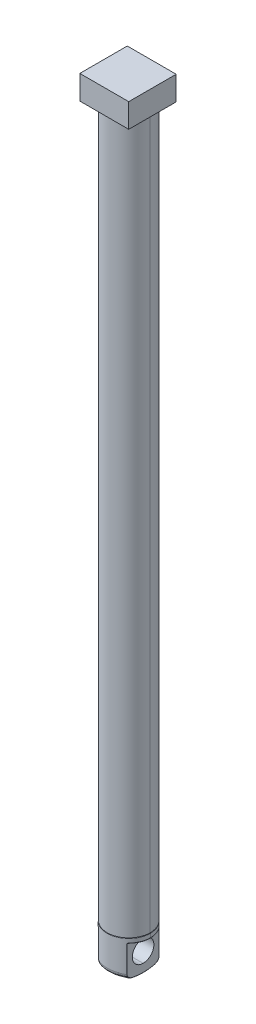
ISO-10303-21;
HEADER;
FILE_DESCRIPTION(('STEP AP214'),'2;1');
FILE_NAME('part.step','',(''),(''),'','','');
FILE_SCHEMA(('AUTOMOTIVE_DESIGN { 1 0 10303 214 1 1 1 1 }'));
ENDSEC;
DATA;
#1=APPLICATION_CONTEXT('core data for automotive mechanical design processes');
#2=APPLICATION_PROTOCOL_DEFINITION('international standard','automotive_design',2000,#1);
#3=PRODUCT_CONTEXT('',#1,'mechanical');
#4=PRODUCT('Part','Part','',(#3));
#5=PRODUCT_RELATED_PRODUCT_CATEGORY('part','',(#4));
#6=PRODUCT_DEFINITION_FORMATION('','',#4);
#7=PRODUCT_DEFINITION_CONTEXT('part definition',#1,'design');
#8=PRODUCT_DEFINITION('design','',#6,#7);
#9=PRODUCT_DEFINITION_SHAPE('','',#8);
#10=(LENGTH_UNIT() NAMED_UNIT(*) SI_UNIT(.MILLI.,.METRE.));
#11=(NAMED_UNIT(*) PLANE_ANGLE_UNIT() SI_UNIT($,.RADIAN.));
#12=(NAMED_UNIT(*) SI_UNIT($,.STERADIAN.) SOLID_ANGLE_UNIT());
#13=UNCERTAINTY_MEASURE_WITH_UNIT(LENGTH_MEASURE(1.E-05),#10,'distance_accuracy_value','');
#14=(GEOMETRIC_REPRESENTATION_CONTEXT(3) GLOBAL_UNCERTAINTY_ASSIGNED_CONTEXT((#13)) GLOBAL_UNIT_ASSIGNED_CONTEXT((#10,
#11,#12)) REPRESENTATION_CONTEXT('',''));
#15=CARTESIAN_POINT('',(0.,0.,0.));
#16=DIRECTION('',(0.,0.,1.));
#17=DIRECTION('',(1.,0.,0.));
#18=AXIS2_PLACEMENT_3D('',#15,#16,#17);
#19=CARTESIAN_POINT('',(10.00004004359,-1.99999999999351,-11.5));
#20=DIRECTION('',(0.,-1.,0.));
#21=DIRECTION('',(0.,0.,-1.));
#22=AXIS2_PLACEMENT_3D('',#19,#20,#21);
#23=PLANE('',#22);
#24=DIRECTION('',(-2.379553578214E-08,1.871466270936E-10,-1.));
#25=VECTOR('',#24,1.);
#26=CARTESIAN_POINT('',(6.90003865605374,-1.99999999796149,-8.37750313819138));
#27=LINE('',#26,#25);
#28=CARTESIAN_POINT('',(6.90003865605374,-1.99999999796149,-8.37750313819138));
#29=VERTEX_POINT('',#28);
#30=CARTESIAN_POINT('',(6.9000385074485,-1.99999999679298,-14.6224966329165));
#31=VERTEX_POINT('',#30);
#32=EDGE_CURVE('E292',#29,#31,#27,.T.);
#33=ORIENTED_EDGE('',*,*,#32,.F.);
#34=CARTESIAN_POINT('',(10.00004004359,-1.99999999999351,-11.5));
#35=DIRECTION('',(0.,-1.,0.));
#36=DIRECTION('',(-0.704546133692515,0.,0.709658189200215));
#37=AXIS2_PLACEMENT_3D('',#34,#35,#36);
#38=CIRCLE('',#37,4.40000000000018);
#39=EDGE_CURVE('E773',#29,#31,#38,.T.);
#40=ORIENTED_EDGE('',*,*,#39,.T.);
#41=EDGE_LOOP('',(#33,#40));
#42=FACE_BOUND('',#41,.T.);
#43=ADVANCED_FACE('F16',(#42),#23,.T.);
#44=CARTESIAN_POINT('',(14.5000400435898,-5.000000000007,-11.5));
#45=DIRECTION('',(-1.,0.,0.));
#46=DIRECTION('',(0.,1.,0.));
#47=AXIS2_PLACEMENT_3D('',#44,#45,#46);
#48=CYLINDRICAL_SURFACE('',#47,2.24999999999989);
#49=DIRECTION('',(-1.,0.,0.));
#50=VECTOR('',#49,1.);
#51=CARTESIAN_POINT('',(13.0000400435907,-2.74999999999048,-11.5));
#52=LINE('',#51,#50);
#53=CARTESIAN_POINT('',(13.0000400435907,-2.74999999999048,-11.5));
#54=VERTEX_POINT('',#53);
#55=CARTESIAN_POINT('',(7.0000400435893,-2.74999999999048,-11.5));
#56=VERTEX_POINT('',#55);
#57=EDGE_CURVE('E10',#54,#56,#52,.T.);
#58=ORIENTED_EDGE('',*,*,#57,.F.);
#59=CARTESIAN_POINT('',(13.0000400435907,-5.000000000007,-11.5));
#60=DIRECTION('',(1.,0.,0.));
#61=DIRECTION('',(0.,1.,0.));
#62=AXIS2_PLACEMENT_3D('',#59,#60,#61);
#63=CIRCLE('',#62,2.24999999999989);
#64=CARTESIAN_POINT('',(13.0000400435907,-7.25000000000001,-11.5));
#65=VERTEX_POINT('',#64);
#66=EDGE_CURVE('E591',#54,#65,#63,.T.);
#67=ORIENTED_EDGE('',*,*,#66,.T.);
#68=DIRECTION('',(-1.,0.,0.));
#69=VECTOR('',#68,1.);
#70=CARTESIAN_POINT('',(13.0000400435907,-7.25000000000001,-11.5));
#71=LINE('',#70,#69);
#72=CARTESIAN_POINT('',(7.0000400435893,-7.25000000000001,-11.5));
#73=VERTEX_POINT('',#72);
#74=EDGE_CURVE('E30',#65,#73,#71,.T.);
#75=ORIENTED_EDGE('',*,*,#74,.T.);
#76=CARTESIAN_POINT('',(7.0000400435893,-5.000000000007,-11.5));
#77=DIRECTION('',(1.,0.,0.));
#78=DIRECTION('',(0.,1.,0.));
#79=AXIS2_PLACEMENT_3D('',#76,#77,#78);
#80=CIRCLE('',#79,2.24999999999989);
#81=EDGE_CURVE('E251',#56,#73,#80,.T.);
#82=ORIENTED_EDGE('',*,*,#81,.F.);
#83=EDGE_LOOP('',(#58,#67,#75,#82));
#84=FACE_BOUND('',#83,.T.);
#85=ADVANCED_FACE('F971',(#84),#48,.F.);
#86=CARTESIAN_POINT('',(14.5000400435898,-5.000000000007,-11.5));
#87=DIRECTION('',(-1.,0.,0.));
#88=DIRECTION('',(0.,1.,0.));
#89=AXIS2_PLACEMENT_3D('',#86,#87,#88);
#90=CYLINDRICAL_SURFACE('',#89,2.24999999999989);
#91=ORIENTED_EDGE('',*,*,#74,.F.);
#92=CARTESIAN_POINT('',(13.0000400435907,-5.000000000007,-11.5));
#93=DIRECTION('',(1.,0.,0.));
#94=DIRECTION('',(0.,-1.,0.));
#95=AXIS2_PLACEMENT_3D('',#92,#93,#94);
#96=CIRCLE('',#95,2.24999999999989);
#97=EDGE_CURVE('E712',#65,#54,#96,.T.);
#98=ORIENTED_EDGE('',*,*,#97,.T.);
#99=ORIENTED_EDGE('',*,*,#57,.T.);
#100=CARTESIAN_POINT('',(7.0000400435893,-5.000000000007,-11.5));
#101=DIRECTION('',(1.,0.,0.));
#102=DIRECTION('',(0.,-1.,0.));
#103=AXIS2_PLACEMENT_3D('',#100,#101,#102);
#104=CIRCLE('',#103,2.24999999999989);
#105=EDGE_CURVE('E642',#73,#56,#104,.T.);
#106=ORIENTED_EDGE('',*,*,#105,.F.);
#107=EDGE_LOOP('',(#91,#98,#99,#106));
#108=FACE_BOUND('',#107,.T.);
#109=ADVANCED_FACE('F389',(#108),#90,.F.);
#110=CARTESIAN_POINT('',(10.00004004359,-1.99999999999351,-11.5));
#111=DIRECTION('',(0.,-1.,0.));
#112=DIRECTION('',(0.,0.,-1.));
#113=AXIS2_PLACEMENT_3D('',#110,#111,#112);
#114=PLANE('',#113);
#115=DIRECTION('',(2.379553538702E-08,1.871466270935E-10,1.));
#116=VECTOR('',#115,1.);
#117=CARTESIAN_POINT('',(13.1000414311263,-1.99999999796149,-14.6224968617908));
#118=LINE('',#117,#116);
#119=CARTESIAN_POINT('',(13.1000414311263,-1.99999999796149,-14.6224968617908));
#120=VERTEX_POINT('',#119);
#121=CARTESIAN_POINT('',(13.1000415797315,-1.99999999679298,-8.37750336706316));
#122=VERTEX_POINT('',#121);
#123=EDGE_CURVE('E693',#120,#122,#118,.T.);
#124=ORIENTED_EDGE('',*,*,#123,.F.);
#125=CARTESIAN_POINT('',(10.00004004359,-1.99999999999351,-11.5));
#126=DIRECTION('',(0.,-1.,0.));
#127=DIRECTION('',(0.704546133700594,0.,-0.709658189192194));
#128=AXIS2_PLACEMENT_3D('',#125,#126,#127);
#129=CIRCLE('',#128,4.40000000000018);
#130=EDGE_CURVE('E790',#120,#122,#129,.T.);
#131=ORIENTED_EDGE('',*,*,#130,.T.);
#132=EDGE_LOOP('',(#124,#131));
#133=FACE_BOUND('',#132,.T.);
#134=ADVANCED_FACE('F538',(#133),#114,.T.);
#135=CARTESIAN_POINT('',(13.1000400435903,-2.09999999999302,-14.8826396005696));
#136=DIRECTION('',(0.,0.,1.));
#137=DIRECTION('',(0.,1.,0.));
#138=AXIS2_PLACEMENT_3D('',#135,#136,#137);
#139=CYLINDRICAL_SURFACE('',#138,0.100000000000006);
#140=ORIENTED_EDGE('',*,*,#123,.T.);
#141=CARTESIAN_POINT('',(13.000040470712,-2.099987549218,-8.19092269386));
#142=CARTESIAN_POINT('',(13.0000399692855,-2.0959577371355,-8.19091903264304));
#143=CARTESIAN_POINT('',(13.0005274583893,-2.08762570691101,-8.19176969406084));
#144=CARTESIAN_POINT('',(13.0030259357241,-2.07448639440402,-8.19618532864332));
#145=CARTESIAN_POINT('',(13.0074742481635,-2.06131568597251,-8.2039855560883));
#146=CARTESIAN_POINT('',(13.0137298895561,-2.04886170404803,-8.21511883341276));
#147=CARTESIAN_POINT('',(13.0216466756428,-2.03739801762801,-8.2292524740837));
#148=CARTESIAN_POINT('',(13.0310853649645,-2.02712581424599,-8.24636102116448));
#149=CARTESIAN_POINT('',(13.04199926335,-2.01815425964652,-8.26632284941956));
#150=CARTESIAN_POINT('',(13.0543085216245,-2.01067002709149,-8.28922841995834));
#151=CARTESIAN_POINT('',(13.0680462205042,-2.004850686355,-8.31515757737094));
#152=CARTESIAN_POINT('',(13.0831821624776,-2.00099393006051,-8.34429041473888));
#153=CARTESIAN_POINT('',(13.0942844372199,-2.00000008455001,-8.3660640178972));
#154=CARTESIAN_POINT('',(13.1000415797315,-1.99999999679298,-8.37750336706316));
#155=(BOUNDED_CURVE() B_SPLINE_CURVE(3,(#141,#142,#143,#144,#145,#146,#147,#148,#149,#150,#151,
#152,#153,#154),.UNSPECIFIED.,.F.,.F.) B_SPLINE_CURVE_WITH_KNOTS((4,1,1,1,1,1,1,1,1,1,1,4),(0.,
0.09090909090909,0.1818181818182,0.2727272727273,0.3636363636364,0.4545454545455,
0.5454545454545,0.6363636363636,0.7272727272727,0.8181818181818,0.9090909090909,1.),
.UNSPECIFIED.) CURVE() GEOMETRIC_REPRESENTATION_ITEM() RATIONAL_B_SPLINE_CURVE((1.,1.,1.,1.,1.,
1.,1.,1.,1.,1.,1.,1.,1.,1.)) REPRESENTATION_ITEM(''));
#156=CARTESIAN_POINT('',(13.000040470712,-2.099987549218,-8.19092269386));
#157=VERTEX_POINT('',#156);
#158=EDGE_CURVE('E594',#157,#122,#155,.T.);
#159=ORIENTED_EDGE('',*,*,#158,.F.);
#160=DIRECTION('',(-8.43453237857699E-09,-4.417356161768E-08,1.));
#161=VECTOR('',#160,1.);
#162=CARTESIAN_POINT('',(13.0000405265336,-2.09998725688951,-14.8090772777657));
#163=LINE('',#162,#161);
#164=CARTESIAN_POINT('',(13.0000405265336,-2.09998725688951,-14.8090772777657));
#165=VERTEX_POINT('',#164);
#166=EDGE_CURVE('E587',#165,#157,#163,.T.);
#167=ORIENTED_EDGE('',*,*,#166,.F.);
#168=CARTESIAN_POINT('',(13.1000414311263,-1.99999999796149,-14.6224968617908));
#169=CARTESIAN_POINT('',(13.0942844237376,-2.00000007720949,-14.6339360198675));
#170=CARTESIAN_POINT('',(13.0831819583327,-2.000993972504,-14.6557096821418));
#171=CARTESIAN_POINT('',(13.0680464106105,-2.004850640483,-14.6848423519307));
#172=CARTESIAN_POINT('',(13.0543087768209,-2.01066989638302,-14.710770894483));
#173=CARTESIAN_POINT('',(13.041999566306,-2.01815405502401,-14.7336765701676));
#174=CARTESIAN_POINT('',(13.0310857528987,-2.02712544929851,-14.7536382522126));
#175=CARTESIAN_POINT('',(13.0216469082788,-2.037397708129,-14.7707471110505));
#176=CARTESIAN_POINT('',(13.0137300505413,-2.0488614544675,-14.7848805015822));
#177=CARTESIAN_POINT('',(13.0074744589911,-2.06131515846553,-14.7960148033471));
#178=CARTESIAN_POINT('',(13.0030260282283,-2.07448613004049,-14.8038135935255));
#179=CARTESIAN_POINT('',(13.0005275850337,-2.08762461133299,-14.8082311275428));
#180=CARTESIAN_POINT('',(13.0000400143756,-2.09595727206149,-14.809081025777));
#181=CARTESIAN_POINT('',(13.0000405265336,-2.09998725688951,-14.8090772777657));
#182=(BOUNDED_CURVE() B_SPLINE_CURVE(3,(#168,#169,#170,#171,#172,#173,#174,#175,#176,#177,#178,
#179,#180,#181),.UNSPECIFIED.,.F.,.F.) B_SPLINE_CURVE_WITH_KNOTS((4,1,1,1,1,1,1,1,1,1,1,4),(0.,
0.09090909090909,0.1818181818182,0.2727272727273,0.3636363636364,0.4545454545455,
0.5454545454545,0.6363636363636,0.7272727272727,0.8181818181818,0.9090909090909,1.),
.UNSPECIFIED.) CURVE() GEOMETRIC_REPRESENTATION_ITEM() RATIONAL_B_SPLINE_CURVE((1.,1.,1.,1.,1.,
1.,1.,1.,1.,1.,1.,1.,1.,1.)) REPRESENTATION_ITEM(''));
#183=EDGE_CURVE('E628',#120,#165,#182,.T.);
#184=ORIENTED_EDGE('',*,*,#183,.F.);
#185=EDGE_LOOP('',(#140,#159,#167,#184));
#186=FACE_BOUND('',#185,.T.);
#187=ADVANCED_FACE('F1034',(#186),#139,.F.);
#188=CARTESIAN_POINT('',(13.0000400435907,-10.400000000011,-7.00000000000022));
#189=DIRECTION('',(-1.,0.,0.));
#190=DIRECTION('',(0.,0.,1.));
#191=AXIS2_PLACEMENT_3D('',#188,#189,#190);
#192=PLANE('',#191);
#193=ORIENTED_EDGE('',*,*,#66,.F.);
#194=ORIENTED_EDGE('',*,*,#97,.F.);
#195=EDGE_LOOP('',(#193,#194));
#196=FACE_BOUND('',#195,.T.);
#197=ORIENTED_EDGE('',*,*,#166,.T.);
#198=DIRECTION('',(7.72062059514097E-08,1.,-2.18312307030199E-08));
#199=VECTOR('',#198,1.);
#200=CARTESIAN_POINT('',(13.0000400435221,-7.633078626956,-8.19092257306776));
#201=LINE('',#200,#199);
#202=CARTESIAN_POINT('',(13.0000400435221,-7.633078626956,-8.19092257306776));
#203=VERTEX_POINT('',#202);
#204=EDGE_CURVE('E610',#203,#157,#201,.T.);
#205=ORIENTED_EDGE('',*,*,#204,.F.);
#206=CARTESIAN_POINT('',(13.0000400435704,-8.679558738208,-9.35718775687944));
#207=CARTESIAN_POINT('',(13.0000400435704,-8.6632582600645,-9.27879569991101));
#208=CARTESIAN_POINT('',(13.0000400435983,-8.62515705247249,-9.1322070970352));
#209=CARTESIAN_POINT('',(13.0000400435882,-8.55575712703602,-8.94323758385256));
#210=CARTESIAN_POINT('',(13.0000400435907,-8.47680863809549,-8.78094252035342));
#211=CARTESIAN_POINT('',(13.0000400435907,-8.39026908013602,-8.64207827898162));
#212=CARTESIAN_POINT('',(13.0000400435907,-8.29854073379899,-8.52528920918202));
#213=CARTESIAN_POINT('',(13.0000400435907,-8.20352157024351,-8.4287296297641));
#214=CARTESIAN_POINT('',(13.0000400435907,-8.10658937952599,-8.35057865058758));
#215=CARTESIAN_POINT('',(13.0000400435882,-8.00927964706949,-8.28953266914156));
#216=CARTESIAN_POINT('',(13.0000400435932,-7.912496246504,-8.24399344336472));
#217=CARTESIAN_POINT('',(13.0000400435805,-7.81667454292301,-8.21266830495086));
#218=CARTESIAN_POINT('',(13.0000400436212,-7.723014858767,-8.19470255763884));
#219=CARTESIAN_POINT('',(13.0000400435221,-7.66273730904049,-8.19092906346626));
#220=CARTESIAN_POINT('',(13.0000400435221,-7.633078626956,-8.19092257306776));
#221=(BOUNDED_CURVE() B_SPLINE_CURVE(3,(#206,#207,#208,#209,#210,#211,#212,#213,#214,#215,#216,
#217,#218,#219,#220),.UNSPECIFIED.,.F.,.F.) B_SPLINE_CURVE_WITH_KNOTS((4,1,1,1,1,1,1,1,1,1,1,1,
4),(0.,0.08333333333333,0.1666666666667,0.25,0.3333333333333,0.4166666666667,0.5,
0.5833333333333,0.6666666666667,0.75,0.8333333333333,0.9166666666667,1.),
.UNSPECIFIED.) CURVE() GEOMETRIC_REPRESENTATION_ITEM() RATIONAL_B_SPLINE_CURVE((1.,1.,1.,1.,1.,
1.,1.,1.,1.,1.,1.,1.,1.,1.,1.)) REPRESENTATION_ITEM(''));
#222=CARTESIAN_POINT('',(13.0000400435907,-8.67956105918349,-9.35718727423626));
#223=VERTEX_POINT('',#222);
#224=EDGE_CURVE('E661',#223,#203,#221,.T.);
#225=ORIENTED_EDGE('',*,*,#224,.F.);
#226=CARTESIAN_POINT('',(13.0000400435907,1.62500000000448,-11.5));
#227=DIRECTION('',(-1.,0.,0.));
#228=DIRECTION('',(0.,-0.979055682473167,-0.203592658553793));
#229=AXIS2_PLACEMENT_3D('',#226,#227,#228);
#230=CIRCLE('',#229,10.5250000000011);
#231=CARTESIAN_POINT('',(13.0000400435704,-8.679558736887,-13.6428122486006));
#232=VERTEX_POINT('',#231);
#233=EDGE_CURVE('E425',#232,#223,#230,.T.);
#234=ORIENTED_EDGE('',*,*,#233,.F.);
#235=CARTESIAN_POINT('',(13.0000400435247,-7.633078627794,-14.809077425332));
#236=CARTESIAN_POINT('',(13.0000400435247,-7.66273752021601,-14.8090709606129));
#237=CARTESIAN_POINT('',(13.0000400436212,-7.72301558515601,-14.8052975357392));
#238=CARTESIAN_POINT('',(13.0000400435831,-7.816677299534,-14.787331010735));
#239=CARTESIAN_POINT('',(13.0000400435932,-7.91249937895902,-14.7560052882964));
#240=CARTESIAN_POINT('',(13.0000400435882,-8.00928237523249,-14.7104658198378));
#241=CARTESIAN_POINT('',(13.0000400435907,-8.10659228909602,-14.6494192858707));
#242=CARTESIAN_POINT('',(13.0000400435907,-8.20352435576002,-14.5712678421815));
#243=CARTESIAN_POINT('',(13.0000400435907,-8.2985429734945,-14.4747082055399));
#244=CARTESIAN_POINT('',(13.0000400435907,-8.39027126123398,-14.3579186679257));
#245=CARTESIAN_POINT('',(13.0000400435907,-8.47681055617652,-14.2190538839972));
#246=CARTESIAN_POINT('',(13.0000400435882,-8.55575895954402,-14.0567584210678));
#247=CARTESIAN_POINT('',(13.0000400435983,-8.62515869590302,-13.8677872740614));
#248=CARTESIAN_POINT('',(13.0000400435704,-8.66325879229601,-13.7212019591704));
#249=CARTESIAN_POINT('',(13.0000400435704,-8.679558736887,-13.6428122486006));
#250=(BOUNDED_CURVE() B_SPLINE_CURVE(3,(#235,#236,#237,#238,#239,#240,#241,#242,#243,#244,#245,
#246,#247,#248,#249),.UNSPECIFIED.,.F.,.F.) B_SPLINE_CURVE_WITH_KNOTS((4,1,1,1,1,1,1,1,1,1,1,1,
4),(0.,0.08333333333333,0.1666666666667,0.25,0.3333333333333,0.4166666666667,0.5,
0.5833333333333,0.6666666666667,0.75,0.8333333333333,0.9166666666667,1.),
.UNSPECIFIED.) CURVE() GEOMETRIC_REPRESENTATION_ITEM() RATIONAL_B_SPLINE_CURVE((1.,1.,1.,1.,1.,
1.,1.,1.,1.,1.,1.,1.,1.,1.,1.)) REPRESENTATION_ITEM(''));
#251=CARTESIAN_POINT('',(13.0000400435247,-7.633078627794,-14.809077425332));
#252=VERTEX_POINT('',#251);
#253=EDGE_CURVE('E432',#252,#232,#250,.T.);
#254=ORIENTED_EDGE('',*,*,#253,.F.);
#255=DIRECTION('',(-8.72945691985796E-08,-1.,-2.66698521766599E-08));
#256=VECTOR('',#255,1.);
#257=CARTESIAN_POINT('',(13.0000405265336,-2.09998725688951,-14.8090772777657));
#258=LINE('',#257,#256);
#259=EDGE_CURVE('E556',#165,#252,#258,.T.);
#260=ORIENTED_EDGE('',*,*,#259,.F.);
#261=EDGE_LOOP('',(#197,#205,#225,#234,#254,#260));
#262=FACE_BOUND('',#261,.T.);
#263=ADVANCED_FACE('F1037',(#196,#262),#192,.F.);
#264=CARTESIAN_POINT('',(12.9000400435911,1.62500000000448,-11.5));
#265=DIRECTION('',(1.,0.,0.));
#266=DIRECTION('',(0.,-0.946533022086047,-0.322606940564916));
#267=AXIS2_PLACEMENT_3D('',#264,#265,#266);
#268=TOROIDAL_SURFACE('',#267,10.5250000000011,0.100000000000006);
#269=CARTESIAN_POINT('',(12.9000400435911,-8.6795610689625,-13.6428126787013));
#270=DIRECTION('',(0.,-0.203592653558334,0.979055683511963));
#271=DIRECTION('',(6.40809112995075E-07,-0.979055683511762,-0.203592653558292));
#272=AXIS2_PLACEMENT_3D('',#269,#270,#271);
#273=CIRCLE('',#272,0.100000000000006);
#274=CARTESIAN_POINT('',(12.9000402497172,-8.77746388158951,-13.6631739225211));
#275=VERTEX_POINT('',#274);
#276=EDGE_CURVE('E429',#275,#232,#273,.T.);
#277=ORIENTED_EDGE('',*,*,#276,.T.);
#278=ORIENTED_EDGE('',*,*,#233,.T.);
#279=CARTESIAN_POINT('',(12.9000400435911,-8.67955620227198,-9.3571881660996));
#280=DIRECTION('',(0.,0.203588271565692,0.979056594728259));
#281=DIRECTION('',(0.,-0.979056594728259,0.203588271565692));
#282=AXIS2_PLACEMENT_3D('',#279,#280,#281);
#283=CIRCLE('',#282,0.100000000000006);
#284=CARTESIAN_POINT('',(12.9000400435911,-8.777465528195,-9.33682272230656));
#285=VERTEX_POINT('',#284);
#286=EDGE_CURVE('E667',#285,#223,#283,.T.);
#287=ORIENTED_EDGE('',*,*,#286,.F.);
#288=CARTESIAN_POINT('',(12.9000400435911,1.62500000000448,-11.5));
#289=DIRECTION('',(-1.,0.,0.));
#290=DIRECTION('',(0.,-0.97905557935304,-0.203593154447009));
#291=AXIS2_PLACEMENT_3D('',#288,#289,#290);
#292=CIRCLE('',#291,10.6250000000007);
#293=EDGE_CURVE('E417',#275,#285,#292,.T.);
#294=ORIENTED_EDGE('',*,*,#293,.F.);
#295=EDGE_LOOP('',(#277,#278,#287,#294));
#296=FACE_BOUND('',#295,.T.);
#297=ADVANCED_FACE('F512',(#296),#268,.T.);
#298=CARTESIAN_POINT('',(5.50004004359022,1.62500000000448,-11.5));
#299=DIRECTION('',(1.,0.,0.));
#300=DIRECTION('',(0.,1.,0.));
#301=AXIS2_PLACEMENT_3D('',#298,#299,#300);
#302=CYLINDRICAL_SURFACE('',#301,10.6250000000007);
#303=CARTESIAN_POINT('',(7.10004036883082,-8.77746510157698,-9.33683167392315));
#304=CARTESIAN_POINT('',(7.159489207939,-8.75726975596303,-9.23971554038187));
#305=CARTESIAN_POINT('',(7.285482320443,-8.715577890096,-9.05278206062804));
#306=CARTESIAN_POINT('',(7.49666727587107,-8.65027558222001,-8.79234428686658));
#307=CARTESIAN_POINT('',(7.72606668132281,-8.58493347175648,-8.55621851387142));
#308=CARTESIAN_POINT('',(7.97045162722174,-8.52183673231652,-8.34620886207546));
#309=CARTESIAN_POINT('',(8.22630224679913,-8.4631261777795,-8.1637147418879));
#310=CARTESIAN_POINT('',(8.49044694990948,-8.4105242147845,-8.00912127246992));
#311=CARTESIAN_POINT('',(8.76017490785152,-8.36533388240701,-7.88217543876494));
#312=CARTESIAN_POINT('',(9.03341600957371,-8.328460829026,-7.78219627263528));
#313=CARTESIAN_POINT('',(9.30862113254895,-8.30045832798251,-7.70825986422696));
#314=CARTESIAN_POINT('',(9.58487541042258,-8.28166746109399,-7.65955293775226));
#315=CARTESIAN_POINT('',(9.86158150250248,-8.27223075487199,-7.63535679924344));
#316=CARTESIAN_POINT('',(10.1384162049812,-8.272231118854,-7.63535775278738));
#317=CARTESIAN_POINT('',(10.4151260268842,-8.28166205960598,-7.65953902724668));
#318=CARTESIAN_POINT('',(10.6913845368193,-8.30045281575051,-7.70824545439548));
#319=CARTESIAN_POINT('',(10.9665919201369,-8.32845224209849,-7.7821733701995));
#320=CARTESIAN_POINT('',(11.2398370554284,-8.365322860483,-7.8821450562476));
#321=CARTESIAN_POINT('',(11.509562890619,-8.41051214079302,-8.00908666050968));
#322=CARTESIAN_POINT('',(11.7737133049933,-8.46311174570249,-8.16367125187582));
#323=CARTESIAN_POINT('',(12.0295613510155,-8.521820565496,-8.34615709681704));
#324=CARTESIAN_POINT('',(12.2739455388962,-8.5849150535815,-8.55615484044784));
#325=CARTESIAN_POINT('',(12.5033550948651,-8.65025850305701,-8.79227936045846));
#326=CARTESIAN_POINT('',(12.7145536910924,-8.71556364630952,-9.05272166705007));
#327=CARTESIAN_POINT('',(12.8405800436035,-8.75726467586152,-9.23968945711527));
#328=CARTESIAN_POINT('',(12.9000402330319,-8.77746387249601,-9.33682610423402));
#329=(BOUNDED_CURVE() B_SPLINE_CURVE(3,(#303,#304,#305,#306,#307,#308,#309,#310,#311,#312,#313,
#314,#315,#316,#317,#318,#319,#320,#321,#322,#323,#324,#325,#326,#327,#328),.UNSPECIFIED.,.F.,
.F.) B_SPLINE_CURVE_WITH_KNOTS((4,1,1,1,1,1,1,1,1,1,1,1,1,1,1,1,1,1,1,1,1,1,1,4),(0.,
0.04347826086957,0.08695652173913,0.1304347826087,0.1739130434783,0.2173913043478,
0.2608695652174,0.304347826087,0.3478260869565,0.3913043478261,0.4347826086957,0.4782608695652,
0.5217391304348,0.5652173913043,0.6086956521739,0.6521739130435,0.695652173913,0.7391304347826,
0.7826086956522,0.8260869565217,0.8695652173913,0.9130434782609,0.9565217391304,1.),
.UNSPECIFIED.) CURVE() GEOMETRIC_REPRESENTATION_ITEM() RATIONAL_B_SPLINE_CURVE((1.,1.,1.,1.,1.,
1.,1.,1.,1.,1.,1.,1.,1.,1.,1.,1.,1.,1.,1.,1.,1.,1.,1.,1.,1.,1.)) REPRESENTATION_ITEM(''));
#330=CARTESIAN_POINT('',(7.10004036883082,-8.77746510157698,-9.33683167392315));
#331=VERTEX_POINT('',#330);
#332=EDGE_CURVE('E875',#331,#285,#329,.T.);
#333=ORIENTED_EDGE('',*,*,#332,.F.);
#334=CARTESIAN_POINT('',(7.1000400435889,1.62500000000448,-11.5));
#335=DIRECTION('',(1.,0.,0.));
#336=DIRECTION('',(0.,-0.979055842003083,0.203591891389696));
#337=AXIS2_PLACEMENT_3D('',#334,#335,#336);
#338=CIRCLE('',#337,10.6250000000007);
#339=CARTESIAN_POINT('',(7.1000400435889,-8.77746832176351,-13.6631638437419));
#340=VERTEX_POINT('',#339);
#341=EDGE_CURVE('E426',#331,#340,#338,.T.);
#342=ORIENTED_EDGE('',*,*,#341,.T.);
#343=CARTESIAN_POINT('',(12.9000402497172,-8.77746388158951,-13.6631739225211));
#344=CARTESIAN_POINT('',(12.8405800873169,-8.75726469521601,-13.7603105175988));
#345=CARTESIAN_POINT('',(12.7145537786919,-8.71556367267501,-13.9472781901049));
#346=CARTESIAN_POINT('',(12.5033552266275,-8.650258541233,-14.2077205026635));
#347=CARTESIAN_POINT('',(12.2739456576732,-8.58491508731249,-14.4438450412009));
#348=CARTESIAN_POINT('',(12.0295614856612,-8.521820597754,-14.6538428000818));
#349=CARTESIAN_POINT('',(11.7737134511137,-8.463111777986,-14.8363286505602));
#350=CARTESIAN_POINT('',(11.5095630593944,-8.41051217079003,-14.9909132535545));
#351=CARTESIAN_POINT('',(11.2398372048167,-8.3653228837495,-15.1178548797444));
#352=CARTESIAN_POINT('',(10.9665920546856,-8.32845225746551,-15.2178265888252));
#353=CARTESIAN_POINT('',(10.6913846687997,-8.30045282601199,-15.2917545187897));
#354=CARTESIAN_POINT('',(10.4151261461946,-8.28166206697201,-15.3404609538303));
#355=CARTESIAN_POINT('',(10.1384163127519,-8.27223111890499,-15.3646422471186));
#356=CARTESIAN_POINT('',(9.86158160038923,-8.2722307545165,-15.3646432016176));
#357=CARTESIAN_POINT('',(9.58487549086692,-8.2816674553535,-15.3404470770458));
#358=CARTESIAN_POINT('',(9.30862118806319,-8.30045832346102,-15.2917401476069));
#359=CARTESIAN_POINT('',(9.03341603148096,-8.32846082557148,-15.2178037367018));
#360=CARTESIAN_POINT('',(8.76017489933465,-8.3653338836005,-15.1178245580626));
#361=CARTESIAN_POINT('',(8.49044690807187,-8.41052422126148,-14.9908787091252));
#362=CARTESIAN_POINT('',(8.22630218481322,-8.463126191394,-14.8362852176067));
#363=CARTESIAN_POINT('',(7.97045154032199,-8.52183675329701,-14.6537910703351));
#364=CARTESIAN_POINT('',(7.72606661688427,-8.58493348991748,-14.4437814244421));
#365=CARTESIAN_POINT('',(7.49666723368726,-8.65027559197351,-14.2076556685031));
#366=CARTESIAN_POINT('',(7.28548232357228,-8.71557790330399,-13.9472179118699));
#367=CARTESIAN_POINT('',(7.15948917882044,-8.75726973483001,-13.7602844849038));
#368=CARTESIAN_POINT('',(7.10004034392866,-8.77746507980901,-13.6631683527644));
#369=(BOUNDED_CURVE() B_SPLINE_CURVE(3,(#343,#344,#345,#346,#347,#348,#349,#350,#351,#352,#353,
#354,#355,#356,#357,#358,#359,#360,#361,#362,#363,#364,#365,#366,#367,#368),.UNSPECIFIED.,.F.,
.F.) B_SPLINE_CURVE_WITH_KNOTS((4,1,1,1,1,1,1,1,1,1,1,1,1,1,1,1,1,1,1,1,1,1,1,4),(0.,
0.04347826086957,0.08695652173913,0.1304347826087,0.1739130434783,0.2173913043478,
0.2608695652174,0.304347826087,0.3478260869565,0.3913043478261,0.4347826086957,0.4782608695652,
0.5217391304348,0.5652173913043,0.6086956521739,0.6521739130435,0.695652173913,0.7391304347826,
0.7826086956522,0.8260869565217,0.8695652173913,0.9130434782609,0.9565217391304,1.),
.UNSPECIFIED.) CURVE() GEOMETRIC_REPRESENTATION_ITEM() RATIONAL_B_SPLINE_CURVE((1.,1.,1.,1.,1.,
1.,1.,1.,1.,1.,1.,1.,1.,1.,1.,1.,1.,1.,1.,1.,1.,1.,1.,1.,1.,1.)) REPRESENTATION_ITEM(''));
#370=EDGE_CURVE('E273',#275,#340,#369,.T.);
#371=ORIENTED_EDGE('',*,*,#370,.F.);
#372=ORIENTED_EDGE('',*,*,#293,.T.);
#373=EDGE_LOOP('',(#333,#342,#371,#372));
#374=FACE_BOUND('',#373,.T.);
#375=ADVANCED_FACE('F504',(#374),#302,.T.);
#376=CARTESIAN_POINT('',(7.1000400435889,1.62500000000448,-11.5));
#377=DIRECTION('',(1.,0.,0.));
#378=DIRECTION('',(0.,-0.946533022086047,0.322606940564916));
#379=AXIS2_PLACEMENT_3D('',#376,#377,#378);
#380=TOROIDAL_SURFACE('',#379,10.5250000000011,0.100000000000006);
#381=CARTESIAN_POINT('',(7.1000400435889,-8.67956085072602,-9.3571862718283));
#382=DIRECTION('',(0.,-0.203592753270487,-0.979055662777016));
#383=DIRECTION('',(9.12595917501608E-07,-0.979055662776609,0.203592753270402));
#384=AXIS2_PLACEMENT_3D('',#381,#382,#383);
#385=CIRCLE('',#384,0.100000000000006);
#386=CARTESIAN_POINT('',(7.00004004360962,-8.67955860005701,-9.35718681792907));
#387=VERTEX_POINT('',#386);
#388=EDGE_CURVE('E248',#331,#387,#385,.T.);
#389=ORIENTED_EDGE('',*,*,#388,.T.);
#390=CARTESIAN_POINT('',(7.0000400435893,1.62500000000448,-11.5));
#391=DIRECTION('',(1.,0.,0.));
#392=DIRECTION('',(0.,-0.979055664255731,0.203592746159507));
#393=AXIS2_PLACEMENT_3D('',#390,#391,#392);
#394=CIRCLE('',#393,10.5250000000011);
#395=CARTESIAN_POINT('',(7.0000400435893,-8.67956086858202,-13.642813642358));
#396=VERTEX_POINT('',#395);
#397=EDGE_CURVE('E241',#387,#396,#394,.T.);
#398=ORIENTED_EDGE('',*,*,#397,.T.);
#399=CARTESIAN_POINT('',(7.1000400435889,-8.67955613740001,-13.6428126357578));
#400=DIRECTION('',(0.,0.203596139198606,-0.979054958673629));
#401=DIRECTION('',(0.,-0.979054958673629,-0.203596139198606));
#402=AXIS2_PLACEMENT_3D('',#399,#400,#401);
#403=CIRCLE('',#402,0.100000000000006);
#404=EDGE_CURVE('E245',#340,#396,#403,.T.);
#405=ORIENTED_EDGE('',*,*,#404,.F.);
#406=ORIENTED_EDGE('',*,*,#341,.F.);
#407=EDGE_LOOP('',(#389,#398,#405,#406));
#408=FACE_BOUND('',#407,.T.);
#409=ADVANCED_FACE('F243',(#408),#380,.T.);
#410=CARTESIAN_POINT('',(7.0000400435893,-10.400000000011,-15.9999999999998));
#411=DIRECTION('',(1.,0.,0.));
#412=DIRECTION('',(0.,1.,0.));
#413=AXIS2_PLACEMENT_3D('',#410,#411,#412);
#414=PLANE('',#413);
#415=ORIENTED_EDGE('',*,*,#81,.T.);
#416=ORIENTED_EDGE('',*,*,#105,.T.);
#417=EDGE_LOOP('',(#415,#416));
#418=FACE_BOUND('',#417,.T.);
#419=DIRECTION('',(8.43453227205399E-09,-4.417356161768E-08,-1.));
#420=VECTOR('',#419,1.);
#421=CARTESIAN_POINT('',(7.0000395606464,-2.09998725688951,-8.19092272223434));
#422=LINE('',#421,#420);
#423=CARTESIAN_POINT('',(7.0000395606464,-2.09998725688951,-8.19092272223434));
#424=VERTEX_POINT('',#423);
#425=CARTESIAN_POINT('',(7.00003961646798,-2.099987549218,-14.80907730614));
#426=VERTEX_POINT('',#425);
#427=EDGE_CURVE('E205',#424,#426,#422,.T.);
#428=ORIENTED_EDGE('',*,*,#427,.T.);
#429=DIRECTION('',(-7.72060859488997E-08,1.,2.65063840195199E-08));
#430=VECTOR('',#429,1.);
#431=CARTESIAN_POINT('',(7.00004004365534,-7.63307912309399,-14.8090774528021));
#432=LINE('',#431,#430);
#433=CARTESIAN_POINT('',(7.00004004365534,-7.63307912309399,-14.8090774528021));
#434=VERTEX_POINT('',#433);
#435=EDGE_CURVE('E257',#434,#426,#432,.T.);
#436=ORIENTED_EDGE('',*,*,#435,.F.);
#437=CARTESIAN_POINT('',(7.00004004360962,-8.6795586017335,-13.6428131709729));
#438=CARTESIAN_POINT('',(7.00004004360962,-8.66325688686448,-13.721208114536));
#439=CARTESIAN_POINT('',(7.00004004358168,-8.62515313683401,-13.8678004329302));
#440=CARTESIAN_POINT('',(7.00004004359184,-8.55575390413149,-14.0567688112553));
#441=CARTESIAN_POINT('',(7.0000400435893,-8.476807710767,-14.2190601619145));
#442=CARTESIAN_POINT('',(7.0000400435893,-8.39026994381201,-14.3579207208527));
#443=CARTESIAN_POINT('',(7.0000400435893,-8.29854107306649,-14.4747107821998));
#444=CARTESIAN_POINT('',(7.0000400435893,-8.20352003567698,-14.5712722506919));
#445=CARTESIAN_POINT('',(7.0000400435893,-8.10658866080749,-14.6494224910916));
#446=CARTESIAN_POINT('',(7.00004004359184,-8.0092799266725,-14.7104678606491));
#447=CARTESIAN_POINT('',(7.00004004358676,-7.9124970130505,-14.7560067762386));
#448=CARTESIAN_POINT('',(7.00004004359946,-7.81667540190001,-14.7873318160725));
#449=CARTESIAN_POINT('',(7.00004004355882,-7.723015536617,-14.8052975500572));
#450=CARTESIAN_POINT('',(7.00004004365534,-7.66273787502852,-14.8090709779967));
#451=CARTESIAN_POINT('',(7.00004004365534,-7.63307912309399,-14.8090774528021));
#452=(BOUNDED_CURVE() B_SPLINE_CURVE(3,(#437,#438,#439,#440,#441,#442,#443,#444,#445,#446,#447,
#448,#449,#450,#451),.UNSPECIFIED.,.F.,.F.) B_SPLINE_CURVE_WITH_KNOTS((4,1,1,1,1,1,1,1,1,1,1,1,
4),(0.,0.08333333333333,0.1666666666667,0.25,0.3333333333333,0.4166666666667,0.5,
0.5833333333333,0.6666666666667,0.75,0.8333333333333,0.9166666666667,1.),
.UNSPECIFIED.) CURVE() GEOMETRIC_REPRESENTATION_ITEM() RATIONAL_B_SPLINE_CURVE((1.,1.,1.,1.,1.,
1.,1.,1.,1.,1.,1.,1.,1.,1.,1.)) REPRESENTATION_ITEM(''));
#453=EDGE_CURVE('E254',#396,#434,#452,.T.);
#454=ORIENTED_EDGE('',*,*,#453,.F.);
#455=ORIENTED_EDGE('',*,*,#397,.F.);
#456=CARTESIAN_POINT('',(7.00004004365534,-7.63307912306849,-8.19092254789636));
#457=CARTESIAN_POINT('',(7.00004004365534,-7.662738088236,-8.19092899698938));
#458=CARTESIAN_POINT('',(7.00004004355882,-7.72301627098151,-8.19470235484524));
#459=CARTESIAN_POINT('',(7.00004004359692,-7.816678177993,-8.2126688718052));
#460=CARTESIAN_POINT('',(7.00004004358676,-7.91250017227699,-8.24399450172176));
#461=CARTESIAN_POINT('',(7.00004004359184,-8.00928268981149,-8.28953366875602));
#462=CARTESIAN_POINT('',(7.0000400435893,-8.106591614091,-8.35057960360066));
#463=CARTESIAN_POINT('',(7.0000400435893,-8.2035228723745,-8.42873032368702));
#464=CARTESIAN_POINT('',(7.0000400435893,-8.29854336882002,-8.52529186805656));
#465=CARTESIAN_POINT('',(7.0000400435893,-8.3902721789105,-8.64208241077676));
#466=CARTESIAN_POINT('',(7.0000400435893,-8.476809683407,-8.78094353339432));
#467=CARTESIAN_POINT('',(7.00004004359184,-8.555755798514,-8.94323533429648));
#468=CARTESIAN_POINT('',(7.00004004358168,-8.62515483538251,-9.13220536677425));
#469=CARTESIAN_POINT('',(7.00004004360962,-8.6632574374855,-9.27879429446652));
#470=CARTESIAN_POINT('',(7.00004004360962,-8.67955860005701,-9.35718681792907));
#471=(BOUNDED_CURVE() B_SPLINE_CURVE(3,(#456,#457,#458,#459,#460,#461,#462,#463,#464,#465,#466,
#467,#468,#469,#470),.UNSPECIFIED.,.F.,.F.) B_SPLINE_CURVE_WITH_KNOTS((4,1,1,1,1,1,1,1,1,1,1,1,
4),(0.,0.08333333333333,0.1666666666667,0.25,0.3333333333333,0.4166666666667,0.5,
0.5833333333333,0.6666666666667,0.75,0.8333333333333,0.9166666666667,1.),
.UNSPECIFIED.) CURVE() GEOMETRIC_REPRESENTATION_ITEM() RATIONAL_B_SPLINE_CURVE((1.,1.,1.,1.,1.,
1.,1.,1.,1.,1.,1.,1.,1.,1.,1.)) REPRESENTATION_ITEM(''));
#472=CARTESIAN_POINT('',(7.00004004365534,-7.63307912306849,-8.19092254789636));
#473=VERTEX_POINT('',#472);
#474=EDGE_CURVE('E757',#473,#387,#471,.T.);
#475=ORIENTED_EDGE('',*,*,#474,.F.);
#476=DIRECTION('',(8.72944448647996E-08,-1.,3.15079711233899E-08));
#477=VECTOR('',#476,1.);
#478=CARTESIAN_POINT('',(7.0000395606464,-2.09998725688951,-8.19092272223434));
#479=LINE('',#478,#477);
#480=EDGE_CURVE('E316',#424,#473,#479,.T.);
#481=ORIENTED_EDGE('',*,*,#480,.F.);
#482=EDGE_LOOP('',(#428,#436,#454,#455,#475,#481));
#483=FACE_BOUND('',#482,.T.);
#484=ADVANCED_FACE('F255',(#418,#483),#414,.F.);
#485=CARTESIAN_POINT('',(6.9000400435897,-2.09999999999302,-8.1162862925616));
#486=DIRECTION('',(0.,0.,-1.));
#487=DIRECTION('',(0.,1.,0.));
#488=AXIS2_PLACEMENT_3D('',#485,#486,#487);
#489=CYLINDRICAL_SURFACE('',#488,0.100000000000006);
#490=ORIENTED_EDGE('',*,*,#32,.T.);
#491=CARTESIAN_POINT('',(7.00003961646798,-2.099987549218,-14.80907730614));
#492=CARTESIAN_POINT('',(7.00004011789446,-2.0959577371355,-14.809080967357));
#493=CARTESIAN_POINT('',(6.9995526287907,-2.08762570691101,-14.8082303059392));
#494=CARTESIAN_POINT('',(6.99705415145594,-2.07448639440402,-14.8038146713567));
#495=CARTESIAN_POINT('',(6.99260583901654,-2.06131568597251,-14.7960144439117));
#496=CARTESIAN_POINT('',(6.98635019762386,-2.04886170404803,-14.7848811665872));
#497=CARTESIAN_POINT('',(6.97843341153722,-2.03739801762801,-14.7707475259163));
#498=CARTESIAN_POINT('',(6.9689947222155,-2.02712581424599,-14.7536389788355));
#499=CARTESIAN_POINT('',(6.95808082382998,-2.01815425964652,-14.7336771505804));
#500=CARTESIAN_POINT('',(6.94577156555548,-2.01067002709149,-14.7107715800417));
#501=CARTESIAN_POINT('',(6.93203386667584,-2.004850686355,-14.6848424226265));
#502=CARTESIAN_POINT('',(6.91689792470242,-2.00099393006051,-14.6557095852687));
#503=CARTESIAN_POINT('',(6.9057956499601,-2.00000008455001,-14.6339359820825));
#504=CARTESIAN_POINT('',(6.9000385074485,-1.99999999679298,-14.6224966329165));
#505=(BOUNDED_CURVE() B_SPLINE_CURVE(3,(#491,#492,#493,#494,#495,#496,#497,#498,#499,#500,#501,
#502,#503,#504),.UNSPECIFIED.,.F.,.F.) B_SPLINE_CURVE_WITH_KNOTS((4,1,1,1,1,1,1,1,1,1,1,4),(0.,
0.09090909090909,0.1818181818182,0.2727272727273,0.3636363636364,0.4545454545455,
0.5454545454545,0.6363636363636,0.7272727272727,0.8181818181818,0.9090909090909,1.),
.UNSPECIFIED.) CURVE() GEOMETRIC_REPRESENTATION_ITEM() RATIONAL_B_SPLINE_CURVE((1.,1.,1.,1.,1.,
1.,1.,1.,1.,1.,1.,1.,1.,1.)) REPRESENTATION_ITEM(''));
#506=EDGE_CURVE('E295',#426,#31,#505,.T.);
#507=ORIENTED_EDGE('',*,*,#506,.F.);
#508=ORIENTED_EDGE('',*,*,#427,.F.);
#509=CARTESIAN_POINT('',(6.90003865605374,-1.99999999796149,-8.37750313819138));
#510=CARTESIAN_POINT('',(6.90579566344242,-2.00000007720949,-8.3660639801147));
#511=CARTESIAN_POINT('',(6.9168981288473,-2.000993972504,-8.34429031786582));
#512=CARTESIAN_POINT('',(6.93203367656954,-2.004850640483,-8.31515764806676));
#513=CARTESIAN_POINT('',(6.94577131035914,-2.01066989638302,-8.28922910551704));
#514=CARTESIAN_POINT('',(6.95808052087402,-2.01815405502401,-8.26632342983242));
#515=CARTESIAN_POINT('',(6.9689943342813,-2.02712544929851,-8.24636174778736));
#516=CARTESIAN_POINT('',(6.97843317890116,-2.037397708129,-8.22925288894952));
#517=CARTESIAN_POINT('',(6.98635003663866,-2.0488614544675,-8.21511949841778));
#518=CARTESIAN_POINT('',(6.99260562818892,-2.06131515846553,-8.2039851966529));
#519=CARTESIAN_POINT('',(6.99705405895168,-2.07448613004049,-8.19618640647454));
#520=CARTESIAN_POINT('',(6.9995525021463,-2.08762461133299,-8.1917688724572));
#521=CARTESIAN_POINT('',(7.00004007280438,-2.09595727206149,-8.19091897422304));
#522=CARTESIAN_POINT('',(7.0000395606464,-2.09998725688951,-8.19092272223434));
#523=(BOUNDED_CURVE() B_SPLINE_CURVE(3,(#509,#510,#511,#512,#513,#514,#515,#516,#517,#518,#519,
#520,#521,#522),.UNSPECIFIED.,.F.,.F.) B_SPLINE_CURVE_WITH_KNOTS((4,1,1,1,1,1,1,1,1,1,1,4),(0.,
0.09090909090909,0.1818181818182,0.2727272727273,0.3636363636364,0.4545454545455,
0.5454545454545,0.6363636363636,0.7272727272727,0.8181818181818,0.9090909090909,1.),
.UNSPECIFIED.) CURVE() GEOMETRIC_REPRESENTATION_ITEM() RATIONAL_B_SPLINE_CURVE((1.,1.,1.,1.,1.,
1.,1.,1.,1.,1.,1.,1.,1.,1.)) REPRESENTATION_ITEM(''));
#524=EDGE_CURVE('E327',#29,#424,#523,.T.);
#525=ORIENTED_EDGE('',*,*,#524,.F.);
#526=EDGE_LOOP('',(#490,#507,#508,#525));
#527=FACE_BOUND('',#526,.T.);
#528=ADVANCED_FACE('F523',(#527),#489,.F.);
#529=CARTESIAN_POINT('',(7.12118788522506,-2.11653097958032,-14.9062995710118));
#530=CARTESIAN_POINT('',(7.1219234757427,-2.10587913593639,-14.9067713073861));
#531=CARTESIAN_POINT('',(7.12203354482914,-2.07111310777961,-14.9068805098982));
#532=CARTESIAN_POINT('',(7.10872348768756,-2.01135933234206,-14.8983819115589));
#533=CARTESIAN_POINT('',(7.07242908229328,-1.94927880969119,-14.8748971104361));
#534=CARTESIAN_POINT('',(7.02138604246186,-1.90316686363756,-14.8405958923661));
#535=CARTESIAN_POINT('',(6.96143448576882,-1.87509533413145,-14.7979274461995));
#536=CARTESIAN_POINT('',(6.89665048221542,-1.86543652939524,-14.7481609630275));
#537=CARTESIAN_POINT('',(6.84883478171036,-1.8722931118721,-14.7077370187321));
#538=CARTESIAN_POINT('',(6.82292812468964,-1.88090360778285,-14.6842583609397));
#539=CARTESIAN_POINT('',(6.81730987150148,-1.88302557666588,-14.6790835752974));
#540=CARTESIAN_POINT('',(7.04179229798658,-2.11308357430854,-14.9239632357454));
#541=CARTESIAN_POINT('',(7.0424365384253,-2.10465735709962,-14.9244608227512));
#542=CARTESIAN_POINT('',(7.0425317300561,-2.07710341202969,-14.9245808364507));
#543=CARTESIAN_POINT('',(7.03085040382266,-2.03006331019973,-14.9156141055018));
#544=CARTESIAN_POINT('',(6.99973061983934,-1.9836465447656,-14.8910172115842));
#545=CARTESIAN_POINT('',(6.95769340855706,-1.95277687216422,-14.855460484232));
#546=CARTESIAN_POINT('',(6.91073778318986,-1.93828829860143,-14.8116869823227));
#547=CARTESIAN_POINT('',(6.86291669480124,-1.93937382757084,-14.7610967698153));
#548=CARTESIAN_POINT('',(6.83013127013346,-1.95096916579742,-14.7203363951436));
#549=CARTESIAN_POINT('',(6.81338595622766,-1.96080678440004,-14.6967832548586));
#550=CARTESIAN_POINT('',(6.80980892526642,-1.96312203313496,-14.6915982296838));
#551=CARTESIAN_POINT('',(6.98446024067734,-2.10727584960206,-14.8664677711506));
#552=CARTESIAN_POINT('',(6.98480808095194,-2.10258926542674,-14.8668812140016));
#553=CARTESIAN_POINT('',(6.98485966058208,-2.08727276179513,-14.8669660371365));
#554=CARTESIAN_POINT('',(6.97855631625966,-2.06107107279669,-14.8595230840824));
#555=CARTESIAN_POINT('',(6.96165270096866,-2.03480189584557,-14.8385460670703));
#556=CARTESIAN_POINT('',(6.93855090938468,-2.01668985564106,-14.8070760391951));
#557=CARTESIAN_POINT('',(6.91235570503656,-2.00733412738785,-14.7668995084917));
#558=CARTESIAN_POINT('',(6.8851820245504,-2.00647102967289,-14.7189905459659));
#559=CARTESIAN_POINT('',(6.86609993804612,-2.01188284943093,-14.6793252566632));
#560=CARTESIAN_POINT('',(6.85615626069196,-2.01684573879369,-14.6560145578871));
#561=CARTESIAN_POINT('',(6.85402095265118,-2.01802643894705,-14.6508628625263));
#562=CARTESIAN_POINT('',(7.00233457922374,-2.10449116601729,-14.7871075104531));
#563=CARTESIAN_POINT('',(7.00245571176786,-2.10159183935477,-14.7874048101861));
#564=CARTESIAN_POINT('',(7.0024753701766,-2.09219487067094,-14.787441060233));
#565=CARTESIAN_POINT('',(7.00031424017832,-2.07564056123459,-14.7821013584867));
#566=CARTESIAN_POINT('',(6.99349093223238,-2.0553273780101,-14.766120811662));
#567=CARTESIAN_POINT('',(6.98170232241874,-2.03566288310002,-14.7402916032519));
#568=CARTESIAN_POINT('',(6.9647885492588,-2.01823209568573,-14.7050799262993));
#569=CARTESIAN_POINT('',(6.94280804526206,-2.00453365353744,-14.6608718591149));
#570=CARTESIAN_POINT('',(6.9234003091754,-1.99857137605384,-14.6227181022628));
#571=CARTESIAN_POINT('',(6.91159391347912,-1.99707622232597,-14.5997420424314));
#572=CARTESIAN_POINT('',(6.9089644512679,-1.99684619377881,-14.5946363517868));
#573=(BOUNDED_SURFACE() B_SPLINE_SURFACE(3,3,((#529,#530,#531,#532,#533,#534,#535,#536,#537,
#538,#539),(#540,#541,#542,#543,#544,#545,#546,#547,#548,#549,#550),(#551,#552,#553,#554,#555,
#556,#557,#558,#559,#560,#561),(#562,#563,#564,#565,#566,#567,#568,#569,#570,#571,#572)),
.UNSPECIFIED.,.F.,.F.,.F.) B_SPLINE_SURFACE_WITH_KNOTS((4,4),(4,1,1,1,1,1,1,1,4),(0.,1.),
(0.1302688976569,0.1669311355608,0.2488317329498,0.3406516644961,0.4434993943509,
0.5589206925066,0.6887054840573,0.8348214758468,0.8764290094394),
.UNSPECIFIED.) GEOMETRIC_REPRESENTATION_ITEM() RATIONAL_B_SPLINE_SURFACE(((1.301630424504,
1.301630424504,1.301630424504,1.301630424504,1.301630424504,1.301630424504,1.301630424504,
1.301630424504,1.301630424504,1.301630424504,1.301630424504),(0.8994565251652,0.8994565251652,
0.8994565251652,0.8994565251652,0.8994565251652,0.8994565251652,0.8994565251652,0.8994565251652,
0.8994565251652,0.8994565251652,0.8994565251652),(0.8994565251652,0.8994565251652,
0.8994565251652,0.8994565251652,0.8994565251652,0.8994565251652,0.8994565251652,0.8994565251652,
0.8994565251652,0.8994565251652,0.8994565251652),(1.301630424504,1.301630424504,1.301630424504,
1.301630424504,1.301630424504,1.301630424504,1.301630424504,1.301630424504,1.301630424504,
1.301630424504,1.301630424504))) REPRESENTATION_ITEM('') SURFACE());
#574=CARTESIAN_POINT('',(7.10003663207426,-2.1000013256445,-14.8090757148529));
#575=DIRECTION('',(-3.89007844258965E-05,0.999999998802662,2.96884685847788E-05));
#576=DIRECTION('',(-0.659058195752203,-3.30942270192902E-06,-0.752091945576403));
#577=AXIS2_PLACEMENT_3D('',#574,#575,#576);
#578=CIRCLE('',#577,0.099998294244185);
#579=CARTESIAN_POINT('',(7.03413241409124,-2.09999999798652,-14.884283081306));
#580=VERTEX_POINT('',#579);
#581=EDGE_CURVE('E299',#580,#426,#578,.T.);
#582=CARTESIAN_POINT('',(6.90004004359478,-1.89999999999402,-14.6224989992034));
#583=DIRECTION('',(-0.709658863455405,0.,0.704545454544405));
#584=DIRECTION('',(-0.704545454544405,0.,-0.709658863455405));
#585=AXIS2_PLACEMENT_3D('',#582,#583,#584);
#586=CIRCLE('',#585,0.100000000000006);
#587=CARTESIAN_POINT('',(6.82958543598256,-1.89999999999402,-14.6934649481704));
#588=VERTEX_POINT('',#587);
#589=EDGE_CURVE('E744',#588,#31,#586,.T.);
#590=CARTESIAN_POINT('',(7.03413241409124,-2.09999999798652,-14.884283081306));
#591=CARTESIAN_POINT('',(7.03414067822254,-2.09066454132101,-14.8842959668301));
#592=CARTESIAN_POINT('',(7.03277535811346,-2.07181658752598,-14.88309618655));
#593=CARTESIAN_POINT('',(7.02634844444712,-2.04252482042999,-14.8774554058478));
#594=CARTESIAN_POINT('',(7.01499802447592,-2.0136729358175,-14.8674371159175));
#595=CARTESIAN_POINT('',(6.99875589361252,-1.98595018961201,-14.8529847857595));
#596=CARTESIAN_POINT('',(6.97670759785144,-1.95958409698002,-14.8331427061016));
#597=CARTESIAN_POINT('',(6.94843486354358,-1.93577182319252,-14.8073114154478));
#598=CARTESIAN_POINT('',(6.91383522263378,-1.91625486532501,-14.7750934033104));
#599=CARTESIAN_POINT('',(6.87347184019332,-1.903154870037,-14.7366205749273));
#600=CARTESIAN_POINT('',(6.84462107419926,-1.900000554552,-14.7083904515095));
#601=CARTESIAN_POINT('',(6.82958543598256,-1.89999999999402,-14.6934649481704));
#602=(BOUNDED_CURVE() B_SPLINE_CURVE(3,(#590,#591,#592,#593,#594,#595,#596,#597,#598,#599,#600,
#601),.UNSPECIFIED.,.F.,.F.) B_SPLINE_CURVE_WITH_KNOTS((4,1,1,1,1,1,1,1,1,4),(0.,
0.1111111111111,0.2222222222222,0.3333333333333,0.4444444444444,0.5555555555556,0.6666666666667,
0.7777777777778,0.8888888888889,1.),
.UNSPECIFIED.) CURVE() GEOMETRIC_REPRESENTATION_ITEM() RATIONAL_B_SPLINE_CURVE((1.,1.,1.,1.,1.,
1.,1.,1.,1.,1.,1.,1.)) REPRESENTATION_ITEM(''));
#603=EDGE_CURVE('E349',#580,#588,#602,.T.);
#604=ORIENTED_EDGE('',*,*,#581,.T.);
#605=ORIENTED_EDGE('',*,*,#506,.T.);
#606=ORIENTED_EDGE('',*,*,#589,.F.);
#607=ORIENTED_EDGE('',*,*,#603,.F.);
#608=EDGE_LOOP('',(#604,#605,#606,#607));
#609=FACE_BOUND('',#608,.T.);
#610=ADVANCED_FACE('F526',(#609),#573,.T.);
#611=CARTESIAN_POINT('',(7.1000400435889,-7.66825944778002,-14.8090784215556));
#612=DIRECTION('',(0.,1.,0.));
#613=DIRECTION('',(-0.659090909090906,0.,-0.752063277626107));
#614=AXIS2_PLACEMENT_3D('',#611,#612,#613);
#615=CYLINDRICAL_SURFACE('',#614,0.100000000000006);
#616=CARTESIAN_POINT('',(7.1000400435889,-7.63307911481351,-14.8090784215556));
#617=DIRECTION('',(0.,1.,0.));
#618=DIRECTION('',(-0.659094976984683,0.,-0.752059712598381));
#619=AXIS2_PLACEMENT_3D('',#616,#617,#618);
#620=CIRCLE('',#619,0.100000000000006);
#621=CARTESIAN_POINT('',(7.03413198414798,-7.63306903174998,-14.8842831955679));
#622=VERTEX_POINT('',#621);
#623=EDGE_CURVE('E261',#622,#434,#620,.T.);
#624=ORIENTED_EDGE('',*,*,#623,.T.);
#625=ORIENTED_EDGE('',*,*,#435,.T.);
#626=ORIENTED_EDGE('',*,*,#581,.F.);
#627=DIRECTION('',(7.77044936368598E-08,1.,2.06504587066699E-08));
#628=VECTOR('',#627,1.);
#629=CARTESIAN_POINT('',(7.03413198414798,-7.63306903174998,-14.8842831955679));
#630=LINE('',#629,#628);
#631=EDGE_CURVE('E345',#622,#580,#630,.T.);
#632=ORIENTED_EDGE('',*,*,#631,.F.);
#633=EDGE_LOOP('',(#624,#625,#626,#632));
#634=FACE_BOUND('',#633,.T.);
#635=ADVANCED_FACE('F537',(#634),#615,.T.);
#636=CARTESIAN_POINT('',(7.12176339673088,-8.78204296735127,-13.6282996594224));
#637=CARTESIAN_POINT('',(7.12176339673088,-8.7615543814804,-13.7336037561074));
#638=CARTESIAN_POINT('',(7.12176339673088,-8.71004549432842,-13.9352896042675));
#639=CARTESIAN_POINT('',(7.12176339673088,-8.59624059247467,-14.2116742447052));
#640=CARTESIAN_POINT('',(7.12176339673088,-8.45456782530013,-14.4434659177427));
#641=CARTESIAN_POINT('',(7.12176339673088,-8.29457626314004,-14.6260106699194));
#642=CARTESIAN_POINT('',(7.12176339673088,-8.12347760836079,-14.7611004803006));
#643=CARTESIAN_POINT('',(7.12176339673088,-7.94736001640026,-14.8517246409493));
#644=CARTESIAN_POINT('',(7.12176339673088,-7.77664732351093,-14.8995062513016));
#645=CARTESIAN_POINT('',(7.12176339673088,-7.66471862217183,-14.9076852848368));
#646=CARTESIAN_POINT('',(7.12176339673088,-7.61377984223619,-14.9064512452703));
#647=CARTESIAN_POINT('',(7.04230468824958,-8.79940087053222,-13.6316768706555));
#648=CARTESIAN_POINT('',(7.04230468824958,-8.77878110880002,-13.7376558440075));
#649=CARTESIAN_POINT('',(7.04230468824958,-8.72691575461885,-13.940779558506));
#650=CARTESIAN_POINT('',(7.04230468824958,-8.61212898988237,-14.2196026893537));
#651=CARTESIAN_POINT('',(7.04230468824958,-8.46895513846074,-14.4538945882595));
#652=CARTESIAN_POINT('',(7.04230468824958,-8.30691209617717,-14.6388179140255));
#653=CARTESIAN_POINT('',(7.04230468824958,-8.13320213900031,-14.7760016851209));
#654=CARTESIAN_POINT('',(7.04230468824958,-7.95395508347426,-14.868262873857));
#655=CARTESIAN_POINT('',(7.04230468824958,-7.77980857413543,-14.9170258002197));
#656=CARTESIAN_POINT('',(7.04230468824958,-7.66542913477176,-14.9253909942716));
#657=CARTESIAN_POINT('',(7.04230468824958,-7.6133483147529,-14.9241293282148));
#658=CARTESIAN_POINT('',(6.98474445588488,-8.74289984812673,-13.6206838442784));
#659=CARTESIAN_POINT('',(6.98474445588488,-8.72270707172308,-13.7244660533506));
#660=CARTESIAN_POINT('',(6.98474445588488,-8.67200203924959,-13.9229094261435));
#661=CARTESIAN_POINT('',(6.98474445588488,-8.56041129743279,-14.1937951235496));
#662=CARTESIAN_POINT('',(6.98474445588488,-8.42212356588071,-14.4199486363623));
#663=CARTESIAN_POINT('',(6.98474445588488,-8.26675821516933,-14.5971295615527));
#664=CARTESIAN_POINT('',(6.98474445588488,-8.1015482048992,-14.7274973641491));
#665=CARTESIAN_POINT('',(6.98474445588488,-7.93248774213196,-14.8144299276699));
#666=CARTESIAN_POINT('',(6.98474445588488,-7.76951851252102,-14.8599986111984));
#667=CARTESIAN_POINT('',(6.98474445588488,-7.66311637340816,-14.8677578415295));
#668=CARTESIAN_POINT('',(6.98474445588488,-7.61475296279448,-14.8665861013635));
#669=CARTESIAN_POINT('',(7.00242816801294,-8.6649037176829,-13.6055086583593));
#670=CARTESIAN_POINT('',(7.00242816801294,-8.64530036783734,-13.7062583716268));
#671=CARTESIAN_POINT('',(7.00242816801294,-8.59619708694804,-13.8982408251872));
#672=CARTESIAN_POINT('',(7.00242816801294,-8.48901825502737,-14.1581693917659));
#673=CARTESIAN_POINT('',(7.00242816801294,-8.35747550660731,-14.3730883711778));
#674=CARTESIAN_POINT('',(7.00242816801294,-8.21132829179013,-14.53958139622));
#675=CARTESIAN_POINT('',(7.00242816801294,-8.05785192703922,-14.6605401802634));
#676=CARTESIAN_POINT('',(7.00242816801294,-7.9028534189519,-14.7401169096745));
#677=CARTESIAN_POINT('',(7.00242816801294,-7.75531372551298,-14.7812761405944));
#678=CARTESIAN_POINT('',(7.00242816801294,-7.65992375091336,-14.7881988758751));
#679=CARTESIAN_POINT('',(7.00242816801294,-7.6166919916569,-14.7871512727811));
#680=(BOUNDED_SURFACE() B_SPLINE_SURFACE(3,3,((#636,#637,#638,#639,#640,#641,#642,#643,#644,
#645,#646),(#647,#648,#649,#650,#651,#652,#653,#654,#655,#656,#657),(#658,#659,#660,#661,#662,
#663,#664,#665,#666,#667,#668),(#669,#670,#671,#672,#673,#674,#675,#676,#677,#678,#679)),
.UNSPECIFIED.,.F.,.F.,.F.) B_SPLINE_SURFACE_WITH_KNOTS((4,4),(4,1,1,1,1,1,1,1,4),(0.,1.),
(0.008495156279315,0.1819916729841,0.3432959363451,0.4858977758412,0.6120779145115,
0.723645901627,0.8235353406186,0.9150574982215,0.9916779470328),
.UNSPECIFIED.) GEOMETRIC_REPRESENTATION_ITEM() RATIONAL_B_SPLINE_SURFACE(((1.301564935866,
1.301564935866,1.301564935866,1.301564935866,1.301564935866,1.301564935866,1.301564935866,
1.301564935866,1.301564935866,1.301564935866,1.301564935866),(0.8994783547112,0.8994783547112,
0.8994783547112,0.8994783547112,0.8994783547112,0.8994783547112,0.8994783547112,0.8994783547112,
0.8994783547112,0.8994783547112,0.8994783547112),(0.8994783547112,0.8994783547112,
0.8994783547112,0.8994783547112,0.8994783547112,0.8994783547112,0.8994783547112,0.8994783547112,
0.8994783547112,0.8994783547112,0.8994783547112),(1.301564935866,1.301564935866,1.301564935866,
1.301564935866,1.301564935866,1.301564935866,1.301564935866,1.301564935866,1.301564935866,
1.301564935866,1.301564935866))) REPRESENTATION_ITEM('') SURFACE());
#681=CARTESIAN_POINT('',(7.10004034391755,-8.77746275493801,-13.6631678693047));
#682=CARTESIAN_POINT('',(7.0987613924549,-8.77182984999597,-13.6902545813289));
#683=CARTESIAN_POINT('',(7.097480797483,-8.76575584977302,-13.7172514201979));
#684=CARTESIAN_POINT('',(7.09493696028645,-8.7527762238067,-13.7706386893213));
#685=CARTESIAN_POINT('',(7.09367372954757,-8.74588361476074,-13.7970322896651));
#686=CARTESIAN_POINT('',(7.09116782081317,-8.7312704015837,-13.8491624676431));
#687=CARTESIAN_POINT('',(7.08992511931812,-8.7235638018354,-13.8749029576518));
#688=CARTESIAN_POINT('',(7.08746432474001,-8.70733200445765,-13.9256736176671));
#689=CARTESIAN_POINT('',(7.08624615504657,-8.69882180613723,-13.9507085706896));
#690=CARTESIAN_POINT('',(7.08383846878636,-8.68099816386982,-14.0000145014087));
#691=CARTESIAN_POINT('',(7.0826488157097,-8.6717007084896,-14.0242912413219));
#692=CARTESIAN_POINT('',(7.08030204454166,-8.65232414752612,-14.0720272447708));
#693=CARTESIAN_POINT('',(7.07914472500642,-8.64226198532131,-14.0954933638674));
#694=CARTESIAN_POINT('',(7.07686565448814,-8.62138397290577,-14.1415554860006));
#695=CARTESIAN_POINT('',(7.07574364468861,-8.6105859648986,-14.1641595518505));
#696=CARTESIAN_POINT('',(7.07353802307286,-8.58827024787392,-14.2084465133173));
#697=CARTESIAN_POINT('',(7.0724540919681,-8.57677122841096,-14.2301387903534));
#698=CARTESIAN_POINT('',(7.07045254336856,-8.55453693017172,-14.2699648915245));
#699=CARTESIAN_POINT('',(7.069533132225,-8.54392447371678,-14.2881672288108));
#700=CARTESIAN_POINT('',(7.06772040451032,-8.52216408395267,-14.3238734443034));
#701=CARTESIAN_POINT('',(7.0668269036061,-8.51102668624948,-14.341383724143));
#702=CARTESIAN_POINT('',(7.0650705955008,-8.48824213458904,-14.3756725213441));
#703=CARTESIAN_POINT('',(7.0642075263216,-8.47660584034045,-14.3924582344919));
#704=CARTESIAN_POINT('',(7.06251503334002,-8.45285237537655,-14.4252658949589));
#705=CARTESIAN_POINT('',(7.06168528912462,-8.44074634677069,-14.4412958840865));
#706=CARTESIAN_POINT('',(7.06006160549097,-8.4160856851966,-14.4725616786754));
#707=CARTESIAN_POINT('',(7.05926729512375,-8.4035424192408,-14.4878064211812));
#708=CARTESIAN_POINT('',(7.05771544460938,-8.3780426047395,-14.5174732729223));
#709=CARTESIAN_POINT('',(7.0569574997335,-8.36509758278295,-14.5319052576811));
#710=CARTESIAN_POINT('',(7.05547809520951,-8.33883244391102,-14.5599203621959));
#711=CARTESIAN_POINT('',(7.05475621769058,-8.32552393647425,-14.5735143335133));
#712=CARTESIAN_POINT('',(7.05334734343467,-8.2985723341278,-14.5998299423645));
#713=CARTESIAN_POINT('',(7.05265994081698,-8.28494084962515,-14.6125634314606));
#714=CARTESIAN_POINT('',(7.0513752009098,-8.2585827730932,-14.6360699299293));
#715=CARTESIAN_POINT('',(7.05077605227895,-8.24591385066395,-14.6469075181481));
#716=CARTESIAN_POINT('',(7.04960397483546,-8.22029560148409,-14.6678926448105));
#717=CARTESIAN_POINT('',(7.04903080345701,-8.20735223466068,-14.6780474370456));
#718=CARTESIAN_POINT('',(7.04791360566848,-8.1812151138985,-14.6976493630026));
#719=CARTESIAN_POINT('',(7.04736928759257,-8.16802721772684,-14.7071042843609));
#720=CARTESIAN_POINT('',(7.04631183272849,-8.14143271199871,-14.7252908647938));
#721=CARTESIAN_POINT('',(7.04579836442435,-8.12803181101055,-14.7340308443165));
#722=CARTESIAN_POINT('',(7.04480373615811,-8.10104456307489,-14.750774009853));
#723=CARTESIAN_POINT('',(7.04432221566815,-8.08746372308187,-14.7587860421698));
#724=CARTESIAN_POINT('',(7.04339164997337,-8.06015115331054,-14.7740620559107));
#725=CARTESIAN_POINT('',(7.04294222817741,-8.04642467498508,-14.7813353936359));
#726=CARTESIAN_POINT('',(7.0420749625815,-8.01885643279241,-14.7951250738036));
#727=CARTESIAN_POINT('',(7.04165674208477,-8.00501960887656,-14.8016512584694));
#728=CARTESIAN_POINT('',(7.04085021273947,-7.97726691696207,-14.8139404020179));
#729=CARTESIAN_POINT('',(7.0404615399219,-7.96335562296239,-14.8197136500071));
#730=CARTESIAN_POINT('',(7.03973285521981,-7.93631928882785,-14.830171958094));
#731=CARTESIAN_POINT('',(7.03939137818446,-7.92321327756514,-14.8349061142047));
#732=CARTESIAN_POINT('',(7.03873211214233,-7.8969165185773,-14.8437269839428));
#733=CARTESIAN_POINT('',(7.03841413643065,-7.8837276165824,-14.8478191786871));
#734=CARTESIAN_POINT('',(7.03780471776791,-7.85729549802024,-14.8553504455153));
#735=CARTESIAN_POINT('',(7.03751305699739,-7.84405390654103,-14.8587951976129));
#736=CARTESIAN_POINT('',(7.0369580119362,-7.8175473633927,-14.8650278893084));
#737=CARTESIAN_POINT('',(7.03669438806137,-7.80428379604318,-14.8678216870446));
#738=CARTESIAN_POINT('',(7.03619632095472,-7.77776470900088,-14.8727509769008));
#739=CARTESIAN_POINT('',(7.03596162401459,-7.76451031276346,-14.8748924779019));
#740=CARTESIAN_POINT('',(7.03552135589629,-7.73804116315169,-14.8785179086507));
#741=CARTESIAN_POINT('',(7.03531552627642,-7.72482725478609,-14.8800079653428));
#742=CARTESIAN_POINT('',(7.0349320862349,-7.69847045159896,-14.8823333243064));
#743=CARTESIAN_POINT('',(7.03475422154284,-7.68532811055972,-14.8831748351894));
#744=CARTESIAN_POINT('',(7.03442461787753,-7.65914591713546,-14.88420854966));
#745=CARTESIAN_POINT('',(7.03427264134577,-7.64610631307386,-14.8844069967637));
#746=CARTESIAN_POINT('',(7.03413203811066,-7.63306903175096,-14.8842831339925));
#747=B_SPLINE_CURVE_WITH_KNOTS('',3,(#681,#682,#683,#684,#685,#686,#687,#688,#689,#690,#691,
#692,#693,#694,#695,#696,#697,#698,#699,#700,#701,#702,#703,#704,#705,#706,#707,#708,#709,#710,
#711,#712,#713,#714,#715,#716,#717,#718,#719,#720,#721,#722,#723,#724,#725,#726,#727,#728,#729,
#730,#731,#732,#733,#734,#735,#736,#737,#738,#739,#740,#741,#742,#743,#744,#745,#746),
.UNSPECIFIED.,.F.,.F.,(4,2,2,2,2,2,2,2,2,2,2,2,2,2,2,2,2,2,2,2,2,2,2,2,2,2,2,2,2,2,2,2,4),(0.,
0.083086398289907,0.164994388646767,0.245671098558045,0.325062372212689,0.403113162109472,
0.479768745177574,0.554975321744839,0.628679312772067,0.691934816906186,0.75423293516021,
0.815544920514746,0.875842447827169,0.935098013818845,0.993285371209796,1.05037999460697,
1.10635957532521,1.1563933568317,1.20576253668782,1.25445551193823,1.30246168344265,
1.34977172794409,1.39637786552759,1.44227416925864,1.48745686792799,1.52925967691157,
1.57068346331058,1.61172488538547,1.65238131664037,1.69265103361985,1.7325334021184,
1.77202905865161,1.81114008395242),.UNSPECIFIED.);
#748=EDGE_CURVE('E265',#340,#622,#747,.T.);
#749=ORIENTED_EDGE('',*,*,#748,.F.);
#750=ORIENTED_EDGE('',*,*,#404,.T.);
#751=ORIENTED_EDGE('',*,*,#453,.T.);
#752=ORIENTED_EDGE('',*,*,#623,.F.);
#753=EDGE_LOOP('',(#749,#750,#751,#752));
#754=FACE_BOUND('',#753,.T.);
#755=ADVANCED_FACE('F263',(#754),#680,.T.);
#756=CARTESIAN_POINT('',(13.7662120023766,-7.88030620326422,-13.9582160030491));
#757=CARTESIAN_POINT('',(13.6990201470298,-7.8546058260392,-14.0623695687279));
#758=CARTESIAN_POINT('',(13.5048763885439,-7.78209300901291,-14.3371568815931));
#759=CARTESIAN_POINT('',(13.1398738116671,-7.65617681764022,-14.7449720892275));
#760=CARTESIAN_POINT('',(12.6531166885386,-7.51022797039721,-15.1512420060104));
#761=CARTESIAN_POINT('',(12.1153219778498,-7.37688999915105,-15.4819965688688));
#762=CARTESIAN_POINT('',(11.5402673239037,-7.26726960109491,-15.7318511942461));
#763=CARTESIAN_POINT('',(10.9414900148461,-7.1896684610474,-15.8988145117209));
#764=CARTESIAN_POINT('',(10.330359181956,-7.14904826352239,-15.9833246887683));
#765=CARTESIAN_POINT('',(9.71526988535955,-7.14758358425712,-15.9863371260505));
#766=CARTESIAN_POINT('',(9.10359194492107,-7.1853471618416,-15.907895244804));
#767=CARTESIAN_POINT('',(8.50354982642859,-7.26033673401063,-15.7470799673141));
#768=CARTESIAN_POINT('',(7.9262962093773,-7.36782534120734,-15.5033458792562));
#769=CARTESIAN_POINT('',(7.38525534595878,-7.49975882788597,-15.1784475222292));
#770=CARTESIAN_POINT('',(6.89427598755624,-7.64519059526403,-14.777526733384));
#771=CARTESIAN_POINT('',(6.51435733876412,-7.77507747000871,-14.362143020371));
#772=CARTESIAN_POINT('',(6.30956262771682,-7.85135305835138,-14.0755556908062));
#773=CARTESIAN_POINT('',(6.2338106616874,-7.88032830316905,-13.9581291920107));
#774=CARTESIAN_POINT('',(13.6881660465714,-8.38898151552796,-14.0102930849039));
#775=CARTESIAN_POINT('',(13.6223052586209,-8.36324419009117,-14.1168016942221));
#776=CARTESIAN_POINT('',(13.4319989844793,-8.29061989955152,-14.3978607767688));
#777=CARTESIAN_POINT('',(13.0741902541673,-8.16448143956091,-14.8151790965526));
#778=CARTESIAN_POINT('',(12.5970999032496,-8.01827478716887,-15.2310236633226));
#779=CARTESIAN_POINT('',(12.0701869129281,-7.88474047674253,-15.5695380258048));
#780=CARTESIAN_POINT('',(11.5070666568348,-7.77501422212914,-15.8251544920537));
#781=CARTESIAN_POINT('',(10.9210330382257,-7.69738134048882,-15.9958818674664));
#782=CARTESIAN_POINT('',(10.3231494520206,-7.65676191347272,-16.0822614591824));
#783=CARTESIAN_POINT('',(9.72148646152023,-7.65529750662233,-16.0853400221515));
#784=CARTESIAN_POINT('',(9.12308015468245,-7.69305951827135,-16.0051647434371));
#785=CARTESIAN_POINT('',(8.53582993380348,-7.7680769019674,-15.8407299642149));
#786=CARTESIAN_POINT('',(7.97057989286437,-7.87566480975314,-15.5913841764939));
#787=CARTESIAN_POINT('',(7.44050534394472,-8.00778835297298,-15.2588703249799));
#788=CARTESIAN_POINT('',(6.95928673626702,-8.15347526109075,-14.848499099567));
#789=CARTESIAN_POINT('',(6.58685703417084,-8.28359277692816,-14.4234225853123));
#790=CARTESIAN_POINT('',(6.38610910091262,-8.35998674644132,-14.1302859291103));
#791=CARTESIAN_POINT('',(6.31185774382,-8.38900368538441,-14.0102042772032));
#792=CARTESIAN_POINT('',(13.3493095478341,-8.75119183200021,-13.8635494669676));
#793=CARTESIAN_POINT('',(13.289227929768,-8.72852396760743,-13.964290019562));
#794=CARTESIAN_POINT('',(13.1155830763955,-8.66453820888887,-14.230308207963));
#795=CARTESIAN_POINT('',(12.7890082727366,-8.55331346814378,-14.6258943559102));
#796=CARTESIAN_POINT('',(12.3538886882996,-8.42439270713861,-15.0204144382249));
#797=CARTESIAN_POINT('',(11.874221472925,-8.30676923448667,-15.3414616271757));
#798=CARTESIAN_POINT('',(11.3629174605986,-8.21029173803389,-15.5835808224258));
#799=CARTESIAN_POINT('',(10.8322138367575,-8.14216842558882,-15.7450278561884));
#800=CARTESIAN_POINT('',(10.2918465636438,-8.10657936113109,-15.8266018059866));
#801=CARTESIAN_POINT('',(9.74847731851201,-8.10529707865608,-15.8295075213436));
#802=CARTESIAN_POINT('',(9.20769320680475,-8.1383799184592,-15.7537982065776));
#803=CARTESIAN_POINT('',(8.67598228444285,-8.20419910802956,-15.5983200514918));
#804=CARTESIAN_POINT('',(8.16284884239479,-8.29878230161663,-15.3621681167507));
#805=CARTESIAN_POINT('',(7.68038735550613,-8.41514985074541,-15.0468330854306));
#806=CARTESIAN_POINT('',(7.24154754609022,-8.54360681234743,-14.6574999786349));
#807=CARTESIAN_POINT('',(6.90163302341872,-8.65834443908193,-14.2545186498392));
#808=CARTESIAN_POINT('',(6.71845521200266,-8.72565501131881,-13.9770438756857));
#809=CARTESIAN_POINT('',(6.65071913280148,-8.75121147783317,-13.8634653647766));
#810=CARTESIAN_POINT('',(12.9130256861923,-8.79229368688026,-13.5887391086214));
#811=CARTESIAN_POINT('',(12.8603848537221,-8.7743217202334,-13.6783696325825));
#812=CARTESIAN_POINT('',(12.7081918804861,-8.72355934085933,-13.9152863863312));
#813=CARTESIAN_POINT('',(12.4218313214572,-8.6351935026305,-14.2683834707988));
#814=CARTESIAN_POINT('',(12.0407498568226,-8.53276775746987,-14.6209617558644));
#815=CARTESIAN_POINT('',(11.62191242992,-8.43949072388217,-14.9077367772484));
#816=CARTESIAN_POINT('',(11.1773227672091,-8.36322857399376,-15.1236074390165));
#817=CARTESIAN_POINT('',(10.7178575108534,-8.30957100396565,-15.2672043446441));
#818=CARTESIAN_POINT('',(10.2515435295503,-8.2816164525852,-15.3396146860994));
#819=CARTESIAN_POINT('',(9.78322853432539,-8.28061033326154,-15.342191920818));
#820=CARTESIAN_POINT('',(9.3166340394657,-8.30659250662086,-15.2749946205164));
#821=CARTESIAN_POINT('',(8.85643096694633,-8.3584225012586,-15.1367306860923));
#822=CARTESIAN_POINT('',(8.41039858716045,-8.43316732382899,-14.926216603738));
#823=CARTESIAN_POINT('',(7.98923977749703,-8.52542974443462,-14.6445717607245));
#824=CARTESIAN_POINT('',(7.60496343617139,-8.62747926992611,-14.2966215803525));
#825=CARTESIAN_POINT('',(7.30691279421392,-8.71864205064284,-13.9368700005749));
#826=CARTESIAN_POINT('',(7.14635683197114,-8.77204710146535,-13.6897167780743));
#827=CARTESIAN_POINT('',(7.0870092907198,-8.79230943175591,-13.5886641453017));
#828=(BOUNDED_SURFACE() B_SPLINE_SURFACE(3,3,((#756,#757,#758,#759,#760,#761,#762,#763,#764,
#765,#766,#767,#768,#769,#770,#771,#772,#773),(#774,#775,#776,#777,#778,#779,#780,#781,#782,
#783,#784,#785,#786,#787,#788,#789,#790,#791),(#792,#793,#794,#795,#796,#797,#798,#799,#800,
#801,#802,#803,#804,#805,#806,#807,#808,#809),(#810,#811,#812,#813,#814,#815,#816,#817,#818,
#819,#820,#821,#822,#823,#824,#825,#826,#827)),.UNSPECIFIED.,.F.,.F.,
.F.) B_SPLINE_SURFACE_WITH_KNOTS((4,4),(4,1,1,1,1,1,1,1,1,1,1,1,1,1,1,4),(0.,1.),
(0.02866443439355,0.06904830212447,0.1383246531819,0.2071546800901,0.2749428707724,
0.3412135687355,0.4057006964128,0.4688756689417,0.5315676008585,0.5946764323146,0.6590401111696,
0.7251818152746,0.7928712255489,0.8616430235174,0.9309092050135,0.9764427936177),
.UNSPECIFIED.) GEOMETRIC_REPRESENTATION_ITEM() RATIONAL_B_SPLINE_SURFACE(((1.137061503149,
1.137061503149,1.137061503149,1.137061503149,1.137061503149,1.137061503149,1.137061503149,
1.137061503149,1.137061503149,1.137061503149,1.137061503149,1.137061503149,1.137061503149,
1.137061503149,1.137061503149,1.137061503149,1.137061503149,1.137061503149),(0.9543128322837,
0.9543128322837,0.9543128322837,0.9543128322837,0.9543128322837,0.9543128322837,0.9543128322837,
0.9543128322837,0.9543128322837,0.9543128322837,0.9543128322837,0.9543128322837,0.9543128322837,
0.9543128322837,0.9543128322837,0.9543128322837,0.9543128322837,0.9543128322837),
(0.9543128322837,0.9543128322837,0.9543128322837,0.9543128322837,0.9543128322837,
0.9543128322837,0.9543128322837,0.9543128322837,0.9543128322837,0.9543128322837,0.9543128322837,
0.9543128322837,0.9543128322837,0.9543128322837,0.9543128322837,0.9543128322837,0.9543128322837,
0.9543128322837),(1.137061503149,1.137061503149,1.137061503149,1.137061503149,1.137061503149,
1.137061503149,1.137061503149,1.137061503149,1.137061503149,1.137061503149,1.137061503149,
1.137061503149,1.137061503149,1.137061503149,1.137061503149,1.137061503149,1.137061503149,1.137061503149))) REPRESENTATION_ITEM('') SURFACE());
#829=CARTESIAN_POINT('',(12.9659475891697,-7.63303369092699,-14.8842836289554));
#830=CARTESIAN_POINT('',(12.8684006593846,-7.61412827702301,-14.9697713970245));
#831=CARTESIAN_POINT('',(12.6663325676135,-7.57678590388,-15.1319511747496));
#832=CARTESIAN_POINT('',(12.3443791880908,-7.52344644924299,-15.3475811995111));
#833=CARTESIAN_POINT('',(12.0067933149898,-7.47465177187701,-15.5338770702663));
#834=CARTESIAN_POINT('',(11.6567961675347,-7.43182535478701,-15.6897177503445));
#835=CARTESIAN_POINT('',(11.2972379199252,-7.39622387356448,-15.8145361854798));
#836=CARTESIAN_POINT('',(10.9307784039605,-7.368734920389,-15.9080725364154));
#837=CARTESIAN_POINT('',(10.5597886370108,-7.35010163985,-15.9703029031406));
#838=CARTESIAN_POINT('',(10.1864074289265,-7.34068651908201,-16.0013222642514));
#839=CARTESIAN_POINT('',(9.81246000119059,-7.34069782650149,-16.0012663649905));
#840=CARTESIAN_POINT('',(9.43943895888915,-7.35014111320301,-15.9701831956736));
#841=CARTESIAN_POINT('',(9.06890448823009,-7.36876215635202,-15.907977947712));
#842=CARTESIAN_POINT('',(8.70270074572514,-7.39623634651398,-15.8144885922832));
#843=CARTESIAN_POINT('',(8.34324869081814,-7.431832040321,-15.6897025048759));
#844=CARTESIAN_POINT('',(7.99325635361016,-7.4746526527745,-15.5338619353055));
#845=CARTESIAN_POINT('',(7.65568064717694,-7.52345539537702,-15.3475688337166));
#846=CARTESIAN_POINT('',(7.33372390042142,-7.57677264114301,-15.1319334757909));
#847=CARTESIAN_POINT('',(7.1316746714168,-7.61416437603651,-14.9697670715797));
#848=CARTESIAN_POINT('',(7.03413198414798,-7.63306903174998,-14.8842831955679));
#849=(BOUNDED_CURVE() B_SPLINE_CURVE(3,(#829,#830,#831,#832,#833,#834,#835,#836,#837,#838,#839,
#840,#841,#842,#843,#844,#845,#846,#847,#848),.UNSPECIFIED.,.F.,
.F.) B_SPLINE_CURVE_WITH_KNOTS((4,1,1,1,1,1,1,1,1,1,1,1,1,1,1,1,1,4),(0.,0.05882352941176,
0.1176470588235,0.1764705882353,0.2352941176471,0.2941176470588,0.3529411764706,0.4117647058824,
0.4705882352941,0.5294117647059,0.5882352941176,0.6470588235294,0.7058823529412,0.7647058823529,
0.8235294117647,0.8823529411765,0.9411764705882,1.),
.UNSPECIFIED.) CURVE() GEOMETRIC_REPRESENTATION_ITEM() RATIONAL_B_SPLINE_CURVE((1.,1.,1.,1.,1.,
1.,1.,1.,1.,1.,1.,1.,1.,1.,1.,1.,1.,1.,1.,1.)) REPRESENTATION_ITEM(''));
#850=CARTESIAN_POINT('',(12.9659475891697,-7.63303369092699,-14.8842836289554));
#851=VERTEX_POINT('',#850);
#852=EDGE_CURVE('E350',#851,#622,#849,.T.);
#853=CARTESIAN_POINT('',(12.9659474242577,-7.63303369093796,-14.8842834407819));
#854=CARTESIAN_POINT('',(12.9658071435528,-7.64607050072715,-14.8844075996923));
#855=CARTESIAN_POINT('',(12.9656554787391,-7.65910964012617,-14.8842094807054));
#856=CARTESIAN_POINT('',(12.9653264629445,-7.68529112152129,-14.8831764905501));
#857=CARTESIAN_POINT('',(12.9651488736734,-7.69843321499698,-14.8823353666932));
#858=CARTESIAN_POINT('',(12.964765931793,-7.72478974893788,-14.8800108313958));
#859=CARTESIAN_POINT('',(12.9645603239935,-7.73800363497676,-14.8785212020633));
#860=CARTESIAN_POINT('',(12.964120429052,-7.76447297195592,-14.8748966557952));
#861=CARTESIAN_POINT('',(12.9638858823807,-7.77772757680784,-14.872755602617));
#862=CARTESIAN_POINT('',(12.9633880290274,-7.80424731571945,-14.8678272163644));
#863=CARTESIAN_POINT('',(12.9631244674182,-7.8175113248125,-14.8650338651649));
#864=CARTESIAN_POINT('',(12.9625694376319,-7.84401898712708,-14.8588020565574));
#865=CARTESIAN_POINT('',(12.962277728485,-7.85726125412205,-14.8553577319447));
#866=CARTESIAN_POINT('',(12.9616681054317,-7.88369495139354,-14.8478272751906));
#867=CARTESIAN_POINT('',(12.961349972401,-7.89688475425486,-14.8437354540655));
#868=CARTESIAN_POINT('',(12.9606901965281,-7.92318355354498,-14.8349153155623));
#869=CARTESIAN_POINT('',(12.9603483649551,-7.93629070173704,-14.8301815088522));
#870=CARTESIAN_POINT('',(12.9596191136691,-7.96332556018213,-14.8197252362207));
#871=CARTESIAN_POINT('',(12.9592302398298,-7.97723431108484,-14.8139538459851));
#872=CARTESIAN_POINT('',(12.9584235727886,-8.00498287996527,-14.8016680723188));
#873=CARTESIAN_POINT('',(12.9580054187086,-8.01881810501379,-14.7951433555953));
#874=CARTESIAN_POINT('',(12.9571383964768,-8.04638412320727,-14.7813562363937));
#875=CARTESIAN_POINT('',(12.9566891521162,-8.06010995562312,-14.77408394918));
#876=CARTESIAN_POINT('',(12.9557589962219,-8.08742217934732,-14.7588095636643));
#877=CARTESIAN_POINT('',(12.9552777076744,-8.10100329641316,-14.7507980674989));
#878=CARTESIAN_POINT('',(12.9542835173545,-8.12799200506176,-14.7340554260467));
#879=CARTESIAN_POINT('',(12.9537702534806,-8.14139406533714,-14.7253153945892));
#880=CARTESIAN_POINT('',(12.9527130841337,-8.16799173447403,-14.7071280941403));
#881=CARTESIAN_POINT('',(12.9521688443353,-8.18118160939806,-14.6976724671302));
#882=CARTESIAN_POINT('',(12.9510516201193,-8.20732344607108,-14.6780684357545));
#883=CARTESIAN_POINT('',(12.9504783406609,-8.22026952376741,-14.6679122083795));
#884=CARTESIAN_POINT('',(12.9493056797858,-8.24589391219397,-14.646923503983));
#885=CARTESIAN_POINT('',(12.9487060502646,-8.2585662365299,-14.636083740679));
#886=CARTESIAN_POINT('',(12.9474206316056,-8.28492486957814,-14.6125780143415));
#887=CARTESIAN_POINT('',(12.9467330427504,-8.29855374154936,-14.5998477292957));
#888=CARTESIAN_POINT('',(12.9453241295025,-8.32550125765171,-14.5735376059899));
#889=CARTESIAN_POINT('',(12.9446024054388,-8.33880824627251,-14.5599458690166));
#890=CARTESIAN_POINT('',(12.9431234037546,-8.36507144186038,-14.5319342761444));
#891=CARTESIAN_POINT('',(12.9423657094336,-8.3780159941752,-14.517503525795));
#892=CARTESIAN_POINT('',(12.9408143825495,-8.40351584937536,-14.4878380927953));
#893=CARTESIAN_POINT('',(12.94002034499,-8.41605957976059,-14.4725934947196));
#894=CARTESIAN_POINT('',(12.9383971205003,-8.4407220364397,-14.4413268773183));
#895=CARTESIAN_POINT('',(12.9375675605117,-8.452829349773,-14.4252958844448));
#896=CARTESIAN_POINT('',(12.9358752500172,-8.4765861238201,-14.3924850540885));
#897=CARTESIAN_POINT('',(12.9350121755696,-8.48822439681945,-14.3756971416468));
#898=CARTESIAN_POINT('',(12.9332556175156,-8.51101350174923,-14.34140274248));
#899=CARTESIAN_POINT('',(12.9323618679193,-8.52215342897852,-14.3238890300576));
#900=CARTESIAN_POINT('',(12.9305482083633,-8.54391936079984,-14.2881747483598));
#901=CARTESIAN_POINT('',(12.9296281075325,-8.55453478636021,-14.2699677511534));
#902=CARTESIAN_POINT('',(12.9276257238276,-8.57676813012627,-14.230143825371));
#903=CARTESIAN_POINT('',(12.9265416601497,-8.58826370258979,-14.2084586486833));
#904=CARTESIAN_POINT('',(12.9243360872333,-8.61057399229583,-14.1641842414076));
#905=CARTESIAN_POINT('',(12.9232142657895,-8.62136994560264,-14.1415855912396));
#906=CARTESIAN_POINT('',(12.9209356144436,-8.64224513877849,-14.0955326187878));
#907=CARTESIAN_POINT('',(12.9197785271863,-8.65230646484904,-14.0720702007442));
#908=CARTESIAN_POINT('',(12.9174321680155,-8.67168249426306,-14.0243398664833));
#909=CARTESIAN_POINT('',(12.9162426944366,-8.6809801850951,-14.0000650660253));
#910=CARTESIAN_POINT('',(12.9138353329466,-8.69880503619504,-13.9507607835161));
#911=CARTESIAN_POINT('',(12.912617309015,-8.70731612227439,-13.9257255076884));
#912=CARTESIAN_POINT('',(12.910156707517,-8.72355022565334,-13.8749518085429));
#913=CARTESIAN_POINT('',(12.9089140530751,-8.73125815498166,-13.8492085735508));
#914=CARTESIAN_POINT('',(12.906408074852,-8.74587436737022,-13.7970705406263));
#915=CARTESIAN_POINT('',(12.905144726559,-8.75276856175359,-13.7706718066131));
#916=CARTESIAN_POINT('',(12.9026004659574,-8.76575150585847,-13.7172719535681));
#917=CARTESIAN_POINT('',(12.9013195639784,-8.77182715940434,-13.6902676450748));
#918=CARTESIAN_POINT('',(12.9000402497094,-8.77746148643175,-13.6631734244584));
#919=B_SPLINE_CURVE_WITH_KNOTS('',3,(#853,#854,#855,#856,#857,#858,#859,#860,#861,#862,#863,
#864,#865,#866,#867,#868,#869,#870,#871,#872,#873,#874,#875,#876,#877,#878,#879,#880,#881,#882,
#883,#884,#885,#886,#887,#888,#889,#890,#891,#892,#893,#894,#895,#896,#897,#898,#899,#900,#901,
#902,#903,#904,#905,#906,#907,#908,#909,#910,#911,#912,#913,#914,#915,#916,#917,#918),
.UNSPECIFIED.,.F.,.F.,(4,2,2,2,2,2,2,2,2,2,2,2,2,2,2,2,2,2,2,2,2,2,2,2,2,2,2,2,2,2,2,2,4),(0.,
0.0391096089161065,0.0786044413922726,0.118486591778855,0.158756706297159,0.199414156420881,
0.240457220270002,0.281883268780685,0.323688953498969,0.368862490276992,0.41475257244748,
0.461355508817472,0.508665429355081,0.556674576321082,0.605373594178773,0.65475183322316,
0.70479764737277,0.76076497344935,0.817851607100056,0.876035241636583,0.93529132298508,
0.995593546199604,1.05691432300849,1.11922521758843,1.18249734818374,1.25617773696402,
1.33136699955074,1.40801138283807,1.48605697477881,1.56544998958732,1.64613570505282,
1.72805978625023,1.81116913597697),.UNSPECIFIED.);
#920=EDGE_CURVE('E282',#851,#275,#919,.T.);
#921=ORIENTED_EDGE('',*,*,#370,.T.);
#922=ORIENTED_EDGE('',*,*,#748,.T.);
#923=ORIENTED_EDGE('',*,*,#852,.F.);
#924=ORIENTED_EDGE('',*,*,#920,.T.);
#925=EDGE_LOOP('',(#921,#922,#923,#924));
#926=FACE_BOUND('',#925,.T.);
#927=ADVANCED_FACE('F372',(#926),#828,.T.);
#928=CARTESIAN_POINT('',(12.8783169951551,-7.61376747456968,-14.9064510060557));
#929=CARTESIAN_POINT('',(12.8783169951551,-7.66461533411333,-14.9076836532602));
#930=CARTESIAN_POINT('',(12.8783169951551,-7.7764342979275,-14.8995337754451));
#931=CARTESIAN_POINT('',(12.8783169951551,-7.94706030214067,-14.8518417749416));
#932=CARTESIAN_POINT('',(12.8783169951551,-8.12320517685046,-14.761279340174));
#933=CARTESIAN_POINT('',(12.8783169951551,-8.29436712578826,-14.6262156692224));
#934=CARTESIAN_POINT('',(12.8783169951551,-8.45442902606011,-14.4436631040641));
#935=CARTESIAN_POINT('',(12.8783169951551,-8.59616515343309,-14.211832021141));
#936=CARTESIAN_POINT('',(12.8783169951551,-8.71002238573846,-13.9353816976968));
#937=CARTESIAN_POINT('',(12.8783169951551,-8.76154951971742,-13.7336324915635));
#938=CARTESIAN_POINT('',(12.8783169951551,-8.78204306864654,-13.6282978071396));
#939=CARTESIAN_POINT('',(12.9577755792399,-7.61333569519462,-14.9241287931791));
#940=CARTESIAN_POINT('',(12.9577755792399,-7.66532354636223,-14.9253890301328));
#941=CARTESIAN_POINT('',(12.9577755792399,-7.77959093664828,-14.9170536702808));
#942=CARTESIAN_POINT('',(12.9577755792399,-7.95364960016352,-14.8683820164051));
#943=CARTESIAN_POINT('',(12.9577755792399,-8.13292508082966,-14.7761833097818));
#944=CARTESIAN_POINT('',(12.9577755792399,-8.30669985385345,-14.6390256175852));
#945=CARTESIAN_POINT('',(12.9577755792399,-8.46881454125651,-14.4540938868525));
#946=CARTESIAN_POINT('',(12.9577755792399,-8.61205260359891,-14.2197618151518));
#947=CARTESIAN_POINT('',(12.9577755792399,-8.7268921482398,-13.9408724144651));
#948=CARTESIAN_POINT('',(12.9577755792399,-8.77877596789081,-13.737684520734));
#949=CARTESIAN_POINT('',(12.9577755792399,-8.79940071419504,-13.6316748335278));
#950=CARTESIAN_POINT('',(13.0153355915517,-7.61474118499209,-14.8665856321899));
#951=CARTESIAN_POINT('',(13.0153355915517,-7.66301823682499,-14.8677560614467));
#952=CARTESIAN_POINT('',(13.0153355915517,-7.76931572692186,-14.8600244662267));
#953=CARTESIAN_POINT('',(13.0153355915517,-7.93220070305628,-14.8145416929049));
#954=CARTESIAN_POINT('',(13.0153355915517,-8.10128571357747,-14.7276692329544));
#955=CARTESIAN_POINT('',(13.0153355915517,-8.26655545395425,-14.5973278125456));
#956=CARTESIAN_POINT('',(13.0153355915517,-8.42198809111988,-14.420140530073));
#957=CARTESIAN_POINT('',(13.0153355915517,-8.5603371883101,-14.1939494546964));
#958=CARTESIAN_POINT('',(13.0153355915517,-8.67197919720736,-13.9229995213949));
#959=CARTESIAN_POINT('',(13.0153355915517,-8.7227019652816,-13.7244947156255));
#960=CARTESIAN_POINT('',(13.0153355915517,-8.74289964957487,-13.620682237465));
#961=CARTESIAN_POINT('',(12.9976519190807,-7.61668137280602,-14.7871510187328));
#962=CARTESIAN_POINT('',(12.9976519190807,-7.65983590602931,-14.7881974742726));
#963=CARTESIAN_POINT('',(12.9976519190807,-7.75513146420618,-14.781299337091));
#964=CARTESIAN_POINT('',(12.9976519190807,-7.90259188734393,-14.7402186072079));
#965=CARTESIAN_POINT('',(12.9976519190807,-8.05760961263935,-14.6606986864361));
#966=CARTESIAN_POINT('',(12.9976519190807,-8.21113870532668,-14.5397666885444));
#967=CARTESIAN_POINT('',(12.9976519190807,-8.35734720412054,-14.3732701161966));
#968=CARTESIAN_POINT('',(12.9976519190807,-8.48894740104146,-14.1583171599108));
#969=CARTESIAN_POINT('',(12.9976519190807,-8.59617541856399,-13.8983271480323));
#970=CARTESIAN_POINT('',(12.9976519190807,-8.64529543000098,-13.7062870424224));
#971=CARTESIAN_POINT('',(12.9976519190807,-8.66490358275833,-13.6055076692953));
#972=(BOUNDED_SURFACE() B_SPLINE_SURFACE(3,3,((#928,#929,#930,#931,#932,#933,#934,#935,#936,
#937,#938),(#939,#940,#941,#942,#943,#944,#945,#946,#947,#948,#949),(#950,#951,#952,#953,#954,
#955,#956,#957,#958,#959,#960),(#961,#962,#963,#964,#965,#966,#967,#968,#969,#970,#971)),
.UNSPECIFIED.,.F.,.F.,.F.) B_SPLINE_SURFACE_WITH_KNOTS((4,4),(4,1,1,1,1,1,1,1,4),(0.,1.),
(0.008316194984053,0.08480170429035,0.1762910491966,0.2761820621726,0.387767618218,
0.5139731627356,0.6566071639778,0.817954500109,0.9915046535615),
.UNSPECIFIED.) GEOMETRIC_REPRESENTATION_ITEM() RATIONAL_B_SPLINE_SURFACE(((1.301563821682,
1.301563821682,1.301563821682,1.301563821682,1.301563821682,1.301563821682,1.301563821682,
1.301563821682,1.301563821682,1.301563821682,1.301563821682),(0.899478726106,0.899478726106,
0.899478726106,0.899478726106,0.899478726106,0.899478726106,0.899478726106,0.899478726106,
0.899478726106,0.899478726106,0.899478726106),(0.899478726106,0.899478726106,0.899478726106,
0.899478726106,0.899478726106,0.899478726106,0.899478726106,0.899478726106,0.899478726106,
0.899478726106,0.899478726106),(1.301563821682,1.301563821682,1.301563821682,1.301563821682,
1.301563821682,1.301563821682,1.301563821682,1.301563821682,1.301563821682,1.301563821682,1.301563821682))) REPRESENTATION_ITEM('') SURFACE());
#973=CARTESIAN_POINT('',(12.9000400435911,-7.63307892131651,-14.8090712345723));
#974=DIRECTION('',(0.,-0.999999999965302,-8.33040713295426E-06));
#975=DIRECTION('',(0.659060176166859,6.26521766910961E-06,-0.752090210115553));
#976=AXIS2_PLACEMENT_3D('',#973,#974,#975);
#977=CIRCLE('',#976,0.100000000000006);
#978=EDGE_CURVE('E548',#851,#252,#977,.T.);
#979=ORIENTED_EDGE('',*,*,#978,.T.);
#980=ORIENTED_EDGE('',*,*,#253,.T.);
#981=ORIENTED_EDGE('',*,*,#276,.F.);
#982=ORIENTED_EDGE('',*,*,#920,.F.);
#983=EDGE_LOOP('',(#979,#980,#981,#982));
#984=FACE_BOUND('',#983,.T.);
#985=ADVANCED_FACE('F384',(#984),#972,.T.);
#986=CARTESIAN_POINT('',(12.9000400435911,-2.074698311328,-14.8090784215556));
#987=DIRECTION('',(0.,-1.,0.));
#988=DIRECTION('',(0.659090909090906,0.,-0.752063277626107));
#989=AXIS2_PLACEMENT_3D('',#986,#987,#988);
#990=CYLINDRICAL_SURFACE('',#989,0.100000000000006);
#991=CARTESIAN_POINT('',(12.9000400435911,-2.09999999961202,-14.8090784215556));
#992=DIRECTION('',(0.,-1.,0.));
#993=DIRECTION('',(0.659090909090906,0.,-0.752063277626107));
#994=AXIS2_PLACEMENT_3D('',#991,#992,#993);
#995=CIRCLE('',#994,0.100000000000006);
#996=CARTESIAN_POINT('',(12.9659474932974,-2.09999999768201,-14.8842828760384));
#997=VERTEX_POINT('',#996);
#998=EDGE_CURVE('E622',#997,#165,#995,.T.);
#999=ORIENTED_EDGE('',*,*,#998,.T.);
#1000=ORIENTED_EDGE('',*,*,#259,.T.);
#1001=ORIENTED_EDGE('',*,*,#978,.F.);
#1002=DIRECTION('',(1.73270220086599E-08,-1.,-1.36077026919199E-07));
#1003=VECTOR('',#1002,1.);
#1004=CARTESIAN_POINT('',(12.9659474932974,-2.09999999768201,-14.8842828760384));
#1005=LINE('',#1004,#1003);
#1006=EDGE_CURVE('E356',#997,#851,#1005,.T.);
#1007=ORIENTED_EDGE('',*,*,#1006,.F.);
#1008=EDGE_LOOP('',(#999,#1000,#1001,#1007));
#1009=FACE_BOUND('',#1008,.T.);
#1010=ADVANCED_FACE('F1021',(#1009),#990,.T.);
#1011=CARTESIAN_POINT('',(13.1828316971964,-1.88304861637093,-14.6790267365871));
#1012=CARTESIAN_POINT('',(13.1772600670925,-1.88094235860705,-14.6841592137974));
#1013=CARTESIAN_POINT('',(13.1514400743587,-1.87234272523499,-14.7075652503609));
#1014=CARTESIAN_POINT('',(13.1037487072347,-1.86544659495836,-14.7479016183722));
#1015=CARTESIAN_POINT('',(13.0390595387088,-1.87498108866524,-14.7976204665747));
#1016=CARTESIAN_POINT('',(12.9791543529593,-1.90287568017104,-14.8402773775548));
#1017=CARTESIAN_POINT('',(12.9280962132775,-1.94875536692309,-14.8746039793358));
#1018=CARTESIAN_POINT('',(12.89167259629,-2.01058988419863,-14.8981792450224));
#1019=CARTESIAN_POINT('',(12.8781168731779,-2.07039153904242,-14.9068363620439));
#1020=CARTESIAN_POINT('',(12.8781363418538,-2.10534140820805,-14.9067828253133));
#1021=CARTESIAN_POINT('',(12.8788675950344,-2.11616959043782,-14.9063140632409));
#1022=CARTESIAN_POINT('',(13.1903104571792,-1.9631475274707,-14.6915414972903));
#1023=CARTESIAN_POINT('',(13.1867635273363,-1.96085013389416,-14.6966840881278));
#1024=CARTESIAN_POINT('',(13.1700780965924,-1.95103253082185,-14.72016396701));
#1025=CARTESIAN_POINT('',(13.137389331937,-1.93942455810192,-14.7608347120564));
#1026=CARTESIAN_POINT('',(13.0896564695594,-1.93825360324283,-14.8113740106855));
#1027=CARTESIAN_POINT('',(13.042756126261,-1.95260313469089,-14.8551325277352));
#1028=CARTESIAN_POINT('',(13.0007241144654,-1.98327553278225,-14.8907121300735));
#1029=CARTESIAN_POINT('',(12.9695051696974,-2.02947016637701,-14.9154011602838));
#1030=CARTESIAN_POINT('',(12.9576105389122,-2.07653094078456,-14.9245346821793));
#1031=CARTESIAN_POINT('',(12.9576259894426,-2.10423164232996,-14.9244731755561));
#1032=CARTESIAN_POINT('',(12.9582664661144,-2.11279774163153,-14.923978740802));
#1033=CARTESIAN_POINT('',(13.1460824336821,-2.01803972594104,-14.6508063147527));
#1034=CARTESIAN_POINT('',(13.1439650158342,-2.01686804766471,-14.655915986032));
#1035=CARTESIAN_POINT('',(13.1340561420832,-2.01191438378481,-14.6791555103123));
#1036=CARTESIAN_POINT('',(13.1150281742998,-2.00649241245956,-14.7187378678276));
#1037=CARTESIAN_POINT('',(13.0879014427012,-2.00730581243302,-14.7666066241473));
#1038=CARTESIAN_POINT('',(13.0617339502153,-2.0165840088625,-14.8067794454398));
#1039=CARTESIAN_POINT('',(13.0386322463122,-2.03458853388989,-14.8382805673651));
#1040=CARTESIAN_POINT('',(13.0216730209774,-2.0607386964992,-14.8593443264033));
#1041=CARTESIAN_POINT('',(13.0152542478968,-2.08695468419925,-14.8669271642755));
#1042=CARTESIAN_POINT('',(13.0152628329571,-2.10235253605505,-14.8668915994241));
#1043=CARTESIAN_POINT('',(13.0156086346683,-2.10711683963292,-14.8664807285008));
#1044=CARTESIAN_POINT('',(13.0911442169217,-1.99684360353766,-14.5945801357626));
#1045=CARTESIAN_POINT('',(13.0885360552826,-1.99707102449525,-14.5996443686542));
#1046=CARTESIAN_POINT('',(13.0767642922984,-1.99855464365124,-14.6225521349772));
#1047=CARTESIAN_POINT('',(13.0573926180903,-2.00448248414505,-14.6606322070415));
#1048=CARTESIAN_POINT('',(13.0354212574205,-2.01813067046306,-14.7048148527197));
#1049=CARTESIAN_POINT('',(13.018496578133,-2.03551206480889,-14.7400383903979));
#1050=CARTESIAN_POINT('',(13.0066821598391,-2.0551304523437,-14.7659100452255));
#1051=CARTESIAN_POINT('',(12.9998198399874,-2.07541151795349,-14.7819698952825));
#1052=CARTESIAN_POINT('',(12.9976159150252,-2.09200061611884,-14.7874123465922));
#1053=CARTESIAN_POINT('',(12.9976211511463,-2.10144590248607,-14.7874125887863));
#1054=CARTESIAN_POINT('',(12.9977415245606,-2.10439272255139,-14.7871170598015));
#1055=(BOUNDED_SURFACE() B_SPLINE_SURFACE(3,3,((#1011,#1012,#1013,#1014,#1015,#1016,#1017,#1018,
#1019,#1020,#1021),(#1022,#1023,#1024,#1025,#1026,#1027,#1028,#1029,#1030,#1031,#1032),(#1033,
#1034,#1035,#1036,#1037,#1038,#1039,#1040,#1041,#1042,#1043),(#1044,#1045,#1046,#1047,#1048,
#1049,#1050,#1051,#1052,#1053,#1054)),.UNSPECIFIED.,.F.,.F.,.F.) B_SPLINE_SURFACE_WITH_KNOTS((4,
4),(4,1,1,1,1,1,1,1,4),(0.,1.),(0.1234195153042,0.1646897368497,0.3105830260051,0.440261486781,
0.5556079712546,0.6583960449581,0.7501595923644,0.8320653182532,0.8693241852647),
.UNSPECIFIED.) GEOMETRIC_REPRESENTATION_ITEM() RATIONAL_B_SPLINE_SURFACE(((1.301632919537,
1.301632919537,1.301632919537,1.301632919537,1.301632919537,1.301632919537,1.301632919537,
1.301632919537,1.301632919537,1.301632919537,1.301632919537),(0.8994556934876,0.8994556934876,
0.8994556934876,0.8994556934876,0.8994556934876,0.8994556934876,0.8994556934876,0.8994556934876,
0.8994556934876,0.8994556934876,0.8994556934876),(0.8994556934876,0.8994556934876,
0.8994556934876,0.8994556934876,0.8994556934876,0.8994556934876,0.8994556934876,0.8994556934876,
0.8994556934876,0.8994556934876,0.8994556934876),(1.301632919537,1.301632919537,1.301632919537,
1.301632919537,1.301632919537,1.301632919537,1.301632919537,1.301632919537,1.301632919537,
1.301632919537,1.301632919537))) REPRESENTATION_ITEM('') SURFACE());
#1056=CARTESIAN_POINT('',(13.1000399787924,-1.89999998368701,-14.6224989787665));
#1057=DIRECTION('',(-0.709658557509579,-2.35124349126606E-06,-0.704545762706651));
#1058=DIRECTION('',(0.704545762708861,-1.63176106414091E-07,-0.709658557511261));
#1059=AXIS2_PLACEMENT_3D('',#1056,#1057,#1058);
#1060=CIRCLE('',#1059,0.100000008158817);
#1061=CARTESIAN_POINT('',(13.1704945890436,-1.89999999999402,-14.6934648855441));
#1062=VERTEX_POINT('',#1061);
#1063=EDGE_CURVE('E634',#1062,#120,#1060,.T.);
#1064=CARTESIAN_POINT('',(13.1704946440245,-1.89999999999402,-14.6934649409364));
#1065=CARTESIAN_POINT('',(13.1554600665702,-1.900000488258,-14.7083894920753));
#1066=CARTESIAN_POINT('',(13.1266105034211,-1.90315471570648,-14.7366183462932));
#1067=CARTESIAN_POINT('',(13.0862472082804,-1.91625378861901,-14.7750912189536));
#1068=CARTESIAN_POINT('',(13.0516441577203,-1.93577187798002,-14.8073124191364));
#1069=CARTESIAN_POINT('',(13.0233691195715,-1.9595874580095,-14.8331457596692));
#1070=CARTESIAN_POINT('',(13.0013238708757,-1.985952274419,-14.852985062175));
#1071=CARTESIAN_POINT('',(12.9850832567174,-2.01366879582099,-14.8674360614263));
#1072=CARTESIAN_POINT('',(12.9737346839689,-2.0425196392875,-14.8774527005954));
#1073=CARTESIAN_POINT('',(12.967303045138,-2.07181301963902,-14.8830977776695));
#1074=CARTESIAN_POINT('',(12.9659390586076,-2.0906631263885,-14.8842960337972));
#1075=CARTESIAN_POINT('',(12.9659474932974,-2.09999999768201,-14.8842828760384));
#1076=(BOUNDED_CURVE() B_SPLINE_CURVE(3,(#1064,#1065,#1066,#1067,#1068,#1069,#1070,#1071,#1072,
#1073,#1074,#1075),.UNSPECIFIED.,.F.,.F.) B_SPLINE_CURVE_WITH_KNOTS((4,1,1,1,1,1,1,1,1,4),(0.,
0.1111111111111,0.2222222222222,0.3333333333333,0.4444444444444,0.5555555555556,0.6666666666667,
0.7777777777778,0.8888888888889,1.),
.UNSPECIFIED.) CURVE() GEOMETRIC_REPRESENTATION_ITEM() RATIONAL_B_SPLINE_CURVE((1.,1.,1.,1.,1.,
1.,1.,1.,1.,1.,1.,1.)) REPRESENTATION_ITEM(''));
#1077=EDGE_CURVE('E561',#1062,#997,#1076,.T.);
#1078=ORIENTED_EDGE('',*,*,#1063,.T.);
#1079=ORIENTED_EDGE('',*,*,#183,.T.);
#1080=ORIENTED_EDGE('',*,*,#998,.F.);
#1081=ORIENTED_EDGE('',*,*,#1077,.F.);
#1082=EDGE_LOOP('',(#1078,#1079,#1080,#1081));
#1083=FACE_BOUND('',#1082,.T.);
#1084=ADVANCED_FACE('F1023',(#1083),#1055,.T.);
#1085=CARTESIAN_POINT('',(10.00004004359,-1.89999999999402,-11.5));
#1086=DIRECTION('',(0.,1.,0.));
#1087=DIRECTION('',(0.659997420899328,0.,0.751267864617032));
#1088=AXIS2_PLACEMENT_3D('',#1085,#1086,#1087);
#1089=TOROIDAL_SURFACE('',#1088,4.40000000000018,0.100000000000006);
#1090=CARTESIAN_POINT('',(13.1000400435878,-1.89999999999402,-8.37750100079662));
#1091=DIRECTION('',(0.709658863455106,0.,-0.704545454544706));
#1092=DIRECTION('',(0.704545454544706,0.,0.709658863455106));
#1093=AXIS2_PLACEMENT_3D('',#1090,#1091,#1092);
#1094=CIRCLE('',#1093,0.100000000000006);
#1095=CARTESIAN_POINT('',(13.1704946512,-1.89999999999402,-8.30653505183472));
#1096=VERTEX_POINT('',#1095);
#1097=EDGE_CURVE('E598',#1096,#122,#1094,.T.);
#1098=ORIENTED_EDGE('',*,*,#1097,.T.);
#1099=ORIENTED_EDGE('',*,*,#130,.F.);
#1100=ORIENTED_EDGE('',*,*,#1063,.F.);
#1101=CARTESIAN_POINT('',(10.00004004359,-1.89999999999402,-11.5));
#1102=DIRECTION('',(0.,1.,0.));
#1103=DIRECTION('',(1.,0.,0.));
#1104=AXIS2_PLACEMENT_3D('',#1101,#1102,#1103);
#1105=CIRCLE('',#1104,4.49999999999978);
#1106=CARTESIAN_POINT('',(14.5000400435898,-1.89999999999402,-11.5));
#1107=VERTEX_POINT('',#1106);
#1108=EDGE_CURVE('E569',#1107,#1062,#1105,.T.);
#1109=ORIENTED_EDGE('',*,*,#1108,.F.);
#1110=CARTESIAN_POINT('',(10.00004004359,-1.89999999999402,-11.5));
#1111=DIRECTION('',(0.,1.,0.));
#1112=DIRECTION('',(0.704545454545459,0.,0.709658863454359));
#1113=AXIS2_PLACEMENT_3D('',#1110,#1111,#1112);
#1114=CIRCLE('',#1113,4.49999999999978);
#1115=EDGE_CURVE('E673',#1096,#1107,#1114,.T.);
#1116=ORIENTED_EDGE('',*,*,#1115,.F.);
#1117=EDGE_LOOP('',(#1098,#1099,#1100,#1109,#1116));
#1118=FACE_BOUND('',#1117,.T.);
#1119=ADVANCED_FACE('F980',(#1118),#1089,.T.);
#1120=CARTESIAN_POINT('',(12.8788922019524,-2.11653097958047,-8.09370042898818));
#1121=CARTESIAN_POINT('',(12.8781566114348,-2.10587913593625,-8.0932286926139));
#1122=CARTESIAN_POINT('',(12.8780465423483,-2.07111310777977,-8.0931194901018));
#1123=CARTESIAN_POINT('',(12.8913565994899,-2.01135933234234,-8.10161808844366));
#1124=CARTESIAN_POINT('',(12.9276510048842,-1.94927880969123,-8.12510288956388));
#1125=CARTESIAN_POINT('',(12.9786940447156,-1.9031668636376,-8.1594041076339));
#1126=CARTESIAN_POINT('',(13.0386456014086,-1.87509533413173,-8.20207255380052));
#1127=CARTESIAN_POINT('',(13.103429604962,-1.86543652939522,-8.25183903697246));
#1128=CARTESIAN_POINT('',(13.1512453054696,-1.8722931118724,-8.29226298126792));
#1129=CARTESIAN_POINT('',(13.1771519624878,-1.88090360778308,-8.31574163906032));
#1130=CARTESIAN_POINT('',(13.1827702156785,-1.8830255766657,-8.3209164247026));
#1131=CARTESIAN_POINT('',(12.9582877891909,-2.11308357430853,-8.07603676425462));
#1132=CARTESIAN_POINT('',(12.9576435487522,-2.1046573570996,-8.07553917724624));
#1133=CARTESIAN_POINT('',(12.9575483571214,-2.07710341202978,-8.07541916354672));
#1134=CARTESIAN_POINT('',(12.9692296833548,-2.03006331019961,-8.08438589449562));
#1135=CARTESIAN_POINT('',(13.0003494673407,-1.98364654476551,-8.10898278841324));
#1136=CARTESIAN_POINT('',(13.0423866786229,-1.95277687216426,-8.14453951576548));
#1137=CARTESIAN_POINT('',(13.0893423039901,-1.93828829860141,-8.18831301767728));
#1138=CARTESIAN_POINT('',(13.1371633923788,-1.93937382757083,-8.2389032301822));
#1139=CARTESIAN_POINT('',(13.1699488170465,-1.95096916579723,-8.27966360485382));
#1140=CARTESIAN_POINT('',(13.1866941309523,-1.96080678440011,-8.3032167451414));
#1141=CARTESIAN_POINT('',(13.1902711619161,-1.96312203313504,-8.30840177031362));
#1142=CARTESIAN_POINT('',(13.0156198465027,-2.10727584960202,-8.1335322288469));
#1143=CARTESIAN_POINT('',(13.0152720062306,-2.10258926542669,-8.1331187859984));
#1144=CARTESIAN_POINT('',(13.0152204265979,-2.08727276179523,-8.13303396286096));
#1145=CARTESIAN_POINT('',(13.0215237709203,-2.06107107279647,-8.14047691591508));
#1146=CARTESIAN_POINT('',(13.0384273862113,-2.03480189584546,-8.16145393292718));
#1147=CARTESIAN_POINT('',(13.0615291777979,-2.01668985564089,-8.19292396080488));
#1148=CARTESIAN_POINT('',(13.087724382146,-2.00733412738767,-8.23310049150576));
#1149=CARTESIAN_POINT('',(13.1148980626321,-2.00647102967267,-8.2810094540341));
#1150=CARTESIAN_POINT('',(13.1339801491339,-2.01188284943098,-8.32067474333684));
#1151=CARTESIAN_POINT('',(13.143923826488,-2.01684573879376,-8.34398544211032));
#1152=CARTESIAN_POINT('',(13.1460591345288,-2.01802643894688,-8.34913713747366));
#1153=CARTESIAN_POINT('',(12.9977455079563,-2.10449116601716,-8.21289248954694));
#1154=CARTESIAN_POINT('',(12.9976243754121,-2.10159183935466,-8.21259518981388));
#1155=CARTESIAN_POINT('',(12.9976047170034,-2.09219487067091,-8.212558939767));
#1156=CARTESIAN_POINT('',(12.9997658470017,-2.07564056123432,-8.21789864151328));
#1157=CARTESIAN_POINT('',(13.0065891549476,-2.05532737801,-8.23387918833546));
#1158=CARTESIAN_POINT('',(13.0183777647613,-2.03566288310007,-8.25970839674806));
#1159=CARTESIAN_POINT('',(13.0352915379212,-2.01823209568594,-8.29492007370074));
#1160=CARTESIAN_POINT('',(13.0572720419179,-2.00453365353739,-8.33912814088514));
#1161=CARTESIAN_POINT('',(13.0766797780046,-1.99857137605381,-8.37728189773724));
#1162=CARTESIAN_POINT('',(13.0884861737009,-1.99707622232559,-8.40025795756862));
#1163=CARTESIAN_POINT('',(13.0911156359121,-1.99684619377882,-8.4053636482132));
#1164=(BOUNDED_SURFACE() B_SPLINE_SURFACE(3,3,((#1120,#1121,#1122,#1123,#1124,#1125,#1126,#1127,
#1128,#1129,#1130),(#1131,#1132,#1133,#1134,#1135,#1136,#1137,#1138,#1139,#1140,#1141),(#1142,
#1143,#1144,#1145,#1146,#1147,#1148,#1149,#1150,#1151,#1152),(#1153,#1154,#1155,#1156,#1157,
#1158,#1159,#1160,#1161,#1162,#1163)),.UNSPECIFIED.,.F.,.F.,.F.) B_SPLINE_SURFACE_WITH_KNOTS((4,
4),(4,1,1,1,1,1,1,1,4),(0.,1.),(0.1302688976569,0.1669311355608,0.2488317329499,0.3406516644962,
0.4434993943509,0.5589206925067,0.6887054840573,0.8348214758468,0.8764290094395),
.UNSPECIFIED.) GEOMETRIC_REPRESENTATION_ITEM() RATIONAL_B_SPLINE_SURFACE(((1.301630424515,
1.301630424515,1.301630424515,1.301630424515,1.301630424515,1.301630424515,1.301630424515,
1.301630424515,1.301630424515,1.301630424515,1.301630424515),(0.8994565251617,0.8994565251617,
0.8994565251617,0.8994565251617,0.8994565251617,0.8994565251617,0.8994565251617,0.8994565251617,
0.8994565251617,0.8994565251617,0.8994565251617),(0.8994565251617,0.8994565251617,
0.8994565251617,0.8994565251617,0.8994565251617,0.8994565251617,0.8994565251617,0.8994565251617,
0.8994565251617,0.8994565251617,0.8994565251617),(1.301630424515,1.301630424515,1.301630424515,
1.301630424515,1.301630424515,1.301630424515,1.301630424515,1.301630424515,1.301630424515,
1.301630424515,1.301630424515))) REPRESENTATION_ITEM('') SURFACE());
#1165=CARTESIAN_POINT('',(12.9000434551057,-2.1000013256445,-8.19092428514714));
#1166=DIRECTION('',(3.8900784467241E-05,0.999999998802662,-2.9688468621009E-05));
#1167=DIRECTION('',(0.659058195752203,-3.30942270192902E-06,0.752091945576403));
#1168=AXIS2_PLACEMENT_3D('',#1165,#1166,#1167);
#1169=CIRCLE('',#1168,0.099998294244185);
#1170=CARTESIAN_POINT('',(12.9659476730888,-2.09999999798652,-8.115716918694));
#1171=VERTEX_POINT('',#1170);
#1172=EDGE_CURVE('E599',#1171,#157,#1169,.T.);
#1173=CARTESIAN_POINT('',(12.9659476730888,-2.09999999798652,-8.115716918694));
#1174=CARTESIAN_POINT('',(12.9659394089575,-2.09066454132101,-8.11570403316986));
#1175=CARTESIAN_POINT('',(12.9673047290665,-2.07181658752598,-8.11690381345));
#1176=CARTESIAN_POINT('',(12.9737316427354,-2.04252482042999,-8.1225445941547));
#1177=CARTESIAN_POINT('',(12.9850820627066,-2.0136729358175,-8.13256288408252));
#1178=CARTESIAN_POINT('',(13.00132419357,-1.98595018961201,-8.14701521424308));
#1179=CARTESIAN_POINT('',(13.0233724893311,-1.95958409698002,-8.16685729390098));
#1180=CARTESIAN_POINT('',(13.0516452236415,-1.93577182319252,-8.19268858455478));
#1181=CARTESIAN_POINT('',(13.0862448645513,-1.91625486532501,-8.2249065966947));
#1182=CARTESIAN_POINT('',(13.1266082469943,-1.903154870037,-8.26337942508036));
#1183=CARTESIAN_POINT('',(13.1554590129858,-1.900000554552,-8.29160954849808));
#1184=CARTESIAN_POINT('',(13.1704946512,-1.89999999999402,-8.30653505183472));
#1185=(BOUNDED_CURVE() B_SPLINE_CURVE(3,(#1173,#1174,#1175,#1176,#1177,#1178,#1179,#1180,#1181,
#1182,#1183,#1184),.UNSPECIFIED.,.F.,.F.) B_SPLINE_CURVE_WITH_KNOTS((4,1,1,1,1,1,1,1,1,4),(0.,
0.1111111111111,0.2222222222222,0.3333333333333,0.4444444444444,0.5555555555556,0.6666666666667,
0.7777777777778,0.8888888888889,1.),
.UNSPECIFIED.) CURVE() GEOMETRIC_REPRESENTATION_ITEM() RATIONAL_B_SPLINE_CURVE((1.,1.,1.,1.,1.,
1.,1.,1.,1.,1.,1.,1.)) REPRESENTATION_ITEM(''));
#1186=EDGE_CURVE('E713',#1171,#1096,#1185,.T.);
#1187=ORIENTED_EDGE('',*,*,#1172,.T.);
#1188=ORIENTED_EDGE('',*,*,#158,.T.);
#1189=ORIENTED_EDGE('',*,*,#1097,.F.);
#1190=ORIENTED_EDGE('',*,*,#1186,.F.);
#1191=EDGE_LOOP('',(#1187,#1188,#1189,#1190));
#1192=FACE_BOUND('',#1191,.T.);
#1193=ADVANCED_FACE('F517',(#1192),#1164,.T.);
#1194=CARTESIAN_POINT('',(12.9000400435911,-7.66825944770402,-8.1909215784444));
#1195=DIRECTION('',(0.,1.,0.));
#1196=DIRECTION('',(0.659090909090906,0.,0.752063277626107));
#1197=AXIS2_PLACEMENT_3D('',#1194,#1195,#1196);
#1198=CYLINDRICAL_SURFACE('',#1197,0.100000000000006);
#1199=CARTESIAN_POINT('',(12.9000400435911,-7.63307862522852,-8.1909215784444));
#1200=DIRECTION('',(0.,1.,0.));
#1201=DIRECTION('',(0.659095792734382,0.,0.752058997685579));
#1202=AXIS2_PLACEMENT_3D('',#1199,#1200,#1201);
#1203=CIRCLE('',#1202,0.100000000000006);
#1204=CARTESIAN_POINT('',(12.965948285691,-7.63307310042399,-8.11571699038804));
#1205=VERTEX_POINT('',#1204);
#1206=EDGE_CURVE('E616',#1205,#203,#1203,.T.);
#1207=ORIENTED_EDGE('',*,*,#1206,.T.);
#1208=ORIENTED_EDGE('',*,*,#204,.T.);
#1209=ORIENTED_EDGE('',*,*,#1172,.F.);
#1210=DIRECTION('',(-1.10716664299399E-07,1.,1.29574310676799E-08));
#1211=VECTOR('',#1210,1.);
#1212=CARTESIAN_POINT('',(12.965948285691,-7.63307310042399,-8.11571699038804));
#1213=LINE('',#1212,#1211);
#1214=EDGE_CURVE('E718',#1205,#1171,#1213,.T.);
#1215=ORIENTED_EDGE('',*,*,#1214,.F.);
#1216=EDGE_LOOP('',(#1207,#1208,#1209,#1215));
#1217=FACE_BOUND('',#1216,.T.);
#1218=ADVANCED_FACE('F514',(#1217),#1198,.T.);
#1219=CARTESIAN_POINT('',(12.8783169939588,-8.78204299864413,-9.37170197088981));
#1220=CARTESIAN_POINT('',(12.8783169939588,-8.76155551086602,-9.2663992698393));
#1221=CARTESIAN_POINT('',(12.8783169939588,-8.71004851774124,-9.06471308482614));
#1222=CARTESIAN_POINT('',(12.8783169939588,-8.59624244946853,-8.7883314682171));
#1223=CARTESIAN_POINT('',(12.8783169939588,-8.45457145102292,-8.55653900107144));
#1224=CARTESIAN_POINT('',(12.8783169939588,-8.2945798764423,-8.37399297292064));
#1225=CARTESIAN_POINT('',(12.8783169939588,-8.12348040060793,-8.2389019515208));
#1226=CARTESIAN_POINT('',(12.8783169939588,-7.94736180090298,-8.148276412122));
#1227=CARTESIAN_POINT('',(12.8783169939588,-7.77664773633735,-8.10049391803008));
#1228=CARTESIAN_POINT('',(12.8783169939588,-7.66471842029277,-8.09231470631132));
#1229=CARTESIAN_POINT('',(12.8783169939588,-7.61377937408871,-8.09354873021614));
#1230=CARTESIAN_POINT('',(12.9577755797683,-8.79940064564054,-9.36832494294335));
#1231=CARTESIAN_POINT('',(12.9577755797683,-8.77878200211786,-9.2623474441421));
#1232=CARTESIAN_POINT('',(12.9577755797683,-8.72691846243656,-9.05922306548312));
#1233=CARTESIAN_POINT('',(12.9577755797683,-8.61213061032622,-8.78040321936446));
#1234=CARTESIAN_POINT('',(12.9577755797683,-8.46895858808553,-8.54611057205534));
#1235=CARTESIAN_POINT('',(12.9577755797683,-8.30691553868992,-8.36118596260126));
#1236=CARTESIAN_POINT('',(12.9577755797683,-8.13320481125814,-8.2240010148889));
#1237=CARTESIAN_POINT('',(12.9577755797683,-7.95395682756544,-8.1317384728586));
#1238=CARTESIAN_POINT('',(12.9577755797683,-7.77980897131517,-8.08297465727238));
#1239=CARTESIAN_POINT('',(12.9577755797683,-7.66542893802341,-8.07460928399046));
#1240=CARTESIAN_POINT('',(12.9577755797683,-7.61334786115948,-8.07587093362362));
#1241=CARTESIAN_POINT('',(13.0153355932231,-8.74289957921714,-9.37931754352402));
#1242=CARTESIAN_POINT('',(13.0153355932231,-8.72270786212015,-9.27553658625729));
#1243=CARTESIAN_POINT('',(13.0153355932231,-8.67200492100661,-9.07709368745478));
#1244=CARTESIAN_POINT('',(13.0153355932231,-8.56041288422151,-8.80621054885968));
#1245=CARTESIAN_POINT('',(13.0153355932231,-8.42212686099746,-8.58005626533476));
#1246=CARTESIAN_POINT('',(13.0153355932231,-8.26676158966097,-8.40287420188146));
#1247=CARTESIAN_POINT('',(13.0153355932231,-8.10155077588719,-8.27250521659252));
#1248=CARTESIAN_POINT('',(13.0153355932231,-7.93248928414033,-8.18557129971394));
#1249=CARTESIAN_POINT('',(13.0153355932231,-7.76951880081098,-8.14000179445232));
#1250=CARTESIAN_POINT('',(13.0153355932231,-7.66311612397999,-8.13224239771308));
#1251=CARTESIAN_POINT('',(13.0153355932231,-7.61475248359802,-8.13341412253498));
#1252=CARTESIAN_POINT('',(12.9976519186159,-8.66490351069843,-9.39449211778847));
#1253=CARTESIAN_POINT('',(12.9976519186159,-8.64530113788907,-9.29374334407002));
#1254=CARTESIAN_POINT('',(12.9976519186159,-8.59620032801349,-9.10176292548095));
#1255=CARTESIAN_POINT('',(12.9976519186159,-8.48901990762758,-8.84183589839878));
#1256=CARTESIAN_POINT('',(12.9976519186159,-8.35747869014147,-8.62691609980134));
#1257=CARTESIAN_POINT('',(12.9976519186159,-8.21133165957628,-8.46042212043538));
#1258=CARTESIAN_POINT('',(12.9976519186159,-8.05785442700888,-8.3394621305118));
#1259=CARTESIAN_POINT('',(12.9976519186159,-7.90285472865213,-8.25988403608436));
#1260=CARTESIAN_POINT('',(12.9976519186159,-7.75531388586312,-8.21872406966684));
#1261=CARTESIAN_POINT('',(12.9976519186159,-7.65992343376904,-8.21180118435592));
#1262=CARTESIAN_POINT('',(12.9976519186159,-7.61669147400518,-8.21284877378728));
#1263=(BOUNDED_SURFACE() B_SPLINE_SURFACE(3,3,((#1219,#1220,#1221,#1222,#1223,#1224,#1225,#1226,
#1227,#1228,#1229),(#1230,#1231,#1232,#1233,#1234,#1235,#1236,#1237,#1238,#1239,#1240),(#1241,
#1242,#1243,#1244,#1245,#1246,#1247,#1248,#1249,#1250,#1251),(#1252,#1253,#1254,#1255,#1256,
#1257,#1258,#1259,#1260,#1261,#1262)),.UNSPECIFIED.,.F.,.F.,.F.) B_SPLINE_SURFACE_WITH_KNOTS((4,
4),(4,1,1,1,1,1,1,1,4),(0.,1.),(0.008495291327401,0.1819894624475,0.3432931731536,
0.4858950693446,0.6120753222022,0.7236439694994,0.8235347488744,0.915057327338,0.9916780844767),
.UNSPECIFIED.) GEOMETRIC_REPRESENTATION_ITEM() RATIONAL_B_SPLINE_SURFACE(((1.301563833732,
1.301563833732,1.301563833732,1.301563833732,1.301563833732,1.301563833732,1.301563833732,
1.301563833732,1.301563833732,1.301563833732,1.301563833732),(0.8994787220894,0.8994787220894,
0.8994787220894,0.8994787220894,0.8994787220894,0.8994787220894,0.8994787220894,0.8994787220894,
0.8994787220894,0.8994787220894,0.8994787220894),(0.8994787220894,0.8994787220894,
0.8994787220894,0.8994787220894,0.8994787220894,0.8994787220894,0.8994787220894,0.8994787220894,
0.8994787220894,0.8994787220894,0.8994787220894),(1.301563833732,1.301563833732,1.301563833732,
1.301563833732,1.301563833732,1.301563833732,1.301563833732,1.301563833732,1.301563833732,
1.301563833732,1.301563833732))) REPRESENTATION_ITEM('') SURFACE());
#1264=CARTESIAN_POINT('',(12.9000402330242,-8.77746149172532,-9.33682659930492));
#1265=CARTESIAN_POINT('',(12.9013193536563,-8.77182799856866,-9.30973638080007));
#1266=CARTESIAN_POINT('',(12.902600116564,-8.76575330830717,-9.2827360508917));
#1267=CARTESIAN_POINT('',(12.9051442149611,-8.75277235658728,-9.22934325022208));
#1268=CARTESIAN_POINT('',(12.9064075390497,-8.74587916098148,-9.20294759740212));
#1269=CARTESIAN_POINT('',(12.908913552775,-8.73126491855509,-9.15081479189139));
#1270=CARTESIAN_POINT('',(12.9101562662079,-8.7235579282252,-9.12507371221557));
#1271=CARTESIAN_POINT('',(12.912617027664,-8.70732557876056,-9.07430336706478));
#1272=CARTESIAN_POINT('',(12.9138351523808,-8.69881527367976,-9.04926930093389));
#1273=CARTESIAN_POINT('',(12.9162427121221,-8.68099176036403,-8.99996647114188));
#1274=CARTESIAN_POINT('',(12.9174322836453,-8.67169459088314,-8.97569192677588));
#1275=CARTESIAN_POINT('',(12.9197787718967,-8.65231928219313,-8.92796113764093));
#1276=CARTESIAN_POINT('',(12.9209358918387,-8.64225811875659,-8.90449802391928));
#1277=CARTESIAN_POINT('',(12.9232145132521,-8.62138282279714,-8.85844271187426));
#1278=CARTESIAN_POINT('',(12.9243362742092,-8.61058656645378,-8.83584243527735));
#1279=CARTESIAN_POINT('',(12.9265414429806,-8.58827517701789,-8.79156382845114));
#1280=CARTESIAN_POINT('',(12.9276251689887,-8.57677876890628,-8.76987609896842));
#1281=CARTESIAN_POINT('',(12.9296266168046,-8.55454736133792,-8.73005402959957));
#1282=CARTESIAN_POINT('',(12.9305461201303,-8.54393497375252,-8.71185129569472));
#1283=CARTESIAN_POINT('',(12.9323589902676,-8.52217471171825,-8.67614425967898));
#1284=CARTESIAN_POINT('',(12.9332525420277,-8.51103737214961,-8.65863355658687));
#1285=CARTESIAN_POINT('',(12.9350089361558,-8.48825291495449,-8.62434390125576));
#1286=CARTESIAN_POINT('',(12.9358720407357,-8.47661665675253,-8.60755775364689));
#1287=CARTESIAN_POINT('',(12.9375645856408,-8.45286323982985,-8.57474922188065));
#1288=CARTESIAN_POINT('',(12.9383943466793,-8.4407572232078,-8.55871879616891));
#1289=CARTESIAN_POINT('',(12.9400180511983,-8.41609655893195,-8.5274521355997));
#1290=CARTESIAN_POINT('',(12.9408123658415,-8.4035532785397,-8.51220696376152));
#1291=CARTESIAN_POINT('',(12.9423642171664,-8.37805340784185,-8.48253926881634));
#1292=CARTESIAN_POINT('',(12.9431221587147,-8.36510834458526,-8.46810687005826));
#1293=CARTESIAN_POINT('',(12.9446015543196,-8.33884309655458,-8.44009096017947));
#1294=CARTESIAN_POINT('',(12.9453234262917,-8.32553452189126,-8.42649659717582));
#1295=CARTESIAN_POINT('',(12.9467322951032,-8.29858275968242,-8.40018023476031));
#1296=CARTESIAN_POINT('',(12.9474196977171,-8.2849511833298,-8.38744638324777));
#1297=CARTESIAN_POINT('',(12.9487044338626,-8.25859309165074,-8.36393938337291));
#1298=CARTESIAN_POINT('',(12.9493035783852,-8.24592425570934,-8.35310164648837));
#1299=CARTESIAN_POINT('',(12.9504756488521,-8.22030611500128,-8.33211617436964));
#1300=CARTESIAN_POINT('',(12.9510488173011,-8.20736276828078,-8.32196118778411));
#1301=CARTESIAN_POINT('',(12.9521660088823,-8.18122562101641,-8.30235883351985));
#1302=CARTESIAN_POINT('',(12.9527103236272,-8.16803767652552,-8.29290368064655));
#1303=CARTESIAN_POINT('',(12.9537677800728,-8.14144301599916,-8.27471660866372));
#1304=CARTESIAN_POINT('',(12.9542812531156,-8.12804200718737,-8.26597637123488));
#1305=CARTESIAN_POINT('',(12.9552759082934,-8.10105449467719,-8.24923267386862));
#1306=CARTESIAN_POINT('',(12.9557574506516,-8.08747349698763,-8.24122036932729));
#1307=CARTESIAN_POINT('',(12.9566880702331,-8.06016056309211,-8.22594380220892));
#1308=CARTESIAN_POINT('',(12.9571375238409,-8.04643387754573,-8.21867018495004));
#1309=CARTESIAN_POINT('',(12.9580048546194,-8.01886517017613,-8.20487994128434));
#1310=CARTESIAN_POINT('',(12.9584231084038,-8.00502808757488,-8.19835347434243));
#1311=CARTESIAN_POINT('',(12.9592296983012,-7.97727482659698,-8.18606376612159));
#1312=CARTESIAN_POINT('',(12.959618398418,-7.96336322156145,-8.18029023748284));
#1313=CARTESIAN_POINT('',(12.9603471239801,-7.93632623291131,-8.16983138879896));
#1314=CARTESIAN_POINT('',(12.9606886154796,-7.9232198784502,-8.16509697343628));
#1315=CARTESIAN_POINT('',(12.9613479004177,-7.89692249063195,-8.15627563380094));
#1316=CARTESIAN_POINT('',(12.9616658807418,-7.88373330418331,-8.1521832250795));
#1317=CARTESIAN_POINT('',(12.9622753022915,-7.85730067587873,-8.14465157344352));
#1318=CARTESIAN_POINT('',(12.9625669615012,-7.84405886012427,-8.14120664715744));
#1319=CARTESIAN_POINT('',(12.9631220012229,-7.81755192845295,-8.13497364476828));
#1320=CARTESIAN_POINT('',(12.9633856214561,-7.80428819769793,-8.13217970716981));
#1321=CARTESIAN_POINT('',(12.9638836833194,-7.77776884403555,-8.12725016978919));
#1322=CARTESIAN_POINT('',(12.9641183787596,-7.7645143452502,-8.12510855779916));
#1323=CARTESIAN_POINT('',(12.9645586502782,-7.73804505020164,-8.12148293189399));
#1324=CARTESIAN_POINT('',(12.9647644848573,-7.72483109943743,-8.11999278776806));
#1325=CARTESIAN_POINT('',(12.965147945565,-7.69847426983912,-8.11766727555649));
#1326=CARTESIAN_POINT('',(12.9653258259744,-7.68533194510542,-8.11682569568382));
#1327=CARTESIAN_POINT('',(12.9656554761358,-7.65914984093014,-8.11579185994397));
#1328=CARTESIAN_POINT('',(12.9658074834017,-7.64611030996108,-8.11559335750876));
#1329=CARTESIAN_POINT('',(12.9659481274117,-7.63307310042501,-8.11571717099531));
#1330=B_SPLINE_CURVE_WITH_KNOTS('',3,(#1264,#1265,#1266,#1267,#1268,#1269,#1270,#1271,#1272,
#1273,#1274,#1275,#1276,#1277,#1278,#1279,#1280,#1281,#1282,#1283,#1284,#1285,#1286,#1287,#1288,
#1289,#1290,#1291,#1292,#1293,#1294,#1295,#1296,#1297,#1298,#1299,#1300,#1301,#1302,#1303,#1304,
#1305,#1306,#1307,#1308,#1309,#1310,#1311,#1312,#1313,#1314,#1315,#1316,#1317,#1318,#1319,#1320,
#1321,#1322,#1323,#1324,#1325,#1326,#1327,#1328,#1329),.UNSPECIFIED.,.F.,.F.,(4,2,2,2,2,2,2,2,2,
2,2,2,2,2,2,2,2,2,2,2,2,2,2,2,2,2,2,2,2,2,2,2,4),(0.,0.0830970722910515,0.165011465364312,
0.245690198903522,0.325079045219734,0.403123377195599,0.479769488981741,0.554963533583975,
0.628651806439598,0.691908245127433,0.754207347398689,0.815520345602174,0.875818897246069,
0.935075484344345,0.993263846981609,1.05035944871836,1.10633997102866,1.15637384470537,
1.20574333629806,1.25443683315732,1.3024436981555,1.34975456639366,1.39636164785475,
1.44225901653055,1.48744290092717,1.52924694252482,1.57067173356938,1.61171393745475,
1.65237093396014,1.69264100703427,1.73252353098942,1.77201915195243,1.81112996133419),.UNSPECIFIED.);
#1331=EDGE_CURVE('E442',#285,#1205,#1330,.T.);
#1332=ORIENTED_EDGE('',*,*,#1331,.F.);
#1333=ORIENTED_EDGE('',*,*,#286,.T.);
#1334=ORIENTED_EDGE('',*,*,#224,.T.);
#1335=ORIENTED_EDGE('',*,*,#1206,.F.);
#1336=EDGE_LOOP('',(#1332,#1333,#1334,#1335));
#1337=FACE_BOUND('',#1336,.T.);
#1338=ADVANCED_FACE('F18',(#1337),#1263,.T.);
#1339=CARTESIAN_POINT('',(6.23384215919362,-7.88031689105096,-9.04182205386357));
#1340=CARTESIAN_POINT('',(6.30958341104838,-7.85134597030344,-8.92441554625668));
#1341=CARTESIAN_POINT('',(6.51436289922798,-7.77507640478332,-8.63785283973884));
#1342=CARTESIAN_POINT('',(6.89425672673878,-7.64519759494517,-8.22249262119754));
#1343=CARTESIAN_POINT('',(7.38522717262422,-7.49976713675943,-7.82157229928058));
#1344=CARTESIAN_POINT('',(7.92627150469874,-7.36783097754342,-7.49666559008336));
#1345=CARTESIAN_POINT('',(8.50354184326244,-7.26033815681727,-7.25292159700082));
#1346=CARTESIAN_POINT('',(9.10360419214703,-7.18534622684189,-7.09210138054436));
#1347=CARTESIAN_POINT('',(9.71529769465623,-7.1475830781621,-7.01366048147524));
#1348=CARTESIAN_POINT('',(10.3303971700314,-7.14905004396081,-7.01667761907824));
#1349=CARTESIAN_POINT('',(10.9415365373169,-7.18967343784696,-7.1011945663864));
#1350=CARTESIAN_POINT('',(11.5403211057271,-7.26727864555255,-7.2681672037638));
#1351=CARTESIAN_POINT('',(12.115376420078,-7.37690263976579,-7.51803175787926));
#1352=CARTESIAN_POINT('',(12.6531614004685,-7.5102410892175,-7.84879084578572));
#1353=CARTESIAN_POINT('',(13.1399047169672,-7.6561876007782,-8.25505864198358));
#1354=CARTESIAN_POINT('',(13.5049036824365,-7.7821033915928,-8.66287673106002));
#1355=CARTESIAN_POINT('',(13.6990474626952,-7.85461671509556,-8.93766992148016));
#1356=CARTESIAN_POINT('',(13.7662425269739,-7.88031851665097,-9.04183140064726));
#1357=CARTESIAN_POINT('',(6.31188884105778,-8.38899196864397,-8.98974606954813));
#1358=CARTESIAN_POINT('',(6.38612969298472,-8.35997936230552,-8.86968486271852));
#1359=CARTESIAN_POINT('',(6.58686269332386,-8.2835914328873,-8.57657341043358));
#1360=CARTESIAN_POINT('',(6.9592680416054,-8.15348201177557,-8.15152097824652));
#1361=CARTESIAN_POINT('',(7.44047789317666,-8.00779643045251,-7.74115026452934));
#1362=CARTESIAN_POINT('',(7.97055582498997,-7.8756702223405,-7.40862788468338));
#1363=CARTESIAN_POINT('',(8.53582221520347,-7.76807810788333,-7.15927198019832));
#1364=CARTESIAN_POINT('',(9.12309219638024,-7.69305837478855,-6.99483216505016));
#1365=CARTESIAN_POINT('',(9.72151368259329,-7.6552967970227,-6.914657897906));
#1366=CARTESIAN_POINT('',(10.3231865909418,-7.65676348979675,-6.91774126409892));
#1367=CARTESIAN_POINT('',(10.9210784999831,-7.69738610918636,-7.00412777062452));
#1368=CARTESIAN_POINT('',(11.5071192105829,-7.77502305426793,-7.17486466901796));
#1369=CARTESIAN_POINT('',(12.0702401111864,-7.88475290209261,-7.43049128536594));
#1370=CARTESIAN_POINT('',(12.5971435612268,-8.01828768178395,-7.76901026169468));
#1371=CARTESIAN_POINT('',(13.0742203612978,-8.16449197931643,-8.18485262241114));
#1372=CARTESIAN_POINT('',(13.4320255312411,-8.29063002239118,-8.60217384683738));
#1373=CARTESIAN_POINT('',(13.6223318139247,-8.36325481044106,-8.8832389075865));
#1374=CARTESIAN_POINT('',(13.6881957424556,-8.38899355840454,-8.9897555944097));
#1375=CARTESIAN_POINT('',(6.65074743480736,-8.75120089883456,-9.13648767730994));
#1376=CARTESIAN_POINT('',(6.71847393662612,-8.72564824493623,-9.02292848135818));
#1377=CARTESIAN_POINT('',(6.90163812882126,-8.65834299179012,-8.74547755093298));
#1378=CARTESIAN_POINT('',(7.24153042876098,-8.54361250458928,-8.34251907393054));
#1379=CARTESIAN_POINT('',(7.6803622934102,-8.41515670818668,-7.95318646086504));
#1380=CARTESIAN_POINT('',(8.16282693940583,-8.2987868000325,-7.63784332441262));
#1381=CARTESIAN_POINT('',(8.67597527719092,-8.204199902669,-7.40168179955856));
#1382=CARTESIAN_POINT('',(9.20770409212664,-8.13837865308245,-7.24619888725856));
#1383=CARTESIAN_POINT('',(9.74850190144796,-8.10529619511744,-7.170490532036));
#1384=CARTESIAN_POINT('',(10.2918801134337,-8.10658047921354,-7.173400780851));
#1385=CARTESIAN_POINT('',(10.8322549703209,-8.142172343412,-7.25498126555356));
#1386=CARTESIAN_POINT('',(11.3629651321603,-8.21029923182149,-7.4164373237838));
#1387=CARTESIAN_POINT('',(11.8742698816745,-8.30677990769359,-7.65856617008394));
#1388=CARTESIAN_POINT('',(12.3539285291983,-8.42440381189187,-7.97961776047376));
#1389=CARTESIAN_POINT('',(12.7890358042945,-8.55332250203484,-8.37413573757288));
#1390=CARTESIAN_POINT('',(13.115607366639,-8.66454687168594,-8.76972460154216));
#1391=CARTESIAN_POINT('',(13.2892522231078,-8.72853306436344,-9.03574841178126));
#1392=CARTESIAN_POINT('',(13.3493367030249,-8.75120217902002,-9.13649658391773));
#1393=CARTESIAN_POINT('',(7.08703388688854,-8.79230103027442,-9.41129394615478));
#1394=CARTESIAN_POINT('',(7.14637304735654,-8.7720417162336,-9.31025846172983));
#1395=CARTESIAN_POINT('',(7.30691708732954,-8.71864087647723,-9.06312644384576));
#1396=CARTESIAN_POINT('',(7.6049482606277,-8.62748376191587,-8.70339526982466));
#1397=CARTESIAN_POINT('',(7.98921771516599,-8.52543514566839,-8.35544551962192));
#1398=CARTESIAN_POINT('',(8.41037941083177,-8.43317082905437,-8.07379339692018));
#1399=CARTESIAN_POINT('',(8.85642483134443,-8.35842306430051,-7.86327074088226));
#1400=CARTESIAN_POINT('',(9.31664340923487,-8.30659144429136,-7.72500257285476));
#1401=CARTESIAN_POINT('',(9.78324971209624,-8.28060957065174,-7.65780612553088));
#1402=CARTESIAN_POINT('',(10.2515724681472,-8.28161726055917,-7.6603873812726));
#1403=CARTESIAN_POINT('',(10.7178930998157,-8.30957401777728,-7.7328035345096));
#1404=CARTESIAN_POINT('',(11.1773641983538,-8.36323442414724,-7.87640850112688));
#1405=CARTESIAN_POINT('',(11.6219547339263,-8.43949912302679,-8.09228782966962));
#1406=CARTESIAN_POINT('',(12.0407848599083,-8.53277653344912,-8.37906683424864));
#1407=CARTESIAN_POINT('',(12.4218556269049,-8.635200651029,-8.73164324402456));
#1408=CARTESIAN_POINT('',(12.7082133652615,-8.7235661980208,-9.08474272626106));
#1409=CARTESIAN_POINT('',(12.8604063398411,-8.77432892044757,-9.32166445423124));
#1410=CARTESIAN_POINT('',(12.9130496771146,-8.79230187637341,-9.41130173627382));
#1411=(BOUNDED_SURFACE() B_SPLINE_SURFACE(3,3,((#1339,#1340,#1341,#1342,#1343,#1344,#1345,#1346,
#1347,#1348,#1349,#1350,#1351,#1352,#1353,#1354,#1355,#1356),(#1357,#1358,#1359,#1360,#1361,
#1362,#1363,#1364,#1365,#1366,#1367,#1368,#1369,#1370,#1371,#1372,#1373,#1374),(#1375,#1376,
#1377,#1378,#1379,#1380,#1381,#1382,#1383,#1384,#1385,#1386,#1387,#1388,#1389,#1390,#1391,
#1392),(#1393,#1394,#1395,#1396,#1397,#1398,#1399,#1400,#1401,#1402,#1403,#1404,#1405,#1406,
#1407,#1408,#1409,#1410)),.UNSPECIFIED.,.F.,.F.,.F.) B_SPLINE_SURFACE_WITH_KNOTS((4,4),(4,1,1,1,
1,1,1,1,1,1,1,1,1,1,1,4),(0.,1.),(0.02356350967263,0.06908975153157,0.1383538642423,
0.2071240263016,0.2748149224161,0.34095925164,0.4053249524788,0.4684355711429,0.5311283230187,
0.5943038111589,0.6587925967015,0.7250642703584,0.792851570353,0.8616798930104,0.9309551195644,
0.9713417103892),
.UNSPECIFIED.) GEOMETRIC_REPRESENTATION_ITEM() RATIONAL_B_SPLINE_SURFACE(((1.137061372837,
1.137061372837,1.137061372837,1.137061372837,1.137061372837,1.137061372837,1.137061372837,
1.137061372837,1.137061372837,1.137061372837,1.137061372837,1.137061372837,1.137061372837,
1.137061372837,1.137061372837,1.137061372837,1.137061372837,1.137061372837),(0.954312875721,
0.954312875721,0.954312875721,0.954312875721,0.954312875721,0.954312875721,0.954312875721,
0.954312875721,0.954312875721,0.954312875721,0.954312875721,0.954312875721,0.954312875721,
0.954312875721,0.954312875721,0.954312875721,0.954312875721,0.954312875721),(0.954312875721,
0.954312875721,0.954312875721,0.954312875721,0.954312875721,0.954312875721,0.954312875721,
0.954312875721,0.954312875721,0.954312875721,0.954312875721,0.954312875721,0.954312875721,
0.954312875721,0.954312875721,0.954312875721,0.954312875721,0.954312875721),(1.137061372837,
1.137061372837,1.137061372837,1.137061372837,1.137061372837,1.137061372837,1.137061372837,
1.137061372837,1.137061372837,1.137061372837,1.137061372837,1.137061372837,1.137061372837,
1.137061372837,1.137061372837,1.137061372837,1.137061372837,1.137061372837))) REPRESENTATION_ITEM('') SURFACE());
#1412=CARTESIAN_POINT('',(7.03413259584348,-7.633034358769,-8.11571625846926));
#1413=CARTESIAN_POINT('',(7.13167812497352,-7.6141291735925,-8.03022995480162));
#1414=CARTESIAN_POINT('',(7.33374365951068,-7.57678510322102,-7.86805133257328));
#1415=CARTESIAN_POINT('',(7.65570616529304,-7.52344710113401,-7.65241548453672));
#1416=CARTESIAN_POINT('',(7.99329003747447,-7.47464928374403,-7.46612121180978));
#1417=CARTESIAN_POINT('',(8.34327938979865,-7.43182837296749,-7.31028557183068));
#1418=CARTESIAN_POINT('',(8.70272923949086,-7.39623393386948,-7.18550278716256));
#1419=CARTESIAN_POINT('',(9.068937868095,-7.368760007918,-7.09201490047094));
#1420=CARTESIAN_POINT('',(9.43947336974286,-7.35013982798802,-7.02981252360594));
#1421=CARTESIAN_POINT('',(9.81249322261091,-7.340697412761,-6.99873228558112));
#1422=CARTESIAN_POINT('',(10.1864401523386,-7.34068693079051,-6.998679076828));
#1423=CARTESIAN_POINT('',(10.5598224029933,-7.3501028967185,-7.0297012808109));
#1424=CARTESIAN_POINT('',(10.9308116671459,-7.36873705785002,-7.09193457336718));
#1425=CARTESIAN_POINT('',(11.2972668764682,-7.396226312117,-7.1854725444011));
#1426=CARTESIAN_POINT('',(11.6568287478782,-7.43182925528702,-7.31029485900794));
#1427=CARTESIAN_POINT('',(12.0068300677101,-7.4746553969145,-7.46614130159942));
#1428=CARTESIAN_POINT('',(12.3444072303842,-7.52345572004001,-7.65243602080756));
#1429=CARTESIAN_POINT('',(12.6663545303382,-7.57677165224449,-7.86806570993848));
#1430=CARTESIAN_POINT('',(12.8684044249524,-7.61416825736,-8.03023184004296));
#1431=CARTESIAN_POINT('',(12.965948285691,-7.63307310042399,-8.11571699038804));
#1432=(BOUNDED_CURVE() B_SPLINE_CURVE(3,(#1412,#1413,#1414,#1415,#1416,#1417,#1418,#1419,#1420,
#1421,#1422,#1423,#1424,#1425,#1426,#1427,#1428,#1429,#1430,#1431),.UNSPECIFIED.,.F.,
.F.) B_SPLINE_CURVE_WITH_KNOTS((4,1,1,1,1,1,1,1,1,1,1,1,1,1,1,1,1,4),(0.,0.05882352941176,
0.1176470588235,0.1764705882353,0.2352941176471,0.2941176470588,0.3529411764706,0.4117647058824,
0.4705882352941,0.5294117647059,0.5882352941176,0.6470588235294,0.7058823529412,0.7647058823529,
0.8235294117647,0.8823529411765,0.9411764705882,1.),
.UNSPECIFIED.) CURVE() GEOMETRIC_REPRESENTATION_ITEM() RATIONAL_B_SPLINE_CURVE((1.,1.,1.,1.,1.,
1.,1.,1.,1.,1.,1.,1.,1.,1.,1.,1.,1.,1.,1.,1.)) REPRESENTATION_ITEM(''));
#1433=CARTESIAN_POINT('',(7.03413259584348,-7.633034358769,-8.11571625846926));
#1434=VERTEX_POINT('',#1433);
#1435=EDGE_CURVE('E900',#1434,#1205,#1432,.T.);
#1436=CARTESIAN_POINT('',(7.03413265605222,-7.63303435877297,-8.11571632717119));
#1437=CARTESIAN_POINT('',(7.03427293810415,-7.64607109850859,-8.11559216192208));
#1438=CARTESIAN_POINT('',(7.03442460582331,-7.65911016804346,-8.11579026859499));
#1439=CARTESIAN_POINT('',(7.03475362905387,-7.68529148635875,-8.11682322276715));
#1440=CARTESIAN_POINT('',(7.03493122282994,-7.69843348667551,-8.11766432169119));
#1441=CARTESIAN_POINT('',(7.03531417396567,-7.72478981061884,-8.11998879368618));
#1442=CARTESIAN_POINT('',(7.03551978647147,-7.73800357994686,-8.12147838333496));
#1443=CARTESIAN_POINT('',(7.03595968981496,-7.7644726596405,-8.12510283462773));
#1444=CARTESIAN_POINT('',(7.03619424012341,-7.77772712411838,-8.12724383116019));
#1445=CARTESIAN_POINT('',(7.03669209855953,-7.80424655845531,-8.13217208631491));
#1446=CARTESIAN_POINT('',(7.03695566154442,-7.81751040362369,-8.13496536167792));
#1447=CARTESIAN_POINT('',(7.03751069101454,-7.84401771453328,-8.14119699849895));
#1448=CARTESIAN_POINT('',(7.03780239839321,-7.85725979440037,-8.14464122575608));
#1449=CARTESIAN_POINT('',(7.03841201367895,-7.88369309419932,-8.1521714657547));
#1450=CARTESIAN_POINT('',(7.03873014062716,-7.89688268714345,-8.15626316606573));
#1451=CARTESIAN_POINT('',(7.03938990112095,-7.92318104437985,-8.16508303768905));
#1452=CARTESIAN_POINT('',(7.03973172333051,-7.93628796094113,-8.16981669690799));
#1453=CARTESIAN_POINT('',(7.04046094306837,-7.96332221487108,-8.18027260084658));
#1454=CARTESIAN_POINT('',(7.04084979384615,-7.97723059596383,-8.18604376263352));
#1455=CARTESIAN_POINT('',(7.04165640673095,-8.00497847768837,-8.19832907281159));
#1456=CARTESIAN_POINT('',(7.04207452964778,-8.01881338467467,-8.20485355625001));
#1457=CARTESIAN_POINT('',(7.04294149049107,-8.04637881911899,-8.2186402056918));
#1458=CARTESIAN_POINT('',(7.04339070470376,-8.06010438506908,-8.22591225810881));
#1459=CARTESIAN_POINT('',(7.04432080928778,-8.08741612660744,-8.2411861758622));
#1460=CARTESIAN_POINT('',(7.04480207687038,-8.10099702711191,-8.24919744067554));
#1461=CARTESIAN_POINT('',(7.04579624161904,-8.1279853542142,-8.26593962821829));
#1462=CARTESIAN_POINT('',(7.04630950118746,-8.14138724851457,-8.27467943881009));
#1463=CARTESIAN_POINT('',(7.04736666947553,-8.16798464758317,-8.29286631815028));
#1464=CARTESIAN_POINT('',(7.04791091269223,-8.18117441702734,-8.30232174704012));
#1465=CARTESIAN_POINT('',(7.04902814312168,-8.20731611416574,-8.32192541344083));
#1466=CARTESIAN_POINT('',(7.04960142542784,-8.22026215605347,-8.33208147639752));
#1467=CARTESIAN_POINT('',(7.0507740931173,-8.24588654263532,-8.3530698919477));
#1468=CARTESIAN_POINT('',(7.05137372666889,-8.2585588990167,-8.3639095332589));
#1469=CARTESIAN_POINT('',(7.05265914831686,-8.28491738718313,-8.3874147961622));
#1470=CARTESIAN_POINT('',(7.05334673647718,-8.29854609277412,-8.40014472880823));
#1471=CARTESIAN_POINT('',(7.05475565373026,-8.32549329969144,-8.42645411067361));
#1472=CARTESIAN_POINT('',(7.05547738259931,-8.33880014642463,-8.44004545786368));
#1473=CARTESIAN_POINT('',(7.05695639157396,-8.36506308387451,-8.46805624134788));
#1474=CARTESIAN_POINT('',(7.05771408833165,-8.37800752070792,-8.48248657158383));
#1475=CARTESIAN_POINT('',(7.05926541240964,-8.40350717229,-8.51215114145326));
#1476=CARTESIAN_POINT('',(7.06005944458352,-8.41605081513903,-8.52739529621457));
#1477=CARTESIAN_POINT('',(7.06168264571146,-8.44071312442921,-8.55866101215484));
#1478=CARTESIAN_POINT('',(7.06251218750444,-8.45282037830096,-8.57469154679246));
#1479=CARTESIAN_POINT('',(7.0642044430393,-8.47657705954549,-8.60750145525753));
#1480=CARTESIAN_POINT('',(7.06506748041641,-8.48821529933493,-8.62428890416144));
#1481=CARTESIAN_POINT('',(7.06682394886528,-8.51100436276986,-8.65858238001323));
#1482=CARTESIAN_POINT('',(7.06771764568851,-8.52214428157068,-8.67609563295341));
#1483=CARTESIAN_POINT('',(7.06953115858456,-8.54391021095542,-8.71180901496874));
#1484=CARTESIAN_POINT('',(7.07045116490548,-8.55452564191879,-8.7300155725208));
#1485=CARTESIAN_POINT('',(7.07245364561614,-8.57676175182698,-8.76984344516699));
#1486=CARTESIAN_POINT('',(7.07353791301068,-8.5882598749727,-8.79153312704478));
#1487=CARTESIAN_POINT('',(7.07574393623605,-8.61057437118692,-8.83581579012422));
#1488=CARTESIAN_POINT('',(7.07686600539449,-8.62137201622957,-8.85841817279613));
#1489=CARTESIAN_POINT('',(7.07914510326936,-8.6422498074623,-8.9044778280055));
#1490=CARTESIAN_POINT('',(7.08030238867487,-8.65231207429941,-8.92794318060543));
#1491=CARTESIAN_POINT('',(7.08264902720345,-8.67168924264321,-8.97567857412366));
#1492=CARTESIAN_POINT('',(7.08383858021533,-8.68098716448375,-8.99995548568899));
#1493=CARTESIAN_POINT('',(7.08624606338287,-8.69881203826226,-9.04926268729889));
#1494=CARTESIAN_POINT('',(7.08746412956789,-8.70732296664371,-9.07429875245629));
#1495=CARTESIAN_POINT('',(7.08992475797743,-8.72355642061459,-9.125072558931));
#1496=CARTESIAN_POINT('',(7.09116739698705,-8.73126391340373,-9.15081509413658));
#1497=CARTESIAN_POINT('',(7.09367326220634,-8.74587901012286,-9.20295026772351));
#1498=CARTESIAN_POINT('',(7.09493651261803,-8.75277257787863,-9.22934682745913));
#1499=CARTESIAN_POINT('',(7.09748050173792,-8.76575412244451,-9.28274089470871));
#1500=CARTESIAN_POINT('',(7.09876123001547,-8.77182905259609,-9.30974157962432));
#1501=CARTESIAN_POINT('',(7.10004036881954,-8.77746276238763,-9.33683216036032));
#1502=B_SPLINE_CURVE_WITH_KNOTS('',3,(#1436,#1437,#1438,#1439,#1440,#1441,#1442,#1443,#1444,
#1445,#1446,#1447,#1448,#1449,#1450,#1451,#1452,#1453,#1454,#1455,#1456,#1457,#1458,#1459,#1460,
#1461,#1462,#1463,#1464,#1465,#1466,#1467,#1468,#1469,#1470,#1471,#1472,#1473,#1474,#1475,#1476,
#1477,#1478,#1479,#1480,#1481,#1482,#1483,#1484,#1485,#1486,#1487,#1488,#1489,#1490,#1491,#1492,
#1493,#1494,#1495,#1496,#1497,#1498,#1499,#1500,#1501),.UNSPECIFIED.,.F.,.F.,(4,2,2,2,2,2,2,2,2,
2,2,2,2,2,2,2,2,2,2,2,2,2,2,2,2,2,2,2,2,2,2,2,4),(0.,0.0391093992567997,0.0786039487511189,
0.118485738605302,0.15875541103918,0.199412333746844,0.240454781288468,0.281880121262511,
0.323685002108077,0.368857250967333,0.414746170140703,0.461348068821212,0.508657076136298,
0.556665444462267,0.605363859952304,0.654741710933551,0.704787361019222,0.760753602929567,
0.817839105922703,0.876021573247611,0.935276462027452,0.995577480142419,1.05689705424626,
1.11920676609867,1.18247775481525,1.25617366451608,1.33137522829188,1.4080288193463,
1.48608057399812,1.56547569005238,1.64615902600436,1.72807632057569,1.81117458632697),.UNSPECIFIED.);
#1503=EDGE_CURVE('E488',#1434,#331,#1502,.T.);
#1504=ORIENTED_EDGE('',*,*,#1435,.F.);
#1505=ORIENTED_EDGE('',*,*,#1503,.T.);
#1506=ORIENTED_EDGE('',*,*,#332,.T.);
#1507=ORIENTED_EDGE('',*,*,#1331,.T.);
#1508=EDGE_LOOP('',(#1504,#1505,#1506,#1507));
#1509=FACE_BOUND('',#1508,.T.);
#1510=ADVANCED_FACE('F449',(#1509),#1411,.T.);
#1511=CARTESIAN_POINT('',(7.12176340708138,-7.61376794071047,-8.09354901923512));
#1512=CARTESIAN_POINT('',(7.12176340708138,-7.66461533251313,-8.09231636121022));
#1513=CARTESIAN_POINT('',(7.12176340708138,-7.77643322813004,-8.10046598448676));
#1514=CARTESIAN_POINT('',(7.12176340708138,-7.94705747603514,-8.14815678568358));
#1515=CARTESIAN_POINT('',(7.12176340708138,-8.12320129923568,-8.23871751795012));
#1516=CARTESIAN_POINT('',(7.12176340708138,-8.29436266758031,-8.37377986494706));
#1517=CARTESIAN_POINT('',(7.12176340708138,-8.45442483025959,-8.5563311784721));
#1518=CARTESIAN_POINT('',(7.12176340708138,-8.59616298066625,-8.78816161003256));
#1519=CARTESIAN_POINT('',(7.12176340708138,-8.71001927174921,-9.06461527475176));
#1520=CARTESIAN_POINT('',(7.12176340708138,-8.76154839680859,-9.26636444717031));
#1521=CARTESIAN_POINT('',(7.12176340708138,-8.78204306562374,-9.37170070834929));
#1522=CARTESIAN_POINT('',(7.04230469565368,-7.61333614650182,-8.0758709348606));
#1523=CARTESIAN_POINT('',(7.04230469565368,-7.6653235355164,-8.07461068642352));
#1524=CARTESIAN_POINT('',(7.04230469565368,-7.77958987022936,-8.08294578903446));
#1525=CARTESIAN_POINT('',(7.04230469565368,-7.95364679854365,-8.13161623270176));
#1526=CARTESIAN_POINT('',(7.04230469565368,-8.13292131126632,-8.2238132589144));
#1527=CARTESIAN_POINT('',(7.04230469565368,-8.30669556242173,-8.36096966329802));
#1528=CARTESIAN_POINT('',(7.04230469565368,-8.46881052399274,-8.5459001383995));
#1529=CARTESIAN_POINT('',(7.04230469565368,-8.61205067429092,-8.78023160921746));
#1530=CARTESIAN_POINT('',(7.04230469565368,-8.72688935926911,-9.05912461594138));
#1531=CARTESIAN_POINT('',(7.04230469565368,-8.77877509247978,-9.26231215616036));
#1532=CARTESIAN_POINT('',(7.04230469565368,-8.79940097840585,-9.36832349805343));
#1533=CARTESIAN_POINT('',(6.98474445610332,-7.61474166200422,-8.13341413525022));
#1534=CARTESIAN_POINT('',(6.98474445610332,-7.66301829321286,-8.13224369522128));
#1535=CARTESIAN_POINT('',(6.98474445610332,-7.76931481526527,-8.13997505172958));
#1536=CARTESIAN_POINT('',(6.98474445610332,-7.93219816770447,-8.18545670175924));
#1537=CARTESIAN_POINT('',(6.98474445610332,-8.10128210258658,-8.2723274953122));
#1538=CARTESIAN_POINT('',(6.98474445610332,-8.26655126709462,-8.40266762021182));
#1539=CARTESIAN_POINT('',(6.98474445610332,-8.4219842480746,-8.57985378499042));
#1540=CARTESIAN_POINT('',(6.98474445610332,-8.56033530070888,-8.80604422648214));
#1541=CARTESIAN_POINT('',(6.98474445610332,-8.67197623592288,-9.07699703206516));
#1542=CARTESIAN_POINT('',(6.98474445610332,-8.72270118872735,-9.27550260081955));
#1543=CARTESIAN_POINT('',(6.98474445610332,-8.74289995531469,-9.3793165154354));
#1544=CARTESIAN_POINT('',(7.0024281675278,-7.61668188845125,-8.2128489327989));
#1545=CARTESIAN_POINT('',(7.0024281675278,-7.65983605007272,-8.2118024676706));
#1546=CARTESIAN_POINT('',(7.0024281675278,-7.755130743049,-8.21870039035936));
#1547=CARTESIAN_POINT('',(7.0024281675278,-7.9025896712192,-8.25978010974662));
#1548=CARTESIAN_POINT('',(7.0024281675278,-8.05760614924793,-8.33929837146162));
#1549=CARTESIAN_POINT('',(7.0024281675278,-8.21113457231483,-8.4602290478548));
#1550=CARTESIAN_POINT('',(7.0024281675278,-8.3573434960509,-8.62672467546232));
#1551=CARTESIAN_POINT('',(7.0024281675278,-8.48894545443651,-8.84167693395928));
#1552=CARTESIAN_POINT('',(7.0024281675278,-8.59617209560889,-9.10166878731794));
#1553=CARTESIAN_POINT('',(7.0024281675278,-8.64529466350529,-9.29371118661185));
#1554=CARTESIAN_POINT('',(7.0024281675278,-8.66490381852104,-9.39449168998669));
#1555=(BOUNDED_SURFACE() B_SPLINE_SURFACE(3,3,((#1511,#1512,#1513,#1514,#1515,#1516,#1517,#1518,
#1519,#1520,#1521),(#1522,#1523,#1524,#1525,#1526,#1527,#1528,#1529,#1530,#1531,#1532),(#1533,
#1534,#1535,#1536,#1537,#1538,#1539,#1540,#1541,#1542,#1543),(#1544,#1545,#1546,#1547,#1548,
#1549,#1550,#1551,#1552,#1553,#1554)),.UNSPECIFIED.,.F.,.F.,.F.) B_SPLINE_SURFACE_WITH_KNOTS((4,
4),(4,1,1,1,1,1,1,1,4),(0.,1.),(0.008316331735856,0.08480123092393,0.1762897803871,
0.2761794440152,0.3877644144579,0.5139699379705,0.6566040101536,0.8179520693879,
0.9915048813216),
.UNSPECIFIED.) GEOMETRIC_REPRESENTATION_ITEM() RATIONAL_B_SPLINE_SURFACE(((1.301564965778,
1.301564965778,1.301564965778,1.301564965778,1.301564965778,1.301564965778,1.301564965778,
1.301564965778,1.301564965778,1.301564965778,1.301564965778),(0.8994783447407,0.8994783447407,
0.8994783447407,0.8994783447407,0.8994783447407,0.8994783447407,0.8994783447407,0.8994783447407,
0.8994783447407,0.8994783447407,0.8994783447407),(0.8994783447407,0.8994783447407,
0.8994783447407,0.8994783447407,0.8994783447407,0.8994783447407,0.8994783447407,0.8994783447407,
0.8994783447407,0.8994783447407,0.8994783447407),(1.301564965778,1.301564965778,1.301564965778,
1.301564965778,1.301564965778,1.301564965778,1.301564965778,1.301564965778,1.301564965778,
1.301564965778,1.301564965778))) REPRESENTATION_ITEM('') SURFACE());
#1556=CARTESIAN_POINT('',(7.1000400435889,-7.63307942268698,-8.19092871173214));
#1557=DIRECTION('',(0.,-0.999999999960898,8.84332935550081E-06));
#1558=DIRECTION('',(-0.659059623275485,6.65098569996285E-06,0.752090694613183));
#1559=AXIS2_PLACEMENT_3D('',#1556,#1557,#1558);
#1560=CIRCLE('',#1559,0.100000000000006);
#1561=EDGE_CURVE('E320',#1434,#473,#1560,.T.);
#1562=ORIENTED_EDGE('',*,*,#1561,.T.);
#1563=ORIENTED_EDGE('',*,*,#474,.T.);
#1564=ORIENTED_EDGE('',*,*,#388,.F.);
#1565=ORIENTED_EDGE('',*,*,#1503,.F.);
#1566=EDGE_LOOP('',(#1562,#1563,#1564,#1565));
#1567=FACE_BOUND('',#1566,.T.);
#1568=ADVANCED_FACE('F461',(#1567),#1555,.T.);
#1569=CARTESIAN_POINT('',(7.1000400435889,-2.074698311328,-8.1909215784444));
#1570=DIRECTION('',(0.,-1.,0.));
#1571=DIRECTION('',(-0.659090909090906,0.,0.752063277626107));
#1572=AXIS2_PLACEMENT_3D('',#1569,#1570,#1571);
#1573=CYLINDRICAL_SURFACE('',#1572,0.100000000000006);
#1574=CARTESIAN_POINT('',(7.1000400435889,-2.09999999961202,-8.1909215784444));
#1575=DIRECTION('',(0.,-1.,0.));
#1576=DIRECTION('',(-0.659090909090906,0.,0.752063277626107));
#1577=AXIS2_PLACEMENT_3D('',#1574,#1575,#1576);
#1578=CIRCLE('',#1577,0.100000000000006);
#1579=CARTESIAN_POINT('',(7.0341325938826,-2.09999999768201,-8.11571712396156));
#1580=VERTEX_POINT('',#1579);
#1581=EDGE_CURVE('E321',#1580,#424,#1578,.T.);
#1582=ORIENTED_EDGE('',*,*,#1581,.T.);
#1583=ORIENTED_EDGE('',*,*,#480,.T.);
#1584=ORIENTED_EDGE('',*,*,#1561,.F.);
#1585=DIRECTION('',(3.54651712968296E-10,-0.999999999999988,1.56422703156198E-07));
#1586=VECTOR('',#1585,1.);
#1587=CARTESIAN_POINT('',(7.0341325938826,-2.09999999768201,-8.11571712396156));
#1588=LINE('',#1587,#1586);
#1589=EDGE_CURVE('E820',#1580,#1434,#1588,.T.);
#1590=ORIENTED_EDGE('',*,*,#1589,.F.);
#1591=EDGE_LOOP('',(#1582,#1583,#1584,#1590));
#1592=FACE_BOUND('',#1591,.T.);
#1593=ADVANCED_FACE('F503',(#1592),#1573,.T.);
#1594=CARTESIAN_POINT('',(6.8172483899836,-1.88304861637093,-8.3209732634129));
#1595=CARTESIAN_POINT('',(6.82282002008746,-1.88094235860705,-8.31584078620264));
#1596=CARTESIAN_POINT('',(6.84864001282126,-1.87234272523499,-8.29243474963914));
#1597=CARTESIAN_POINT('',(6.89633137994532,-1.86544659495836,-8.25209838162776));
#1598=CARTESIAN_POINT('',(6.96102054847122,-1.87498108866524,-8.20237953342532));
#1599=CARTESIAN_POINT('',(7.02092573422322,-1.90287568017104,-8.15972262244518));
#1600=CARTESIAN_POINT('',(7.07198387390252,-1.94875536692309,-8.12539602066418));
#1601=CARTESIAN_POINT('',(7.10840749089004,-2.01058988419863,-8.10182075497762));
#1602=CARTESIAN_POINT('',(7.12196321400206,-2.07039153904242,-8.0931636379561));
#1603=CARTESIAN_POINT('',(7.12194374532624,-2.10534140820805,-8.09321717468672));
#1604=CARTESIAN_POINT('',(7.12121249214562,-2.11616959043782,-8.0936859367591));
#1605=CARTESIAN_POINT('',(6.80976963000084,-1.96314752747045,-8.30845850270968));
#1606=CARTESIAN_POINT('',(6.81331655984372,-1.96085013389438,-8.3033159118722));
#1607=CARTESIAN_POINT('',(6.8300019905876,-1.95103253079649,-8.27983603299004));
#1608=CARTESIAN_POINT('',(6.86269075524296,-1.93942455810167,-8.23916528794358));
#1609=CARTESIAN_POINT('',(6.91042361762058,-1.9382536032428,-8.18862598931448));
#1610=CARTESIAN_POINT('',(6.95732396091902,-1.95260313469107,-8.14486747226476));
#1611=CARTESIAN_POINT('',(6.99935597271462,-1.98327553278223,-8.10928786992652));
#1612=CARTESIAN_POINT('',(7.0305749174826,-2.02947016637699,-8.08459883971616));
#1613=CARTESIAN_POINT('',(7.04246954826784,-2.07653094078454,-8.07546531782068));
#1614=CARTESIAN_POINT('',(7.0424540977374,-2.10423164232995,-8.07552682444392));
#1615=CARTESIAN_POINT('',(7.0418136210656,-2.11279774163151,-8.076021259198));
#1616=CARTESIAN_POINT('',(6.85399765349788,-2.01803972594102,-8.34919368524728));
#1617=CARTESIAN_POINT('',(6.85611507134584,-2.01686804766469,-8.34408401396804));
#1618=CARTESIAN_POINT('',(6.86602394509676,-2.01191438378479,-8.32084448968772));
#1619=CARTESIAN_POINT('',(6.88505191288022,-2.00649241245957,-8.28126213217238));
#1620=CARTESIAN_POINT('',(6.91217864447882,-2.007305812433,-8.23339337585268));
#1621=CARTESIAN_POINT('',(6.93834613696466,-2.01658400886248,-8.19322055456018));
#1622=CARTESIAN_POINT('',(6.96144784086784,-2.03458853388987,-8.16171943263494));
#1623=CARTESIAN_POINT('',(6.97840706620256,-2.06073869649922,-8.14065567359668));
#1624=CARTESIAN_POINT('',(6.9848258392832,-2.08695468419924,-8.13307283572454));
#1625=CARTESIAN_POINT('',(6.9848172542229,-2.10235253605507,-8.13310840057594));
#1626=CARTESIAN_POINT('',(6.98447145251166,-2.10711683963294,-8.13351927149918));
#1627=CARTESIAN_POINT('',(6.90893587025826,-1.99684360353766,-8.40541986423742));
#1628=CARTESIAN_POINT('',(6.9115440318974,-1.99707102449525,-8.40035563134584));
#1629=CARTESIAN_POINT('',(6.92331579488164,-1.99855464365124,-8.37744786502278));
#1630=CARTESIAN_POINT('',(6.9426874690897,-2.00448248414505,-8.33936779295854));
#1631=CARTESIAN_POINT('',(6.96465882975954,-2.01813067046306,-8.29518514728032));
#1632=CARTESIAN_POINT('',(6.98158350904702,-2.03551206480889,-8.25996160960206));
#1633=CARTESIAN_POINT('',(6.99339792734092,-2.0551304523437,-8.23408995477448));
#1634=CARTESIAN_POINT('',(7.00026024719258,-2.07541151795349,-8.21803010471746));
#1635=CARTESIAN_POINT('',(7.0024641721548,-2.09200061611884,-8.21258765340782));
#1636=CARTESIAN_POINT('',(7.0024589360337,-2.10144590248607,-8.21258741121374));
#1637=CARTESIAN_POINT('',(7.00233856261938,-2.10439272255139,-8.2128829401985));
#1638=(BOUNDED_SURFACE() B_SPLINE_SURFACE(3,3,((#1594,#1595,#1596,#1597,#1598,#1599,#1600,#1601,
#1602,#1603,#1604),(#1605,#1606,#1607,#1608,#1609,#1610,#1611,#1612,#1613,#1614,#1615),(#1616,
#1617,#1618,#1619,#1620,#1621,#1622,#1623,#1624,#1625,#1626),(#1627,#1628,#1629,#1630,#1631,
#1632,#1633,#1634,#1635,#1636,#1637)),.UNSPECIFIED.,.F.,.F.,.F.) B_SPLINE_SURFACE_WITH_KNOTS((4,
4),(4,1,1,1,1,1,1,1,4),(0.,1.),(0.1234195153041,0.1646897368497,0.3105830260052,0.440261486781,
0.5556079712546,0.6583960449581,0.7501595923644,0.8320653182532,0.8693241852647),
.UNSPECIFIED.) GEOMETRIC_REPRESENTATION_ITEM() RATIONAL_B_SPLINE_SURFACE(((1.301632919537,
1.301632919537,1.301632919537,1.301632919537,1.301632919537,1.301632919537,1.301632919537,
1.301632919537,1.301632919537,1.301632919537,1.301632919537),(0.8994556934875,0.8994556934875,
0.8994556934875,0.8994556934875,0.8994556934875,0.8994556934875,0.8994556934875,0.8994556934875,
0.8994556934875,0.8994556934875,0.8994556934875),(0.8994556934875,0.8994556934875,
0.8994556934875,0.8994556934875,0.8994556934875,0.8994556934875,0.8994556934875,0.8994556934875,
0.8994556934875,0.8994556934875,0.8994556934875),(1.301632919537,1.301632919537,1.301632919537,
1.301632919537,1.301632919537,1.301632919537,1.301632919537,1.301632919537,1.301632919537,
1.301632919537,1.301632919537))) REPRESENTATION_ITEM('') SURFACE());
#1639=CARTESIAN_POINT('',(6.90004010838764,-1.89999998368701,-8.37750102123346));
#1640=DIRECTION('',(0.709658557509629,-2.35124442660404E-06,0.7045457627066));
#1641=DIRECTION('',(-0.70454576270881,-1.63175655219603E-07,0.709658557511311));
#1642=AXIS2_PLACEMENT_3D('',#1639,#1640,#1641);
#1643=CIRCLE('',#1642,0.100000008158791);
#1644=CARTESIAN_POINT('',(6.82958549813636,-1.89999999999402,-8.30653511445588));
#1645=VERTEX_POINT('',#1644);
#1646=EDGE_CURVE('E333',#1645,#29,#1643,.T.);
#1647=CARTESIAN_POINT('',(6.82958544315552,-1.89999999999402,-8.30653505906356));
#1648=CARTESIAN_POINT('',(6.8446200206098,-1.900000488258,-8.29161050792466));
#1649=CARTESIAN_POINT('',(6.87346958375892,-1.90315471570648,-8.26338165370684));
#1650=CARTESIAN_POINT('',(6.91383287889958,-1.91625378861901,-8.22490878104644));
#1651=CARTESIAN_POINT('',(6.94843592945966,-1.93577187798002,-8.19268758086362));
#1652=CARTESIAN_POINT('',(6.97671096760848,-1.9595874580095,-8.16685424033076));
#1653=CARTESIAN_POINT('',(6.99875621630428,-1.985952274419,-8.14701493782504));
#1654=CARTESIAN_POINT('',(7.01499683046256,-2.01366879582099,-8.13256393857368));
#1655=CARTESIAN_POINT('',(7.02634540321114,-2.0425196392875,-8.12254729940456));
#1656=CARTESIAN_POINT('',(7.03277704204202,-2.07181301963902,-8.1169022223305));
#1657=CARTESIAN_POINT('',(7.03414102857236,-2.0906631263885,-8.11570396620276));
#1658=CARTESIAN_POINT('',(7.0341325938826,-2.09999999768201,-8.11571712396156));
#1659=(BOUNDED_CURVE() B_SPLINE_CURVE(3,(#1647,#1648,#1649,#1650,#1651,#1652,#1653,#1654,#1655,
#1656,#1657,#1658),.UNSPECIFIED.,.F.,.F.) B_SPLINE_CURVE_WITH_KNOTS((4,1,1,1,1,1,1,1,1,4),(0.,
0.1111111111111,0.2222222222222,0.3333333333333,0.4444444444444,0.5555555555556,0.6666666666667,
0.7777777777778,0.8888888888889,1.),
.UNSPECIFIED.) CURVE() GEOMETRIC_REPRESENTATION_ITEM() RATIONAL_B_SPLINE_CURVE((1.,1.,1.,1.,1.,
1.,1.,1.,1.,1.,1.,1.)) REPRESENTATION_ITEM(''));
#1660=EDGE_CURVE('E800',#1645,#1580,#1659,.T.);
#1661=ORIENTED_EDGE('',*,*,#1646,.T.);
#1662=ORIENTED_EDGE('',*,*,#524,.T.);
#1663=ORIENTED_EDGE('',*,*,#1581,.F.);
#1664=ORIENTED_EDGE('',*,*,#1660,.F.);
#1665=EDGE_LOOP('',(#1661,#1662,#1663,#1664));
#1666=FACE_BOUND('',#1665,.T.);
#1667=ADVANCED_FACE('F530',(#1666),#1638,.T.);
#1668=CARTESIAN_POINT('',(10.00004004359,-1.89999999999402,-11.5));
#1669=DIRECTION('',(0.,1.,0.));
#1670=DIRECTION('',(-0.664721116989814,0.,-0.747091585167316));
#1671=AXIS2_PLACEMENT_3D('',#1668,#1669,#1670);
#1672=TOROIDAL_SURFACE('',#1671,4.40000000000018,0.100000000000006);
#1673=ORIENTED_EDGE('',*,*,#589,.T.);
#1674=ORIENTED_EDGE('',*,*,#39,.F.);
#1675=ORIENTED_EDGE('',*,*,#1646,.F.);
#1676=CARTESIAN_POINT('',(10.00004004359,-1.89999999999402,-11.5));
#1677=DIRECTION('',(0.,1.,0.));
#1678=DIRECTION('',(-1.,0.,0.));
#1679=AXIS2_PLACEMENT_3D('',#1676,#1677,#1678);
#1680=CIRCLE('',#1679,4.49999999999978);
#1681=CARTESIAN_POINT('',(5.50004004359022,-1.89999999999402,-11.5));
#1682=VERTEX_POINT('',#1681);
#1683=EDGE_CURVE('E701',#1682,#1645,#1680,.T.);
#1684=ORIENTED_EDGE('',*,*,#1683,.F.);
#1685=CARTESIAN_POINT('',(10.00004004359,-1.89999999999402,-11.5));
#1686=DIRECTION('',(0.,1.,0.));
#1687=DIRECTION('',(-0.704545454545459,0.,-0.709658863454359));
#1688=AXIS2_PLACEMENT_3D('',#1685,#1686,#1687);
#1689=CIRCLE('',#1688,4.49999999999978);
#1690=EDGE_CURVE('E741',#588,#1682,#1689,.T.);
#1691=ORIENTED_EDGE('',*,*,#1690,.F.);
#1692=EDGE_LOOP('',(#1673,#1674,#1675,#1684,#1691));
#1693=FACE_BOUND('',#1692,.T.);
#1694=ADVANCED_FACE('F958',(#1693),#1672,.T.);
#1695=CARTESIAN_POINT('',(10.00004004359,-7.99999999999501,-11.5));
#1696=DIRECTION('',(0.,1.,0.));
#1697=DIRECTION('',(1.,0.,0.));
#1698=AXIS2_PLACEMENT_3D('',#1695,#1696,#1697);
#1699=CYLINDRICAL_SURFACE('',#1698,4.49999999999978);
#1700=DIRECTION('',(0.,1.,1.04634763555E-12));
#1701=VECTOR('',#1700,1.);
#1702=CARTESIAN_POINT('',(14.5000400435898,-1.89999999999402,-11.4999999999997));
#1703=LINE('',#1702,#1701);
#1704=CARTESIAN_POINT('',(14.5000400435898,-1.09999999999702,-11.5));
#1705=VERTEX_POINT('',#1704);
#1706=EDGE_CURVE('E576',#1107,#1705,#1703,.T.);
#1707=ORIENTED_EDGE('',*,*,#1706,.F.);
#1708=ORIENTED_EDGE('',*,*,#1108,.T.);
#1709=ORIENTED_EDGE('',*,*,#1077,.T.);
#1710=ORIENTED_EDGE('',*,*,#1006,.T.);
#1711=ORIENTED_EDGE('',*,*,#852,.T.);
#1712=ORIENTED_EDGE('',*,*,#631,.T.);
#1713=ORIENTED_EDGE('',*,*,#603,.T.);
#1714=ORIENTED_EDGE('',*,*,#1690,.T.);
#1715=DIRECTION('',(0.,1.,4.438321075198E-13));
#1716=VECTOR('',#1715,1.);
#1717=CARTESIAN_POINT('',(5.50004004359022,-1.89999999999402,-11.5000000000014));
#1718=LINE('',#1717,#1716);
#1719=CARTESIAN_POINT('',(5.50004004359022,-1.09999999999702,-11.5));
#1720=VERTEX_POINT('',#1719);
#1721=EDGE_CURVE('E698',#1682,#1720,#1718,.T.);
#1722=ORIENTED_EDGE('',*,*,#1721,.T.);
#1723=CARTESIAN_POINT('',(10.00004004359,-1.09999999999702,-11.5));
#1724=DIRECTION('',(0.,-1.,0.));
#1725=DIRECTION('',(-1.,0.,0.));
#1726=AXIS2_PLACEMENT_3D('',#1723,#1724,#1725);
#1727=CIRCLE('',#1726,4.49999999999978);
#1728=EDGE_CURVE('E812',#1720,#1705,#1727,.T.);
#1729=ORIENTED_EDGE('',*,*,#1728,.T.);
#1730=EDGE_LOOP('',(#1707,#1708,#1709,#1710,#1711,#1712,#1713,#1714,#1722,#1729));
#1731=FACE_BOUND('',#1730,.T.);
#1732=ADVANCED_FACE('F960',(#1731),#1699,.T.);
#1733=CARTESIAN_POINT('',(10.00004004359,-7.99999999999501,-11.5));
#1734=DIRECTION('',(0.,1.,0.));
#1735=DIRECTION('',(1.,0.,0.));
#1736=AXIS2_PLACEMENT_3D('',#1733,#1734,#1735);
#1737=CYLINDRICAL_SURFACE('',#1736,4.49999999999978);
#1738=ORIENTED_EDGE('',*,*,#1721,.F.);
#1739=ORIENTED_EDGE('',*,*,#1683,.T.);
#1740=ORIENTED_EDGE('',*,*,#1660,.T.);
#1741=ORIENTED_EDGE('',*,*,#1589,.T.);
#1742=ORIENTED_EDGE('',*,*,#1435,.T.);
#1743=ORIENTED_EDGE('',*,*,#1214,.T.);
#1744=ORIENTED_EDGE('',*,*,#1186,.T.);
#1745=ORIENTED_EDGE('',*,*,#1115,.T.);
#1746=ORIENTED_EDGE('',*,*,#1706,.T.);
#1747=CARTESIAN_POINT('',(10.00004004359,-1.09999999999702,-11.5));
#1748=DIRECTION('',(0.,-1.,0.));
#1749=DIRECTION('',(1.,0.,0.));
#1750=AXIS2_PLACEMENT_3D('',#1747,#1748,#1749);
#1751=CIRCLE('',#1750,4.49999999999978);
#1752=EDGE_CURVE('E702',#1705,#1720,#1751,.T.);
#1753=ORIENTED_EDGE('',*,*,#1752,.T.);
#1754=EDGE_LOOP('',(#1738,#1739,#1740,#1741,#1742,#1743,#1744,#1745,#1746,#1753));
#1755=FACE_BOUND('',#1754,.T.);
#1756=ADVANCED_FACE('F924',(#1755),#1737,.T.);
#1757=CARTESIAN_POINT('',(10.00004004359,-1.09999999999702,-11.5));
#1758=DIRECTION('',(0.,1.,0.));
#1759=DIRECTION('',(0.999980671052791,0.,-0.00621751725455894));
#1760=AXIS2_PLACEMENT_3D('',#1757,#1758,#1759);
#1761=TOROIDAL_SURFACE('',#1760,4.40000000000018,0.100000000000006);
#1762=CARTESIAN_POINT('',(5.60004004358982,-1.09999999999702,-11.4999999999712));
#1763=DIRECTION('',(-6.535537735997E-12,0.,-1.));
#1764=DIRECTION('',(-1.,0.,6.535537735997E-12));
#1765=AXIS2_PLACEMENT_3D('',#1762,#1763,#1764);
#1766=CIRCLE('',#1765,0.100000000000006);
#1767=CARTESIAN_POINT('',(5.60004004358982,-0.999999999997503,-11.5));
#1768=VERTEX_POINT('',#1767);
#1769=EDGE_CURVE('E768',#1720,#1768,#1766,.T.);
#1770=ORIENTED_EDGE('',*,*,#1769,.F.);
#1771=ORIENTED_EDGE('',*,*,#1752,.F.);
#1772=CARTESIAN_POINT('',(14.4000400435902,-1.09999999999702,-11.5000000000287));
#1773=DIRECTION('',(6.535860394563E-12,0.,1.));
#1774=DIRECTION('',(1.,0.,-6.535860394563E-12));
#1775=AXIS2_PLACEMENT_3D('',#1772,#1773,#1774);
#1776=CIRCLE('',#1775,0.100000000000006);
#1777=CARTESIAN_POINT('',(14.4000400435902,-0.999999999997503,-11.5));
#1778=VERTEX_POINT('',#1777);
#1779=EDGE_CURVE('E809',#1705,#1778,#1776,.T.);
#1780=ORIENTED_EDGE('',*,*,#1779,.T.);
#1781=CARTESIAN_POINT('',(10.00004004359,-0.999999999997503,-11.5));
#1782=DIRECTION('',(0.,1.,0.));
#1783=DIRECTION('',(-1.,0.,0.));
#1784=AXIS2_PLACEMENT_3D('',#1781,#1782,#1783);
#1785=CIRCLE('',#1784,4.40000000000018);
#1786=EDGE_CURVE('E684',#1768,#1778,#1785,.T.);
#1787=ORIENTED_EDGE('',*,*,#1786,.F.);
#1788=EDGE_LOOP('',(#1770,#1771,#1780,#1787));
#1789=FACE_BOUND('',#1788,.T.);
#1790=ADVANCED_FACE('F1000',(#1789),#1761,.T.);
#1791=CARTESIAN_POINT('',(10.00004004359,-1.09999999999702,-11.5));
#1792=DIRECTION('',(0.,1.,0.));
#1793=DIRECTION('',(-0.999980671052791,0.,0.00621751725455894));
#1794=AXIS2_PLACEMENT_3D('',#1791,#1792,#1793);
#1795=TOROIDAL_SURFACE('',#1794,4.40000000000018,0.100000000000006);
#1796=ORIENTED_EDGE('',*,*,#1779,.F.);
#1797=ORIENTED_EDGE('',*,*,#1728,.F.);
#1798=ORIENTED_EDGE('',*,*,#1769,.T.);
#1799=CARTESIAN_POINT('',(10.00004004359,-0.999999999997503,-11.5));
#1800=DIRECTION('',(0.,1.,0.));
#1801=DIRECTION('',(1.,0.,0.));
#1802=AXIS2_PLACEMENT_3D('',#1799,#1800,#1801);
#1803=CIRCLE('',#1802,4.40000000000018);
#1804=EDGE_CURVE('E680',#1778,#1768,#1803,.T.);
#1805=ORIENTED_EDGE('',*,*,#1804,.F.);
#1806=EDGE_LOOP('',(#1796,#1797,#1798,#1805));
#1807=FACE_BOUND('',#1806,.T.);
#1808=ADVANCED_FACE('F998',(#1807),#1795,.T.);
#1809=CARTESIAN_POINT('',(10.00004004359,147.,-11.5));
#1810=DIRECTION('',(0.,-1.,0.));
#1811=DIRECTION('',(1.,0.,0.));
#1812=AXIS2_PLACEMENT_3D('',#1809,#1810,#1811);
#1813=CYLINDRICAL_SURFACE('',#1812,4.47499999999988);
#1814=DIRECTION('',(0.,-1.,0.));
#1815=VECTOR('',#1814,1.);
#1816=CARTESIAN_POINT('',(14.4750400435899,147.,-11.5));
#1817=LINE('',#1816,#1815);
#1818=CARTESIAN_POINT('',(14.4750400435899,147.,-11.5));
#1819=VERTEX_POINT('',#1818);
#1820=CARTESIAN_POINT('',(14.4750400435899,-0.999999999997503,-11.5));
#1821=VERTEX_POINT('',#1820);
#1822=EDGE_CURVE('E694',#1819,#1821,#1817,.T.);
#1823=ORIENTED_EDGE('',*,*,#1822,.T.);
#1824=CARTESIAN_POINT('',(10.00004004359,-0.999999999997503,-11.5));
#1825=DIRECTION('',(0.,-1.,0.));
#1826=DIRECTION('',(-1.,0.,0.));
#1827=AXIS2_PLACEMENT_3D('',#1824,#1825,#1826);
#1828=CIRCLE('',#1827,4.47499999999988);
#1829=CARTESIAN_POINT('',(5.52504004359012,-0.999999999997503,-11.5));
#1830=VERTEX_POINT('',#1829);
#1831=EDGE_CURVE('E786',#1830,#1821,#1828,.T.);
#1832=ORIENTED_EDGE('',*,*,#1831,.F.);
#1833=DIRECTION('',(0.,-1.,0.));
#1834=VECTOR('',#1833,1.);
#1835=CARTESIAN_POINT('',(5.52504004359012,147.,-11.5));
#1836=LINE('',#1835,#1834);
#1837=CARTESIAN_POINT('',(5.52504004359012,147.,-11.5));
#1838=VERTEX_POINT('',#1837);
#1839=EDGE_CURVE('E683',#1838,#1830,#1836,.T.);
#1840=ORIENTED_EDGE('',*,*,#1839,.F.);
#1841=CARTESIAN_POINT('',(10.00004004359,147.,-11.5));
#1842=DIRECTION('',(0.,-1.,0.));
#1843=DIRECTION('',(-1.,0.,0.));
#1844=AXIS2_PLACEMENT_3D('',#1841,#1842,#1843);
#1845=CIRCLE('',#1844,4.47499999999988);
#1846=EDGE_CURVE('E722',#1838,#1819,#1845,.T.);
#1847=ORIENTED_EDGE('',*,*,#1846,.T.);
#1848=EDGE_LOOP('',(#1823,#1832,#1840,#1847));
#1849=FACE_BOUND('',#1848,.T.);
#1850=ADVANCED_FACE('F869',(#1849),#1813,.T.);
#1851=CARTESIAN_POINT('',(4.90004004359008,152.,-6.40000000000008));
#1852=DIRECTION('',(0.,0.,1.));
#1853=DIRECTION('',(1.,0.,0.));
#1854=AXIS2_PLACEMENT_3D('',#1851,#1852,#1853);
#1855=PLANE('',#1854);
#1856=DIRECTION('',(0.,-1.,0.));
#1857=VECTOR('',#1856,1.);
#1858=CARTESIAN_POINT('',(4.90004004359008,152.,-6.40000000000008));
#1859=LINE('',#1858,#1857);
#1860=CARTESIAN_POINT('',(4.90004004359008,152.,-6.40000000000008));
#1861=VERTEX_POINT('',#1860);
#1862=CARTESIAN_POINT('',(4.90004004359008,147.,-6.40000000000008));
#1863=VERTEX_POINT('',#1862);
#1864=EDGE_CURVE('E679',#1861,#1863,#1859,.T.);
#1865=ORIENTED_EDGE('',*,*,#1864,.T.);
#1866=DIRECTION('',(1.,0.,0.));
#1867=VECTOR('',#1866,1.);
#1868=CARTESIAN_POINT('',(4.90004004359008,147.,-6.40000000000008));
#1869=LINE('',#1868,#1867);
#1870=CARTESIAN_POINT('',(15.1000400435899,147.,-6.40000000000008));
#1871=VERTEX_POINT('',#1870);
#1872=EDGE_CURVE('E703',#1863,#1871,#1869,.T.);
#1873=ORIENTED_EDGE('',*,*,#1872,.T.);
#1874=DIRECTION('',(0.,-1.,0.));
#1875=VECTOR('',#1874,1.);
#1876=CARTESIAN_POINT('',(15.1000400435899,152.,-6.40000000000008));
#1877=LINE('',#1876,#1875);
#1878=CARTESIAN_POINT('',(15.1000400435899,152.,-6.40000000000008));
#1879=VERTEX_POINT('',#1878);
#1880=EDGE_CURVE('E659',#1879,#1871,#1877,.T.);
#1881=ORIENTED_EDGE('',*,*,#1880,.F.);
#1882=DIRECTION('',(1.,0.,0.));
#1883=VECTOR('',#1882,1.);
#1884=CARTESIAN_POINT('',(4.90004004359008,152.,-6.40000000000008));
#1885=LINE('',#1884,#1883);
#1886=EDGE_CURVE('E678',#1861,#1879,#1885,.T.);
#1887=ORIENTED_EDGE('',*,*,#1886,.F.);
#1888=EDGE_LOOP('',(#1865,#1873,#1881,#1887));
#1889=FACE_BOUND('',#1888,.T.);
#1890=ADVANCED_FACE('F1273',(#1889),#1855,.T.);
#1891=CARTESIAN_POINT('',(15.1000400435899,152.,-6.40000000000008));
#1892=DIRECTION('',(1.,0.,0.));
#1893=DIRECTION('',(0.,1.,0.));
#1894=AXIS2_PLACEMENT_3D('',#1891,#1892,#1893);
#1895=PLANE('',#1894);
#1896=ORIENTED_EDGE('',*,*,#1880,.T.);
#1897=DIRECTION('',(0.,0.,-1.));
#1898=VECTOR('',#1897,1.);
#1899=CARTESIAN_POINT('',(15.1000400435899,147.,-6.40000000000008));
#1900=LINE('',#1899,#1898);
#1901=CARTESIAN_POINT('',(15.1000400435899,147.,-16.3000000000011));
#1902=VERTEX_POINT('',#1901);
#1903=EDGE_CURVE('E708',#1871,#1902,#1900,.T.);
#1904=ORIENTED_EDGE('',*,*,#1903,.T.);
#1905=DIRECTION('',(0.,-1.,0.));
#1906=VECTOR('',#1905,1.);
#1907=CARTESIAN_POINT('',(15.1000400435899,152.,-16.3000000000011));
#1908=LINE('',#1907,#1906);
#1909=CARTESIAN_POINT('',(15.1000400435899,152.,-16.3000000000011));
#1910=VERTEX_POINT('',#1909);
#1911=EDGE_CURVE('E96',#1910,#1902,#1908,.T.);
#1912=ORIENTED_EDGE('',*,*,#1911,.F.);
#1913=DIRECTION('',(0.,0.,-1.));
#1914=VECTOR('',#1913,1.);
#1915=CARTESIAN_POINT('',(15.1000400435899,152.,-6.40000000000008));
#1916=LINE('',#1915,#1914);
#1917=EDGE_CURVE('E581',#1879,#1910,#1916,.T.);
#1918=ORIENTED_EDGE('',*,*,#1917,.F.);
#1919=EDGE_LOOP('',(#1896,#1904,#1912,#1918));
#1920=FACE_BOUND('',#1919,.T.);
#1921=ADVANCED_FACE('F464',(#1920),#1895,.T.);
#1922=CARTESIAN_POINT('',(4.90004004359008,152.,-16.3000000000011));
#1923=DIRECTION('',(0.,0.,1.));
#1924=DIRECTION('',(1.,0.,0.));
#1925=AXIS2_PLACEMENT_3D('',#1922,#1923,#1924);
#1926=PLANE('',#1925);
#1927=ORIENTED_EDGE('',*,*,#1911,.T.);
#1928=DIRECTION('',(-1.,0.,0.));
#1929=VECTOR('',#1928,1.);
#1930=CARTESIAN_POINT('',(15.1000400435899,147.,-16.3000000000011));
#1931=LINE('',#1930,#1929);
#1932=CARTESIAN_POINT('',(4.90004004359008,147.,-16.3000000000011));
#1933=VERTEX_POINT('',#1932);
#1934=EDGE_CURVE('E740',#1902,#1933,#1931,.T.);
#1935=ORIENTED_EDGE('',*,*,#1934,.T.);
#1936=DIRECTION('',(0.,-1.,0.));
#1937=VECTOR('',#1936,1.);
#1938=CARTESIAN_POINT('',(4.90004004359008,152.,-16.3000000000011));
#1939=LINE('',#1938,#1937);
#1940=CARTESIAN_POINT('',(4.90004004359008,152.,-16.3000000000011));
#1941=VERTEX_POINT('',#1940);
#1942=EDGE_CURVE('E79',#1941,#1933,#1939,.T.);
#1943=ORIENTED_EDGE('',*,*,#1942,.F.);
#1944=DIRECTION('',(-1.,0.,0.));
#1945=VECTOR('',#1944,1.);
#1946=CARTESIAN_POINT('',(15.1000400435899,152.,-16.3000000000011));
#1947=LINE('',#1946,#1945);
#1948=EDGE_CURVE('E801',#1910,#1941,#1947,.T.);
#1949=ORIENTED_EDGE('',*,*,#1948,.F.);
#1950=EDGE_LOOP('',(#1927,#1935,#1943,#1949));
#1951=FACE_BOUND('',#1950,.T.);
#1952=ADVANCED_FACE('F1293',(#1951),#1926,.F.);
#1953=CARTESIAN_POINT('',(10.00004004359,152.,-11.5));
#1954=DIRECTION('',(0.,1.,0.));
#1955=DIRECTION('',(1.,0.,0.));
#1956=AXIS2_PLACEMENT_3D('',#1953,#1954,#1955);
#1957=PLANE('',#1956);
#1958=DIRECTION('',(0.,0.,1.));
#1959=VECTOR('',#1958,1.);
#1960=CARTESIAN_POINT('',(4.90004004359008,152.,-16.3000000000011));
#1961=LINE('',#1960,#1959);
#1962=EDGE_CURVE('E674',#1941,#1861,#1961,.T.);
#1963=ORIENTED_EDGE('',*,*,#1962,.T.);
#1964=ORIENTED_EDGE('',*,*,#1886,.T.);
#1965=ORIENTED_EDGE('',*,*,#1917,.T.);
#1966=ORIENTED_EDGE('',*,*,#1948,.T.);
#1967=EDGE_LOOP('',(#1963,#1964,#1965,#1966));
#1968=FACE_BOUND('',#1967,.T.);
#1969=ADVANCED_FACE('F462',(#1968),#1957,.T.);
#1970=CARTESIAN_POINT('',(4.90004004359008,152.,-16.5999999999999));
#1971=DIRECTION('',(-1.,0.,0.));
#1972=DIRECTION('',(0.,0.,1.));
#1973=AXIS2_PLACEMENT_3D('',#1970,#1971,#1972);
#1974=PLANE('',#1973);
#1975=ORIENTED_EDGE('',*,*,#1942,.T.);
#1976=DIRECTION('',(0.,0.,1.));
#1977=VECTOR('',#1976,1.);
#1978=CARTESIAN_POINT('',(4.90004004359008,147.,-16.3000000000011));
#1979=LINE('',#1978,#1977);
#1980=EDGE_CURVE('E707',#1933,#1863,#1979,.T.);
#1981=ORIENTED_EDGE('',*,*,#1980,.T.);
#1982=ORIENTED_EDGE('',*,*,#1864,.F.);
#1983=ORIENTED_EDGE('',*,*,#1962,.F.);
#1984=EDGE_LOOP('',(#1975,#1981,#1982,#1983));
#1985=FACE_BOUND('',#1984,.T.);
#1986=ADVANCED_FACE('F519',(#1985),#1974,.T.);
#1987=CARTESIAN_POINT('',(10.00004004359,147.,-11.5));
#1988=DIRECTION('',(0.,1.,0.));
#1989=DIRECTION('',(1.,0.,0.));
#1990=AXIS2_PLACEMENT_3D('',#1987,#1988,#1989);
#1991=PLANE('',#1990);
#1992=ORIENTED_EDGE('',*,*,#1846,.F.);
#1993=CARTESIAN_POINT('',(10.00004004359,147.,-11.5));
#1994=DIRECTION('',(0.,-1.,0.));
#1995=DIRECTION('',(1.,0.,0.));
#1996=AXIS2_PLACEMENT_3D('',#1993,#1994,#1995);
#1997=CIRCLE('',#1996,4.47499999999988);
#1998=EDGE_CURVE('E697',#1819,#1838,#1997,.T.);
#1999=ORIENTED_EDGE('',*,*,#1998,.F.);
#2000=EDGE_LOOP('',(#1992,#1999));
#2001=FACE_BOUND('',#2000,.T.);
#2002=ORIENTED_EDGE('',*,*,#1934,.F.);
#2003=ORIENTED_EDGE('',*,*,#1903,.F.);
#2004=ORIENTED_EDGE('',*,*,#1872,.F.);
#2005=ORIENTED_EDGE('',*,*,#1980,.F.);
#2006=EDGE_LOOP('',(#2002,#2003,#2004,#2005));
#2007=FACE_BOUND('',#2006,.T.);
#2008=ADVANCED_FACE('F522',(#2001,#2007),#1991,.F.);
#2009=CARTESIAN_POINT('',(10.00004004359,147.,-11.5));
#2010=DIRECTION('',(0.,-1.,0.));
#2011=DIRECTION('',(1.,0.,0.));
#2012=AXIS2_PLACEMENT_3D('',#2009,#2010,#2011);
#2013=CYLINDRICAL_SURFACE('',#2012,4.47499999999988);
#2014=ORIENTED_EDGE('',*,*,#1839,.T.);
#2015=CARTESIAN_POINT('',(10.00004004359,-0.999999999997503,-11.5));
#2016=DIRECTION('',(0.,-1.,0.));
#2017=DIRECTION('',(1.,0.,0.));
#2018=AXIS2_PLACEMENT_3D('',#2015,#2016,#2017);
#2019=CIRCLE('',#2018,4.47499999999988);
#2020=EDGE_CURVE('E783',#1821,#1830,#2019,.T.);
#2021=ORIENTED_EDGE('',*,*,#2020,.F.);
#2022=ORIENTED_EDGE('',*,*,#1822,.F.);
#2023=ORIENTED_EDGE('',*,*,#1998,.T.);
#2024=EDGE_LOOP('',(#2014,#2021,#2022,#2023));
#2025=FACE_BOUND('',#2024,.T.);
#2026=ADVANCED_FACE('F861',(#2025),#2013,.T.);
#2027=CARTESIAN_POINT('',(10.00004004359,-0.999999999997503,-11.5));
#2028=DIRECTION('',(0.,-1.,0.));
#2029=DIRECTION('',(0.,0.,-1.));
#2030=AXIS2_PLACEMENT_3D('',#2027,#2028,#2029);
#2031=PLANE('',#2030);
#2032=ORIENTED_EDGE('',*,*,#1786,.T.);
#2033=ORIENTED_EDGE('',*,*,#1804,.T.);
#2034=EDGE_LOOP('',(#2032,#2033));
#2035=FACE_BOUND('',#2034,.T.);
#2036=ORIENTED_EDGE('',*,*,#1831,.T.);
#2037=ORIENTED_EDGE('',*,*,#2020,.T.);
#2038=EDGE_LOOP('',(#2036,#2037));
#2039=FACE_BOUND('',#2038,.T.);
#2040=ADVANCED_FACE('F868',(#2035,#2039),#2031,.T.);
#2041=CLOSED_SHELL('',(#43,#85,#109,#134,#187,#263,#297,#375,#409,#484,#528,#610,#635,#755,#927,
#985,#1010,#1084,#1119,#1193,#1218,#1338,#1510,#1568,#1593,#1667,#1694,#1732,#1756,#1790,#1808,
#1850,#1890,#1921,#1952,#1969,#1986,#2008,#2026,#2040));
#2042=MANIFOLD_SOLID_BREP('B1',#2041);
#2043=ADVANCED_BREP_SHAPE_REPRESENTATION('',(#18,#2042),#14);
#2044=SHAPE_DEFINITION_REPRESENTATION(#9,#2043);
ENDSEC;
END-ISO-10303-21;
